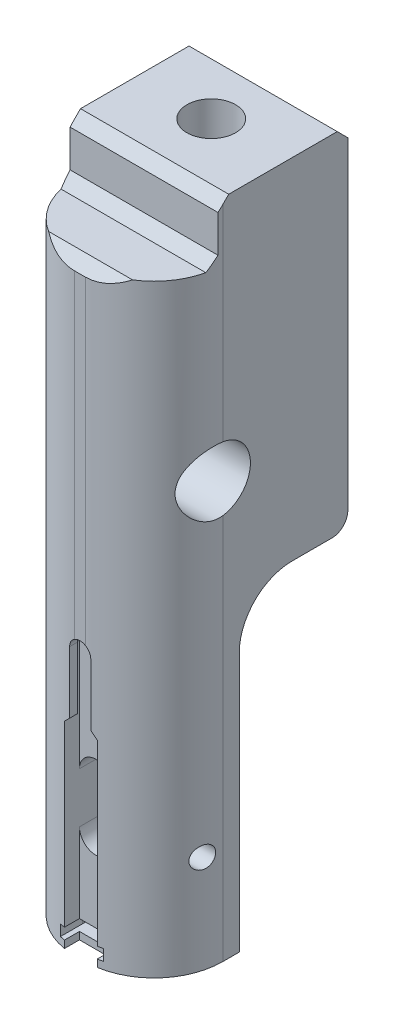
ISO-10303-21;
HEADER;
FILE_DESCRIPTION(('STEP AP214'),'2;1');
FILE_NAME('part.step','',(''),(''),'','','');
FILE_SCHEMA(('AUTOMOTIVE_DESIGN { 1 0 10303 214 1 1 1 1 }'));
ENDSEC;
DATA;
#1=APPLICATION_CONTEXT('core data for automotive mechanical design processes');
#2=APPLICATION_PROTOCOL_DEFINITION('international standard','automotive_design',2000,#1);
#3=PRODUCT_CONTEXT('',#1,'mechanical');
#4=PRODUCT('Part','Part','',(#3));
#5=PRODUCT_RELATED_PRODUCT_CATEGORY('part','',(#4));
#6=PRODUCT_DEFINITION_FORMATION('','',#4);
#7=PRODUCT_DEFINITION_CONTEXT('part definition',#1,'design');
#8=PRODUCT_DEFINITION('design','',#6,#7);
#9=PRODUCT_DEFINITION_SHAPE('','',#8);
#10=(LENGTH_UNIT() NAMED_UNIT(*) SI_UNIT(.MILLI.,.METRE.));
#11=(NAMED_UNIT(*) PLANE_ANGLE_UNIT() SI_UNIT($,.RADIAN.));
#12=(NAMED_UNIT(*) SI_UNIT($,.STERADIAN.) SOLID_ANGLE_UNIT());
#13=UNCERTAINTY_MEASURE_WITH_UNIT(LENGTH_MEASURE(1.E-05),#10,'distance_accuracy_value','');
#14=(GEOMETRIC_REPRESENTATION_CONTEXT(3) GLOBAL_UNCERTAINTY_ASSIGNED_CONTEXT((#13)) GLOBAL_UNIT_ASSIGNED_CONTEXT((#10,
#11,#12)) REPRESENTATION_CONTEXT('',''));
#15=CARTESIAN_POINT('',(0.,0.,0.));
#16=DIRECTION('',(0.,0.,1.));
#17=DIRECTION('',(1.,0.,0.));
#18=AXIS2_PLACEMENT_3D('',#15,#16,#17);
#19=CARTESIAN_POINT('',(12.,52.,35.1));
#20=DIRECTION('',(0.,1.,0.));
#21=DIRECTION('',(0.,0.,1.));
#22=AXIS2_PLACEMENT_3D('',#19,#20,#21);
#23=PLANE('',#22);
#24=DIRECTION('',(1.,0.,0.));
#25=VECTOR('',#24,1.);
#26=CARTESIAN_POINT('',(12.,52.,33.6));
#27=LINE('',#26,#25);
#28=CARTESIAN_POINT('',(14.1,52.,33.6));
#29=VERTEX_POINT('',#28);
#30=CARTESIAN_POINT('',(13.9,52.,33.6));
#31=VERTEX_POINT('',#30);
#32=EDGE_CURVE('E793',#29,#31,#27,.F.);
#33=ORIENTED_EDGE('',*,*,#32,.F.);
#34=DIRECTION('',(0.,0.,1.));
#35=VECTOR('',#34,1.);
#36=CARTESIAN_POINT('',(14.1,52.,34.35));
#37=LINE('',#36,#35);
#38=CARTESIAN_POINT('',(14.1,52.,35.1));
#39=VERTEX_POINT('',#38);
#40=EDGE_CURVE('E700',#39,#29,#37,.F.);
#41=ORIENTED_EDGE('',*,*,#40,.F.);
#42=DIRECTION('',(1.,0.,0.));
#43=VECTOR('',#42,1.);
#44=CARTESIAN_POINT('',(12.,52.,35.1));
#45=LINE('',#44,#43);
#46=CARTESIAN_POINT('',(14.,52.,35.1));
#47=VERTEX_POINT('',#46);
#48=EDGE_CURVE('E791',#47,#39,#45,.T.);
#49=ORIENTED_EDGE('',*,*,#48,.F.);
#50=DIRECTION('',(1.,0.,0.));
#51=VECTOR('',#50,1.);
#52=CARTESIAN_POINT('',(12.,52.,35.1));
#53=LINE('',#52,#51);
#54=CARTESIAN_POINT('',(13.9,52.,35.1));
#55=VERTEX_POINT('',#54);
#56=EDGE_CURVE('E794',#55,#47,#53,.T.);
#57=ORIENTED_EDGE('',*,*,#56,.F.);
#58=DIRECTION('',(0.,0.,-1.));
#59=VECTOR('',#58,1.);
#60=CARTESIAN_POINT('',(13.9,52.,35.1));
#61=LINE('',#60,#59);
#62=EDGE_CURVE('E706',#31,#55,#61,.F.);
#63=ORIENTED_EDGE('',*,*,#62,.F.);
#64=EDGE_LOOP('',(#33,#41,#49,#57,#63));
#65=FACE_BOUND('',#64,.T.);
#66=ADVANCED_FACE('F14',(#65),#23,.F.);
#67=CARTESIAN_POINT('',(23.,0.,5.));
#68=DIRECTION('',(0.,0.,1.));
#69=DIRECTION('',(1.,0.,0.));
#70=AXIS2_PLACEMENT_3D('',#67,#68,#69);
#71=PLANE('',#70);
#72=DIRECTION('',(0.,1.,0.));
#73=VECTOR('',#72,1.);
#74=CARTESIAN_POINT('',(10.,0.,5.));
#75=LINE('',#74,#73);
#76=CARTESIAN_POINT('',(10.,61.,5.));
#77=VERTEX_POINT('',#76);
#78=CARTESIAN_POINT('',(10.,110.5,5.));
#79=VERTEX_POINT('',#78);
#80=EDGE_CURVE('E556',#77,#79,#75,.T.);
#81=ORIENTED_EDGE('',*,*,#80,.T.);
#82=DIRECTION('',(1.,0.,0.));
#83=VECTOR('',#82,1.);
#84=CARTESIAN_POINT('',(23.,110.5,5.));
#85=LINE('',#84,#83);
#86=CARTESIAN_POINT('',(25.,110.5,5.));
#87=VERTEX_POINT('',#86);
#88=EDGE_CURVE('E555',#87,#79,#85,.F.);
#89=ORIENTED_EDGE('',*,*,#88,.F.);
#90=DIRECTION('',(0.,1.,0.));
#91=VECTOR('',#90,1.);
#92=CARTESIAN_POINT('',(25.,107.963845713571,5.));
#93=LINE('',#92,#91);
#94=CARTESIAN_POINT('',(25.,106.09756440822,5.));
#95=VERTEX_POINT('',#94);
#96=EDGE_CURVE('E748',#87,#95,#93,.F.);
#97=ORIENTED_EDGE('',*,*,#96,.T.);
#98=DIRECTION('',(1.,0.,0.));
#99=VECTOR('',#98,1.);
#100=CARTESIAN_POINT('',(23.,106.09756440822,5.00000000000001));
#101=LINE('',#100,#99);
#102=CARTESIAN_POINT('',(23.,106.09756440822,5.00000000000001));
#103=VERTEX_POINT('',#102);
#104=EDGE_CURVE('E578',#95,#103,#101,.F.);
#105=ORIENTED_EDGE('',*,*,#104,.T.);
#106=DIRECTION('',(0.,1.,0.));
#107=VECTOR('',#106,1.);
#108=CARTESIAN_POINT('',(23.,0.,5.00000000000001));
#109=LINE('',#108,#107);
#110=CARTESIAN_POINT('',(23.,61.,5.00000000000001));
#111=VERTEX_POINT('',#110);
#112=EDGE_CURVE('E596',#103,#111,#109,.F.);
#113=ORIENTED_EDGE('',*,*,#112,.T.);
#114=DIRECTION('',(1.,0.,0.));
#115=VECTOR('',#114,1.);
#116=CARTESIAN_POINT('',(12.5,61.,5.));
#117=LINE('',#116,#115);
#118=EDGE_CURVE('E616',#77,#111,#117,.T.);
#119=ORIENTED_EDGE('',*,*,#118,.F.);
#120=EDGE_LOOP('',(#81,#89,#97,#105,#113,#119));
#121=FACE_BOUND('',#120,.T.);
#122=ADVANCED_FACE('F1320',(#121),#71,.F.);
#123=CARTESIAN_POINT('',(18.6,63.,11.8));
#124=DIRECTION('',(0.,-1.,0.));
#125=DIRECTION('',(0.,0.,-1.));
#126=AXIS2_PLACEMENT_3D('',#123,#124,#125);
#127=PLANE('',#126);
#128=CARTESIAN_POINT('',(14.,63.,11.8));
#129=DIRECTION('',(0.,-1.,0.));
#130=DIRECTION('',(0.,0.,-1.));
#131=AXIS2_PLACEMENT_3D('',#128,#129,#130);
#132=CIRCLE('',#131,4.6);
#133=CARTESIAN_POINT('',(14.,63.,7.2));
#134=VERTEX_POINT('',#133);
#135=EDGE_CURVE('E532',#134,#134,#132,.F.);
#136=ORIENTED_EDGE('',*,*,#135,.T.);
#137=EDGE_LOOP('',(#136));
#138=FACE_BOUND('',#137,.T.);
#139=CARTESIAN_POINT('',(14.,63.,11.8));
#140=DIRECTION('',(0.,-1.,0.));
#141=DIRECTION('',(0.,0.,-1.));
#142=AXIS2_PLACEMENT_3D('',#139,#140,#141);
#143=CIRCLE('',#142,3.05);
#144=CARTESIAN_POINT('',(14.,63.,8.75));
#145=VERTEX_POINT('',#144);
#146=EDGE_CURVE('E703',#145,#145,#143,.T.);
#147=ORIENTED_EDGE('',*,*,#146,.T.);
#148=EDGE_LOOP('',(#147));
#149=FACE_BOUND('',#148,.T.);
#150=ADVANCED_FACE('F1318',(#138,#149),#127,.F.);
#151=CARTESIAN_POINT('',(14.,0.,18.3));
#152=DIRECTION('',(0.,1.,0.));
#153=DIRECTION('',(0.,0.,1.));
#154=AXIS2_PLACEMENT_3D('',#151,#152,#153);
#155=PLANE('',#154);
#156=DIRECTION('',(1.,0.,0.));
#157=VECTOR('',#156,1.);
#158=CARTESIAN_POINT('',(17.65,0.,14.7));
#159=LINE('',#158,#157);
#160=CARTESIAN_POINT('',(15.3,0.,14.7));
#161=VERTEX_POINT('',#160);
#162=CARTESIAN_POINT('',(17.65,0.,14.7));
#163=VERTEX_POINT('',#162);
#164=EDGE_CURVE('E686',#161,#163,#159,.T.);
#165=ORIENTED_EDGE('',*,*,#164,.T.);
#166=DIRECTION('',(0.,0.,1.));
#167=VECTOR('',#166,1.);
#168=CARTESIAN_POINT('',(17.65,0.,20.5));
#169=LINE('',#168,#167);
#170=CARTESIAN_POINT('',(17.65,2.8421709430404E-11,17.0502525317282));
#171=VERTEX_POINT('',#170);
#172=EDGE_CURVE('E450',#163,#171,#169,.T.);
#173=ORIENTED_EDGE('',*,*,#172,.T.);
#174=CARTESIAN_POINT('',(14.,5.6843418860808E-11,22.));
#175=DIRECTION('',(0.,-1.,0.));
#176=DIRECTION('',(0.,0.,-1.));
#177=AXIS2_PLACEMENT_3D('',#174,#175,#176);
#178=CIRCLE('',#177,6.14999999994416);
#179=CARTESIAN_POINT('',(15.3,3.41853117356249E-11,15.9889684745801));
#180=VERTEX_POINT('',#179);
#181=EDGE_CURVE('E17',#180,#171,#178,.T.);
#182=ORIENTED_EDGE('',*,*,#181,.F.);
#183=DIRECTION('',(0.,0.,-1.));
#184=VECTOR('',#183,1.);
#185=CARTESIAN_POINT('',(15.3,0.,14.7));
#186=LINE('',#185,#184);
#187=EDGE_CURVE('E370',#180,#161,#186,.T.);
#188=ORIENTED_EDGE('',*,*,#187,.T.);
#189=EDGE_LOOP('',(#165,#173,#182,#188));
#190=FACE_BOUND('',#189,.T.);
#191=ADVANCED_FACE('F1313',(#190),#155,.F.);
#192=CARTESIAN_POINT('',(14.,1.0000000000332,22.));
#193=DIRECTION('',(0.,-1.,0.));
#194=DIRECTION('',(0.,0.,-1.));
#195=AXIS2_PLACEMENT_3D('',#192,#193,#194);
#196=CONICAL_SURFACE('',#195,5.14999999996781,0.785398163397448);
#197=CARTESIAN_POINT('',(17.65,9.47067317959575E-12,17.0502525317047));
#198=CARTESIAN_POINT('',(17.65,0.0863958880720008,17.1576133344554));
#199=CARTESIAN_POINT('',(17.65,0.172207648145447,17.2654489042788));
#200=CARTESIAN_POINT('',(17.65,0.342386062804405,17.4822107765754));
#201=CARTESIAN_POINT('',(17.65,0.426753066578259,17.5911368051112));
#202=CARTESIAN_POINT('',(17.65,0.593813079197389,17.8102802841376));
#203=CARTESIAN_POINT('',(17.65,0.676505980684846,17.9204978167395));
#204=CARTESIAN_POINT('',(17.65,0.83986787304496,18.1424628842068));
#205=CARTESIAN_POINT('',(17.65,0.920536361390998,18.2542107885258));
#206=CARTESIAN_POINT('',(17.65,1.00000000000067,18.3668195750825));
#207=B_SPLINE_CURVE_WITH_KNOTS('',3,(#197,#198,#199,#200,#201,#202,#203,#204,#205,#206),
.UNSPECIFIED.,.F.,.F.,(4,2,2,2,4),(0.,0.413422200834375,0.826743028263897,1.24009027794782,
1.65353913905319),.UNSPECIFIED.);
#208=CARTESIAN_POINT('',(17.65,1.00000000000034,18.3668195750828));
#209=VERTEX_POINT('',#208);
#210=EDGE_CURVE('E449',#171,#209,#207,.T.);
#211=ORIENTED_EDGE('',*,*,#210,.T.);
#212=CARTESIAN_POINT('',(14.,1.,22.));
#213=DIRECTION('',(0.,1.,0.));
#214=DIRECTION('',(0.,0.,1.));
#215=AXIS2_PLACEMENT_3D('',#212,#213,#214);
#216=CIRCLE('',#215,5.15);
#217=CARTESIAN_POINT('',(15.3,1.0000000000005,17.0167781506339));
#218=VERTEX_POINT('',#217);
#219=EDGE_CURVE('E396',#209,#218,#216,.T.);
#220=ORIENTED_EDGE('',*,*,#219,.T.);
#221=CARTESIAN_POINT('',(15.3,1.00000000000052,17.0167781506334));
#222=CARTESIAN_POINT('',(15.3,0.916901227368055,16.930899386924));
#223=CARTESIAN_POINT('',(15.3,0.833732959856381,16.8450879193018));
#224=CARTESIAN_POINT('',(15.3,0.667274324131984,16.6735837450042));
#225=CARTESIAN_POINT('',(15.3,0.583983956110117,16.5878910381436));
#226=CARTESIAN_POINT('',(15.3,0.4172977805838,16.4166083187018));
#227=CARTESIAN_POINT('',(15.3,0.333901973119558,16.3310183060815));
#228=CARTESIAN_POINT('',(15.3,0.167017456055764,16.1599286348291));
#229=CARTESIAN_POINT('',(15.3,0.0835287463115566,16.074428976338));
#230=CARTESIAN_POINT('',(15.3,1.15276892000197E-11,15.9889684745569));
#231=B_SPLINE_CURVE_WITH_KNOTS('',3,(#221,#222,#223,#224,#225,#226,#227,#228,#229,#230),
.UNSPECIFIED.,.F.,.F.,(4,2,2,2,4),(0.,0.35850390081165,0.717007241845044,1.07551044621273,
1.43401420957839),.UNSPECIFIED.);
#232=EDGE_CURVE('E669',#218,#180,#231,.T.);
#233=ORIENTED_EDGE('',*,*,#232,.T.);
#234=ORIENTED_EDGE('',*,*,#181,.T.);
#235=EDGE_LOOP('',(#211,#220,#233,#234));
#236=FACE_BOUND('',#235,.T.);
#237=ADVANCED_FACE('F1307',(#236),#196,.F.);
#238=CARTESIAN_POINT('',(14.,-5.15000000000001,22.));
#239=DIRECTION('',(0.,1.,0.));
#240=DIRECTION('',(0.,0.,1.));
#241=AXIS2_PLACEMENT_3D('',#238,#239,#240);
#242=CYLINDRICAL_SURFACE('',#241,5.15);
#243=ORIENTED_EDGE('',*,*,#219,.F.);
#244=DIRECTION('',(0.,1.,0.));
#245=VECTOR('',#244,1.);
#246=CARTESIAN_POINT('',(17.65,0.,18.366819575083));
#247=LINE('',#246,#245);
#248=CARTESIAN_POINT('',(17.65,3.7,18.366819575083));
#249=VERTEX_POINT('',#248);
#250=EDGE_CURVE('E446',#209,#249,#247,.T.);
#251=ORIENTED_EDGE('',*,*,#250,.T.);
#252=CARTESIAN_POINT('',(14.,3.7,22.));
#253=DIRECTION('',(0.,1.,0.));
#254=DIRECTION('',(0.,0.,1.));
#255=AXIS2_PLACEMENT_3D('',#252,#253,#254);
#256=CIRCLE('',#255,5.15);
#257=CARTESIAN_POINT('',(15.3,3.7,17.0167781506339));
#258=VERTEX_POINT('',#257);
#259=EDGE_CURVE('E733',#249,#258,#256,.T.);
#260=ORIENTED_EDGE('',*,*,#259,.T.);
#261=DIRECTION('',(0.,1.,0.));
#262=VECTOR('',#261,1.);
#263=CARTESIAN_POINT('',(15.3,0.,17.0167781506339));
#264=LINE('',#263,#262);
#265=EDGE_CURVE('E672',#258,#218,#264,.F.);
#266=ORIENTED_EDGE('',*,*,#265,.T.);
#267=EDGE_LOOP('',(#243,#251,#260,#266));
#268=FACE_BOUND('',#267,.T.);
#269=ADVANCED_FACE('F1312',(#268),#242,.F.);
#270=CARTESIAN_POINT('',(19.15,3.7,22.));
#271=DIRECTION('',(0.,1.,0.));
#272=DIRECTION('',(0.,0.,1.));
#273=AXIS2_PLACEMENT_3D('',#270,#271,#272);
#274=PLANE('',#273);
#275=DIRECTION('',(1.,0.,0.));
#276=VECTOR('',#275,1.);
#277=CARTESIAN_POINT('',(15.3,3.7,18.7958334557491));
#278=LINE('',#277,#276);
#279=CARTESIAN_POINT('',(12.7,3.7,18.7958334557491));
#280=VERTEX_POINT('',#279);
#281=CARTESIAN_POINT('',(15.3,3.7,18.7958334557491));
#282=VERTEX_POINT('',#281);
#283=EDGE_CURVE('E648',#280,#282,#278,.T.);
#284=ORIENTED_EDGE('',*,*,#283,.T.);
#285=DIRECTION('',(0.,0.,-1.));
#286=VECTOR('',#285,1.);
#287=CARTESIAN_POINT('',(15.3,3.7,14.7));
#288=LINE('',#287,#286);
#289=EDGE_CURVE('E659',#282,#258,#288,.T.);
#290=ORIENTED_EDGE('',*,*,#289,.T.);
#291=ORIENTED_EDGE('',*,*,#259,.F.);
#292=DIRECTION('',(0.,0.,1.));
#293=VECTOR('',#292,1.);
#294=CARTESIAN_POINT('',(17.65,3.7,20.5));
#295=LINE('',#294,#293);
#296=CARTESIAN_POINT('',(17.65,3.7,20.5));
#297=VERTEX_POINT('',#296);
#298=EDGE_CURVE('E448',#249,#297,#295,.T.);
#299=ORIENTED_EDGE('',*,*,#298,.T.);
#300=DIRECTION('',(1.,0.,0.));
#301=VECTOR('',#300,1.);
#302=CARTESIAN_POINT('',(19.15,3.7,20.5));
#303=LINE('',#302,#301);
#304=CARTESIAN_POINT('',(18.9267129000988,3.7,20.5));
#305=VERTEX_POINT('',#304);
#306=EDGE_CURVE('E395',#305,#297,#303,.F.);
#307=ORIENTED_EDGE('',*,*,#306,.F.);
#308=CARTESIAN_POINT('',(14.,3.7,22.));
#309=DIRECTION('',(0.,1.,0.));
#310=DIRECTION('',(0.,0.,1.));
#311=AXIS2_PLACEMENT_3D('',#308,#309,#310);
#312=CIRCLE('',#311,5.15);
#313=CARTESIAN_POINT('',(9.07328709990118,3.7,20.5));
#314=VERTEX_POINT('',#313);
#315=EDGE_CURVE('E390',#305,#314,#312,.F.);
#316=ORIENTED_EDGE('',*,*,#315,.T.);
#317=DIRECTION('',(1.,0.,0.));
#318=VECTOR('',#317,1.);
#319=CARTESIAN_POINT('',(19.15,3.7,20.5));
#320=LINE('',#319,#318);
#321=CARTESIAN_POINT('',(10.35,3.7,20.5));
#322=VERTEX_POINT('',#321);
#323=EDGE_CURVE('E382',#322,#314,#320,.F.);
#324=ORIENTED_EDGE('',*,*,#323,.F.);
#325=DIRECTION('',(0.,0.,-1.));
#326=VECTOR('',#325,1.);
#327=CARTESIAN_POINT('',(10.35,3.7,0.));
#328=LINE('',#327,#326);
#329=CARTESIAN_POINT('',(10.35,3.7,18.366819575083));
#330=VERTEX_POINT('',#329);
#331=EDGE_CURVE('E387',#322,#330,#328,.T.);
#332=ORIENTED_EDGE('',*,*,#331,.T.);
#333=CARTESIAN_POINT('',(14.,3.7,22.));
#334=DIRECTION('',(0.,1.,0.));
#335=DIRECTION('',(0.,0.,1.));
#336=AXIS2_PLACEMENT_3D('',#333,#334,#335);
#337=CIRCLE('',#336,5.15);
#338=CARTESIAN_POINT('',(12.7,3.7,17.0167781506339));
#339=VERTEX_POINT('',#338);
#340=EDGE_CURVE('E731',#330,#339,#337,.F.);
#341=ORIENTED_EDGE('',*,*,#340,.T.);
#342=DIRECTION('',(0.,0.,1.));
#343=VECTOR('',#342,1.);
#344=CARTESIAN_POINT('',(12.7,3.7,18.7958334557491));
#345=LINE('',#344,#343);
#346=EDGE_CURVE('E638',#339,#280,#345,.T.);
#347=ORIENTED_EDGE('',*,*,#346,.T.);
#348=EDGE_LOOP('',(#284,#290,#291,#299,#307,#316,#324,#332,#341,#347));
#349=FACE_BOUND('',#348,.T.);
#350=CARTESIAN_POINT('',(14.,3.7,22.));
#351=DIRECTION('',(0.,1.,0.));
#352=DIRECTION('',(0.,0.,1.));
#353=AXIS2_PLACEMENT_3D('',#350,#351,#352);
#354=CIRCLE('',#353,2.05);
#355=CARTESIAN_POINT('',(14.,3.7,24.05));
#356=VERTEX_POINT('',#355);
#357=EDGE_CURVE('E1405',#356,#356,#354,.T.);
#358=ORIENTED_EDGE('',*,*,#357,.T.);
#359=EDGE_LOOP('',(#358));
#360=FACE_BOUND('',#359,.T.);
#361=ADVANCED_FACE('F385',(#349,#360),#274,.F.);
#362=CARTESIAN_POINT('',(14.,-5.15000000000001,22.));
#363=DIRECTION('',(0.,1.,0.));
#364=DIRECTION('',(0.,0.,1.));
#365=AXIS2_PLACEMENT_3D('',#362,#363,#364);
#366=CYLINDRICAL_SURFACE('',#365,5.15);
#367=ORIENTED_EDGE('',*,*,#340,.F.);
#368=DIRECTION('',(0.,1.,0.));
#369=VECTOR('',#368,1.);
#370=CARTESIAN_POINT('',(10.35,0.,18.366819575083));
#371=LINE('',#370,#369);
#372=CARTESIAN_POINT('',(10.35,0.99999999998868,18.3668195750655));
#373=VERTEX_POINT('',#372);
#374=EDGE_CURVE('E406',#330,#373,#371,.F.);
#375=ORIENTED_EDGE('',*,*,#374,.T.);
#376=CARTESIAN_POINT('',(14.,0.999999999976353,22.));
#377=DIRECTION('',(0.,-1.,0.));
#378=DIRECTION('',(1.,0.,0.));
#379=AXIS2_PLACEMENT_3D('',#376,#377,#378);
#380=CIRCLE('',#379,5.15000000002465);
#381=CARTESIAN_POINT('',(12.7,0.999999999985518,17.0167781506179));
#382=VERTEX_POINT('',#381);
#383=EDGE_CURVE('E727',#382,#373,#380,.F.);
#384=ORIENTED_EDGE('',*,*,#383,.F.);
#385=DIRECTION('',(0.,1.,0.));
#386=VECTOR('',#385,1.);
#387=CARTESIAN_POINT('',(12.7,0.,17.0167781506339));
#388=LINE('',#387,#386);
#389=EDGE_CURVE('E635',#382,#339,#388,.T.);
#390=ORIENTED_EDGE('',*,*,#389,.T.);
#391=EDGE_LOOP('',(#367,#375,#384,#390));
#392=FACE_BOUND('',#391,.T.);
#393=ADVANCED_FACE('F1267',(#392),#366,.F.);
#394=CARTESIAN_POINT('',(14.,1.0000000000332,22.));
#395=DIRECTION('',(0.,-1.,0.));
#396=DIRECTION('',(0.,0.,-1.));
#397=AXIS2_PLACEMENT_3D('',#394,#395,#396);
#398=CONICAL_SURFACE('',#397,5.14999999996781,0.785398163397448);
#399=CARTESIAN_POINT('',(10.35,0.999999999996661,18.3668195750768));
#400=CARTESIAN_POINT('',(10.35,0.92053636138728,18.2542107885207));
#401=CARTESIAN_POINT('',(10.35,0.83986787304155,18.1424628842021));
#402=CARTESIAN_POINT('',(10.35,0.676505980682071,17.9204978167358));
#403=CARTESIAN_POINT('',(10.35,0.593813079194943,17.8102802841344));
#404=CARTESIAN_POINT('',(10.35,0.426753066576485,17.5911368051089));
#405=CARTESIAN_POINT('',(10.35,0.342386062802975,17.4822107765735));
#406=CARTESIAN_POINT('',(10.35,0.172207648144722,17.2654489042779));
#407=CARTESIAN_POINT('',(10.35,0.0863958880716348,17.1576133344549));
#408=CARTESIAN_POINT('',(10.35,9.46983346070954E-12,17.0502525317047));
#409=B_SPLINE_CURVE_WITH_KNOTS('',3,(#399,#400,#401,#402,#403,#404,#405,#406,#407,#408),
.UNSPECIFIED.,.F.,.F.,(4,2,2,2,4),(0.,0.413448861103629,0.826796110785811,1.2401169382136,
1.65353913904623),.UNSPECIFIED.);
#410=CARTESIAN_POINT('',(10.35,3.31578170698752E-11,17.0502525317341));
#411=VERTEX_POINT('',#410);
#412=EDGE_CURVE('E432',#373,#411,#409,.T.);
#413=ORIENTED_EDGE('',*,*,#412,.T.);
#414=CARTESIAN_POINT('',(14.,5.6843418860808E-11,22.));
#415=DIRECTION('',(0.,-1.,0.));
#416=DIRECTION('',(0.,0.,-1.));
#417=AXIS2_PLACEMENT_3D('',#414,#415,#416);
#418=CIRCLE('',#417,6.14999999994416);
#419=CARTESIAN_POINT('',(12.7,2.8421709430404E-11,15.9889684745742));
#420=VERTEX_POINT('',#419);
#421=EDGE_CURVE('E730',#411,#420,#418,.T.);
#422=ORIENTED_EDGE('',*,*,#421,.T.);
#423=CARTESIAN_POINT('',(12.7,1.15269861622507E-11,15.9889684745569));
#424=CARTESIAN_POINT('',(12.7,0.0835287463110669,16.0744289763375));
#425=CARTESIAN_POINT('',(12.7,0.167017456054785,16.1599286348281));
#426=CARTESIAN_POINT('',(12.7,0.333901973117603,16.3310183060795));
#427=CARTESIAN_POINT('',(12.7,0.417297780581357,16.4166083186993));
#428=CARTESIAN_POINT('',(12.7,0.583983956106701,16.5878910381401));
#429=CARTESIAN_POINT('',(12.7,0.667274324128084,16.6735837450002));
#430=CARTESIAN_POINT('',(12.7,0.833732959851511,16.8450879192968));
#431=CARTESIAN_POINT('',(12.7,0.916901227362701,16.9308993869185));
#432=CARTESIAN_POINT('',(12.7,0.999999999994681,17.0167781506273));
#433=B_SPLINE_CURVE_WITH_KNOTS('',3,(#423,#424,#425,#426,#427,#428,#429,#430,#431,#432),
.UNSPECIFIED.,.F.,.F.,(4,2,2,2,4),(0.,0.358503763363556,0.717006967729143,1.07551030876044,
1.43401420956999),.UNSPECIFIED.);
#434=EDGE_CURVE('E639',#420,#382,#433,.T.);
#435=ORIENTED_EDGE('',*,*,#434,.T.);
#436=ORIENTED_EDGE('',*,*,#383,.T.);
#437=EDGE_LOOP('',(#413,#422,#435,#436));
#438=FACE_BOUND('',#437,.T.);
#439=ADVANCED_FACE('F1261',(#438),#398,.F.);
#440=CARTESIAN_POINT('',(14.,0.,18.3));
#441=DIRECTION('',(0.,1.,0.));
#442=DIRECTION('',(0.,0.,1.));
#443=AXIS2_PLACEMENT_3D('',#440,#441,#442);
#444=PLANE('',#443);
#445=ORIENTED_EDGE('',*,*,#421,.F.);
#446=DIRECTION('',(0.,0.,-1.));
#447=VECTOR('',#446,1.);
#448=CARTESIAN_POINT('',(10.35,0.,0.));
#449=LINE('',#448,#447);
#450=CARTESIAN_POINT('',(10.35,0.,14.7));
#451=VERTEX_POINT('',#450);
#452=EDGE_CURVE('E427',#411,#451,#449,.T.);
#453=ORIENTED_EDGE('',*,*,#452,.T.);
#454=DIRECTION('',(1.,0.,0.));
#455=VECTOR('',#454,1.);
#456=CARTESIAN_POINT('',(12.7,0.,14.7));
#457=LINE('',#456,#455);
#458=CARTESIAN_POINT('',(12.7,0.,14.7));
#459=VERTEX_POINT('',#458);
#460=EDGE_CURVE('E627',#451,#459,#457,.T.);
#461=ORIENTED_EDGE('',*,*,#460,.T.);
#462=DIRECTION('',(0.,0.,1.));
#463=VECTOR('',#462,1.);
#464=CARTESIAN_POINT('',(12.7,0.,18.7958334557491));
#465=LINE('',#464,#463);
#466=EDGE_CURVE('E640',#459,#420,#465,.T.);
#467=ORIENTED_EDGE('',*,*,#466,.T.);
#468=EDGE_LOOP('',(#445,#453,#461,#467));
#469=FACE_BOUND('',#468,.T.);
#470=ADVANCED_FACE('F1266',(#469),#444,.F.);
#471=CARTESIAN_POINT('',(16.05,24.7,22.));
#472=DIRECTION('',(0.,1.,0.));
#473=DIRECTION('',(0.,0.,1.));
#474=AXIS2_PLACEMENT_3D('',#471,#472,#473);
#475=PLANE('',#474);
#476=CARTESIAN_POINT('',(14.,24.7,22.));
#477=DIRECTION('',(0.,1.,0.));
#478=DIRECTION('',(0.,0.,1.));
#479=AXIS2_PLACEMENT_3D('',#476,#477,#478);
#480=CIRCLE('',#479,2.05);
#481=CARTESIAN_POINT('',(12.6026811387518,24.7,20.5));
#482=VERTEX_POINT('',#481);
#483=CARTESIAN_POINT('',(15.3973188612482,24.7,20.5));
#484=VERTEX_POINT('',#483);
#485=EDGE_CURVE('E709',#482,#484,#480,.F.);
#486=ORIENTED_EDGE('',*,*,#485,.T.);
#487=DIRECTION('',(1.,0.,0.));
#488=VECTOR('',#487,1.);
#489=CARTESIAN_POINT('',(15.,24.7,20.5));
#490=LINE('',#489,#488);
#491=EDGE_CURVE('E711',#482,#484,#490,.T.);
#492=ORIENTED_EDGE('',*,*,#491,.F.);
#493=EDGE_LOOP('',(#486,#492));
#494=FACE_BOUND('',#493,.T.);
#495=ADVANCED_FACE('F1615',(#494),#475,.F.);
#496=CARTESIAN_POINT('',(14.,1.65000000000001,22.));
#497=DIRECTION('',(0.,1.,0.));
#498=DIRECTION('',(0.,0.,1.));
#499=AXIS2_PLACEMENT_3D('',#496,#497,#498);
#500=CYLINDRICAL_SURFACE('',#499,2.05);
#501=DIRECTION('',(0.,1.,0.));
#502=VECTOR('',#501,1.);
#503=CARTESIAN_POINT('',(12.6026811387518,18.5,20.5));
#504=LINE('',#503,#502);
#505=CARTESIAN_POINT('',(12.6026811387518,15.7327811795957,20.5));
#506=VERTEX_POINT('',#505);
#507=EDGE_CURVE('E1046',#506,#482,#504,.T.);
#508=ORIENTED_EDGE('',*,*,#507,.F.);
#509=CARTESIAN_POINT('',(12.6026811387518,15.7327811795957,20.5));
#510=CARTESIAN_POINT('',(12.5600293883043,15.7543170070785,20.53974677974));
#511=CARTESIAN_POINT('',(12.5191793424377,15.7761844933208,20.5811853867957));
#512=CARTESIAN_POINT('',(12.4411570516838,15.8200718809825,20.6673704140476));
#513=CARTESIAN_POINT('',(12.4039871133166,15.8420918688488,20.7121188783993));
#514=CARTESIAN_POINT('',(12.2976172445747,15.9079236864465,20.8518844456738));
#515=CARTESIAN_POINT('',(12.2342488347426,15.9511430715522,20.9517778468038));
#516=CARTESIAN_POINT('',(12.134504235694,16.0235030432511,21.1444141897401));
#517=CARTESIAN_POINT('',(12.0953357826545,16.0537815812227,21.2352937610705));
#518=CARTESIAN_POINT('',(12.0301921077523,16.1059223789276,21.4236370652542));
#519=CARTESIAN_POINT('',(12.00415447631,16.1278243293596,21.5210671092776));
#520=CARTESIAN_POINT('',(11.9737153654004,16.1538537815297,21.6827352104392));
#521=CARTESIAN_POINT('',(11.964854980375,16.1615710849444,21.7455819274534));
#522=CARTESIAN_POINT('',(11.9529929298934,16.1719490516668,21.8722737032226));
#523=CARTESIAN_POINT('',(11.949993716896,16.1746075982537,21.9361191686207));
#524=CARTESIAN_POINT('',(11.9500098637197,16.1745798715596,22.1002852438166));
#525=CARTESIAN_POINT('',(11.9574268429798,16.1679842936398,22.2006576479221));
#526=CARTESIAN_POINT('',(11.9864898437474,16.1428592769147,22.3978307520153));
#527=CARTESIAN_POINT('',(12.0081645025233,16.1243058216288,22.4946238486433));
#528=CARTESIAN_POINT('',(12.0640535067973,16.0785565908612,22.6811862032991));
#529=CARTESIAN_POINT('',(12.0981473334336,16.0514441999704,22.7710132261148));
#530=CARTESIAN_POINT('',(12.1775620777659,15.9917766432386,22.9435303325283));
#531=CARTESIAN_POINT('',(12.22288511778,15.9592204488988,23.0262190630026));
#532=CARTESIAN_POINT('',(12.331518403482,15.8863689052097,23.195957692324));
#533=CARTESIAN_POINT('',(12.3965185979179,15.8456509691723,23.2817448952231));
#534=CARTESIAN_POINT('',(12.539229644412,15.7645103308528,23.4422890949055));
#535=CARTESIAN_POINT('',(12.616952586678,15.7240879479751,23.5170354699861));
#536=CARTESIAN_POINT('',(12.7961453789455,15.6413664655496,23.6638713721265));
#537=CARTESIAN_POINT('',(12.8994186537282,15.5996080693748,23.7340960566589));
#538=CARTESIAN_POINT('',(13.1196079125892,15.5253817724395,23.8555758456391));
#539=CARTESIAN_POINT('',(13.2365087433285,15.4929036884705,23.9068517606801));
#540=CARTESIAN_POINT('',(13.4669945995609,15.4441525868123,23.9827882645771));
#541=CARTESIAN_POINT('',(13.5795116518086,15.4264826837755,24.0097684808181));
#542=CARTESIAN_POINT('',(13.8086888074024,15.4037765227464,24.0443283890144));
#543=CARTESIAN_POINT('',(13.9253436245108,15.3987246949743,24.0519319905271));
#544=CARTESIAN_POINT('',(14.1405491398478,15.4016021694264,24.0475742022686));
#545=CARTESIAN_POINT('',(14.2391957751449,15.4077014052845,24.0383712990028));
#546=CARTESIAN_POINT('',(14.4331934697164,15.4288667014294,24.0061178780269));
#547=CARTESIAN_POINT('',(14.5285442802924,15.4439334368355,23.9830663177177));
#548=CARTESIAN_POINT('',(14.713286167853,15.4817059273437,23.9243442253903));
#549=CARTESIAN_POINT('',(14.8026944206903,15.504388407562,23.888712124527));
#550=CARTESIAN_POINT('',(14.9742682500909,15.5557122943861,23.8062037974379));
#551=CARTESIAN_POINT('',(15.0564324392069,15.5843548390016,23.7593254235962));
#552=CARTESIAN_POINT('',(15.2227172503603,15.6497457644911,23.6488452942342));
#553=CARTESIAN_POINT('',(15.3056912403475,15.6870642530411,23.5838588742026));
#554=CARTESIAN_POINT('',(15.4602737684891,15.7641126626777,23.4425974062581));
#555=CARTESIAN_POINT('',(15.5318650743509,15.8038461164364,23.3663055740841));
#556=CARTESIAN_POINT('',(15.6727931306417,15.8885842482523,23.1911193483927));
#557=CARTESIAN_POINT('',(15.7401351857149,15.9334727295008,23.090551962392));
#558=CARTESIAN_POINT('',(15.8569161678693,16.0166538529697,22.8769900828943));
#559=CARTESIAN_POINT('',(15.9063788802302,16.0549552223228,22.7640123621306));
#560=CARTESIAN_POINT('',(15.9739619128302,16.1094328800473,22.5604279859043));
#561=CARTESIAN_POINT('',(15.9969695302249,16.1287991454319,22.47230016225));
#562=CARTESIAN_POINT('',(16.0310875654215,16.1579476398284,22.2923935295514));
#563=CARTESIAN_POINT('',(16.0422401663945,16.1677638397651,22.2006288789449));
#564=CARTESIAN_POINT('',(16.0490460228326,16.1737571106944,22.0723137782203));
#565=CARTESIAN_POINT('',(16.0500017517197,16.1745994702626,22.0361616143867));
#566=CARTESIAN_POINT('',(16.0499975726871,16.1745931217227,21.9498917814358));
#567=CARTESIAN_POINT('',(16.0481566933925,16.1729669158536,21.8997654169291));
#568=CARTESIAN_POINT('',(16.0408338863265,16.1665442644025,21.7999746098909));
#569=CARTESIAN_POINT('',(16.0353495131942,16.1617456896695,21.7503105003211));
#570=CARTESIAN_POINT('',(16.0135385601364,16.1428713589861,21.6024103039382));
#571=CARTESIAN_POINT('',(15.991854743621,16.1243183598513,21.5054711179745));
#572=CARTESIAN_POINT('',(15.9359484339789,16.0785613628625,21.3187898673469));
#573=CARTESIAN_POINT('',(15.9018561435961,16.0514475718,21.2289844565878));
#574=CARTESIAN_POINT('',(15.8224359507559,15.9917744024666,21.0564752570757));
#575=CARTESIAN_POINT('',(15.7771057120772,15.9592138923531,20.9737729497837));
#576=CARTESIAN_POINT('',(15.6800646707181,15.8941371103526,20.8221349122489));
#577=CARTESIAN_POINT('',(15.6291091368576,15.8618087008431,20.75262987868));
#578=CARTESIAN_POINT('',(15.5191407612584,15.7969814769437,20.6208661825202));
#579=CARTESIAN_POINT('',(15.4601563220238,15.7644836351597,20.5585833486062));
#580=CARTESIAN_POINT('',(15.3973188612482,15.7327811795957,20.5));
#581=B_SPLINE_CURVE_WITH_KNOTS('',3,(#509,#510,#511,#512,#513,#514,#515,#516,#517,#518,#519,
#520,#521,#522,#523,#524,#525,#526,#527,#528,#529,#530,#531,#532,#533,#534,#535,#536,#537,#538,
#539,#540,#541,#542,#543,#544,#545,#546,#547,#548,#549,#550,#551,#552,#553,#554,#555,#556,#557,
#558,#559,#560,#561,#562,#563,#564,#565,#566,#567,#568,#569,#570,#571,#572,#573,#574,#575,#576,
#577,#578,#579,#580),.UNSPECIFIED.,.F.,.F.,(4,2,2,2,2,2,2,2,2,2,2,2,2,2,2,2,2,2,2,2,2,2,2,2,2,2,
2,2,2,2,2,2,2,2,2,4),(0.,0.186326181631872,0.372768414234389,0.748657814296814,1.05802223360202,
1.36590207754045,1.55727627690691,1.74873053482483,2.04929075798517,2.35045652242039,
2.64877433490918,2.94714857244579,3.29109268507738,3.6353655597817,4.02824171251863,
4.4206850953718,4.76964201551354,5.11816813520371,5.41451979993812,5.71089377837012,
6.00637011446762,6.30190292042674,6.63604322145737,6.97068465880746,7.35616312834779,
7.74112688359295,8.01938919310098,8.29665802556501,8.40511933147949,8.55541137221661,
8.7058043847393,9.00719477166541,9.30550976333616,9.60388682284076,9.87939611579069,
10.1539549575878),.UNSPECIFIED.);
#582=CARTESIAN_POINT('',(15.3973188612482,15.7327811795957,20.5));
#583=VERTEX_POINT('',#582);
#584=EDGE_CURVE('E1181',#506,#583,#581,.T.);
#585=ORIENTED_EDGE('',*,*,#584,.T.);
#586=DIRECTION('',(0.,1.,0.));
#587=VECTOR('',#586,1.);
#588=CARTESIAN_POINT('',(15.3973188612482,18.5,20.5));
#589=LINE('',#588,#587);
#590=EDGE_CURVE('E714',#484,#583,#589,.F.);
#591=ORIENTED_EDGE('',*,*,#590,.F.);
#592=ORIENTED_EDGE('',*,*,#485,.F.);
#593=EDGE_LOOP('',(#508,#585,#591,#592));
#594=FACE_BOUND('',#593,.T.);
#595=ORIENTED_EDGE('',*,*,#357,.F.);
#596=EDGE_LOOP('',(#595));
#597=FACE_BOUND('',#596,.T.);
#598=ADVANCED_FACE('F1608',(#594,#597),#500,.F.);
#599=CARTESIAN_POINT('',(13.9,49.,35.1));
#600=DIRECTION('',(0.,0.,-1.));
#601=DIRECTION('',(-1.,0.,0.));
#602=AXIS2_PLACEMENT_3D('',#599,#600,#601);
#603=CYLINDRICAL_SURFACE('',#602,3.);
#604=CARTESIAN_POINT('',(13.9,49.,35.1));
#605=DIRECTION('',(0.,0.,-1.));
#606=DIRECTION('',(-1.,0.,0.));
#607=AXIS2_PLACEMENT_3D('',#604,#605,#606);
#608=CIRCLE('',#607,3.);
#609=CARTESIAN_POINT('',(10.9,49.,35.1));
#610=VERTEX_POINT('',#609);
#611=EDGE_CURVE('E697',#55,#610,#608,.F.);
#612=ORIENTED_EDGE('',*,*,#611,.T.);
#613=DIRECTION('',(0.,0.,-1.));
#614=VECTOR('',#613,1.);
#615=CARTESIAN_POINT('',(10.9,49.,35.1));
#616=LINE('',#615,#614);
#617=CARTESIAN_POINT('',(10.9,49.,33.6));
#618=VERTEX_POINT('',#617);
#619=EDGE_CURVE('E704',#610,#618,#616,.T.);
#620=ORIENTED_EDGE('',*,*,#619,.T.);
#621=CARTESIAN_POINT('',(13.9,49.,33.6));
#622=DIRECTION('',(0.,0.,-1.));
#623=DIRECTION('',(-1.,0.,0.));
#624=AXIS2_PLACEMENT_3D('',#621,#622,#623);
#625=CIRCLE('',#624,3.);
#626=EDGE_CURVE('E1486',#618,#31,#625,.T.);
#627=ORIENTED_EDGE('',*,*,#626,.T.);
#628=ORIENTED_EDGE('',*,*,#62,.T.);
#629=EDGE_LOOP('',(#612,#620,#627,#628));
#630=FACE_BOUND('',#629,.T.);
#631=ADVANCED_FACE('F1601',(#630),#603,.F.);
#632=CARTESIAN_POINT('',(14.1,49.,33.6));
#633=DIRECTION('',(0.,0.,1.));
#634=DIRECTION('',(1.,0.,0.));
#635=AXIS2_PLACEMENT_3D('',#632,#633,#634);
#636=CYLINDRICAL_SURFACE('',#635,3.);
#637=CARTESIAN_POINT('',(14.1,49.,33.6));
#638=DIRECTION('',(0.,0.,1.));
#639=DIRECTION('',(1.,0.,0.));
#640=AXIS2_PLACEMENT_3D('',#637,#638,#639);
#641=CIRCLE('',#640,3.);
#642=CARTESIAN_POINT('',(17.1,49.,33.6));
#643=VERTEX_POINT('',#642);
#644=EDGE_CURVE('E1060',#29,#643,#641,.F.);
#645=ORIENTED_EDGE('',*,*,#644,.T.);
#646=DIRECTION('',(0.,0.,-1.));
#647=VECTOR('',#646,1.);
#648=CARTESIAN_POINT('',(17.1,49.,33.6));
#649=LINE('',#648,#647);
#650=CARTESIAN_POINT('',(17.1,49.,35.1));
#651=VERTEX_POINT('',#650);
#652=EDGE_CURVE('E522',#643,#651,#649,.F.);
#653=ORIENTED_EDGE('',*,*,#652,.T.);
#654=CARTESIAN_POINT('',(14.1,49.,35.1));
#655=DIRECTION('',(0.,0.,1.));
#656=DIRECTION('',(1.,0.,0.));
#657=AXIS2_PLACEMENT_3D('',#654,#655,#656);
#658=CIRCLE('',#657,3.);
#659=EDGE_CURVE('E1016',#651,#39,#658,.T.);
#660=ORIENTED_EDGE('',*,*,#659,.T.);
#661=ORIENTED_EDGE('',*,*,#40,.T.);
#662=EDGE_LOOP('',(#645,#653,#660,#661));
#663=FACE_BOUND('',#662,.T.);
#664=ADVANCED_FACE('F1415',(#663),#636,.F.);
#665=CARTESIAN_POINT('',(14.,128.05,11.8));
#666=DIRECTION('',(0.,-1.,0.));
#667=DIRECTION('',(0.,0.,-1.));
#668=AXIS2_PLACEMENT_3D('',#665,#666,#667);
#669=CYLINDRICAL_SURFACE('',#668,3.05);
#670=ORIENTED_EDGE('',*,*,#146,.F.);
#671=EDGE_LOOP('',(#670));
#672=FACE_BOUND('',#671,.T.);
#673=CARTESIAN_POINT('',(14.,59.,11.8));
#674=DIRECTION('',(0.,-1.,0.));
#675=DIRECTION('',(0.,0.,-1.));
#676=AXIS2_PLACEMENT_3D('',#673,#674,#675);
#677=CIRCLE('',#676,3.05);
#678=CARTESIAN_POINT('',(14.,59.,8.75));
#679=VERTEX_POINT('',#678);
#680=EDGE_CURVE('E481',#679,#679,#677,.F.);
#681=ORIENTED_EDGE('',*,*,#680,.F.);
#682=EDGE_LOOP('',(#681));
#683=FACE_BOUND('',#682,.T.);
#684=ADVANCED_FACE('F1412',(#672,#683),#669,.F.);
#685=CARTESIAN_POINT('',(17.65,0.,20.5));
#686=DIRECTION('',(1.,0.,0.));
#687=DIRECTION('',(0.,0.,-1.));
#688=AXIS2_PLACEMENT_3D('',#685,#686,#687);
#689=PLANE('',#688);
#690=DIRECTION('',(0.,0.,-1.));
#691=VECTOR('',#690,1.);
#692=CARTESIAN_POINT('',(17.65,59.,20.5));
#693=LINE('',#692,#691);
#694=CARTESIAN_POINT('',(17.65,59.,10.5));
#695=VERTEX_POINT('',#694);
#696=CARTESIAN_POINT('',(17.65,59.,14.7));
#697=VERTEX_POINT('',#696);
#698=EDGE_CURVE('E480',#695,#697,#693,.F.);
#699=ORIENTED_EDGE('',*,*,#698,.F.);
#700=CARTESIAN_POINT('',(17.65,49.,10.5));
#701=DIRECTION('',(-1.,0.,0.));
#702=DIRECTION('',(0.,0.,1.));
#703=AXIS2_PLACEMENT_3D('',#700,#701,#702);
#704=CIRCLE('',#703,10.);
#705=CARTESIAN_POINT('',(17.65,58.0752410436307,14.7));
#706=VERTEX_POINT('',#705);
#707=EDGE_CURVE('E469',#706,#695,#704,.T.);
#708=ORIENTED_EDGE('',*,*,#707,.F.);
#709=DIRECTION('',(0.,1.,0.));
#710=VECTOR('',#709,1.);
#711=CARTESIAN_POINT('',(17.65,0.,14.7));
#712=LINE('',#711,#710);
#713=EDGE_CURVE('E675',#706,#697,#712,.T.);
#714=ORIENTED_EDGE('',*,*,#713,.T.);
#715=EDGE_LOOP('',(#699,#708,#714));
#716=FACE_BOUND('',#715,.T.);
#717=ADVANCED_FACE('F1378',(#716),#689,.F.);
#718=CARTESIAN_POINT('',(17.65,0.,14.7));
#719=DIRECTION('',(0.,0.,1.));
#720=DIRECTION('',(1.,0.,0.));
#721=AXIS2_PLACEMENT_3D('',#718,#719,#720);
#722=PLANE('',#721);
#723=ORIENTED_EDGE('',*,*,#713,.F.);
#724=DIRECTION('',(0.,1.,0.));
#725=VECTOR('',#724,1.);
#726=CARTESIAN_POINT('',(17.65,0.,14.7));
#727=LINE('',#726,#725);
#728=EDGE_CURVE('E452',#706,#163,#727,.F.);
#729=ORIENTED_EDGE('',*,*,#728,.T.);
#730=ORIENTED_EDGE('',*,*,#164,.F.);
#731=DIRECTION('',(0.,1.,0.));
#732=VECTOR('',#731,1.);
#733=CARTESIAN_POINT('',(15.3,0.,14.7));
#734=LINE('',#733,#732);
#735=CARTESIAN_POINT('',(15.3,59.,14.7));
#736=VERTEX_POINT('',#735);
#737=EDGE_CURVE('E668',#161,#736,#734,.T.);
#738=ORIENTED_EDGE('',*,*,#737,.T.);
#739=DIRECTION('',(1.,0.,0.));
#740=VECTOR('',#739,1.);
#741=CARTESIAN_POINT('',(2.,59.,14.7));
#742=LINE('',#741,#740);
#743=EDGE_CURVE('E664',#697,#736,#742,.F.);
#744=ORIENTED_EDGE('',*,*,#743,.F.);
#745=EDGE_LOOP('',(#723,#729,#730,#738,#744));
#746=FACE_BOUND('',#745,.T.);
#747=ADVANCED_FACE('F1381',(#746),#722,.F.);
#748=CARTESIAN_POINT('',(15.3,0.,14.7));
#749=DIRECTION('',(1.,0.,0.));
#750=DIRECTION('',(0.,0.,-1.));
#751=AXIS2_PLACEMENT_3D('',#748,#749,#750);
#752=PLANE('',#751);
#753=DIRECTION('',(0.,1.,0.));
#754=VECTOR('',#753,1.);
#755=CARTESIAN_POINT('',(15.3,0.,18.7958334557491));
#756=LINE('',#755,#754);
#757=CARTESIAN_POINT('',(15.3,59.,18.7958334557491));
#758=VERTEX_POINT('',#757);
#759=EDGE_CURVE('E656',#282,#758,#756,.T.);
#760=ORIENTED_EDGE('',*,*,#759,.T.);
#761=DIRECTION('',(0.,0.,-1.));
#762=VECTOR('',#761,1.);
#763=CARTESIAN_POINT('',(15.3,59.,20.5));
#764=LINE('',#763,#762);
#765=EDGE_CURVE('E653',#736,#758,#764,.F.);
#766=ORIENTED_EDGE('',*,*,#765,.F.);
#767=ORIENTED_EDGE('',*,*,#737,.F.);
#768=ORIENTED_EDGE('',*,*,#187,.F.);
#769=ORIENTED_EDGE('',*,*,#232,.F.);
#770=ORIENTED_EDGE('',*,*,#265,.F.);
#771=ORIENTED_EDGE('',*,*,#289,.F.);
#772=EDGE_LOOP('',(#760,#766,#767,#768,#769,#770,#771));
#773=FACE_BOUND('',#772,.T.);
#774=ADVANCED_FACE('F1572',(#773),#752,.F.);
#775=CARTESIAN_POINT('',(15.3,0.,18.7958334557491));
#776=DIRECTION('',(0.,0.,1.));
#777=DIRECTION('',(1.,0.,0.));
#778=AXIS2_PLACEMENT_3D('',#775,#776,#777);
#779=PLANE('',#778);
#780=DIRECTION('',(0.,1.,0.));
#781=VECTOR('',#780,1.);
#782=CARTESIAN_POINT('',(12.7,0.,18.7958334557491));
#783=LINE('',#782,#781);
#784=CARTESIAN_POINT('',(12.7,59.,18.7958334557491));
#785=VERTEX_POINT('',#784);
#786=EDGE_CURVE('E643',#280,#785,#783,.T.);
#787=ORIENTED_EDGE('',*,*,#786,.T.);
#788=DIRECTION('',(1.,0.,0.));
#789=VECTOR('',#788,1.);
#790=CARTESIAN_POINT('',(2.,59.,18.7958334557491));
#791=LINE('',#790,#789);
#792=EDGE_CURVE('E632',#758,#785,#791,.F.);
#793=ORIENTED_EDGE('',*,*,#792,.F.);
#794=ORIENTED_EDGE('',*,*,#759,.F.);
#795=ORIENTED_EDGE('',*,*,#283,.F.);
#796=EDGE_LOOP('',(#787,#793,#794,#795));
#797=FACE_BOUND('',#796,.T.);
#798=ADVANCED_FACE('F1244',(#797),#779,.F.);
#799=CARTESIAN_POINT('',(12.7,0.,18.7958334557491));
#800=DIRECTION('',(-1.,0.,0.));
#801=DIRECTION('',(0.,0.,1.));
#802=AXIS2_PLACEMENT_3D('',#799,#800,#801);
#803=PLANE('',#802);
#804=ORIENTED_EDGE('',*,*,#389,.F.);
#805=ORIENTED_EDGE('',*,*,#434,.F.);
#806=ORIENTED_EDGE('',*,*,#466,.F.);
#807=DIRECTION('',(0.,1.,0.));
#808=VECTOR('',#807,1.);
#809=CARTESIAN_POINT('',(12.7,0.,14.7));
#810=LINE('',#809,#808);
#811=CARTESIAN_POINT('',(12.7,59.,14.7));
#812=VERTEX_POINT('',#811);
#813=EDGE_CURVE('E617',#459,#812,#810,.T.);
#814=ORIENTED_EDGE('',*,*,#813,.T.);
#815=DIRECTION('',(0.,0.,-1.));
#816=VECTOR('',#815,1.);
#817=CARTESIAN_POINT('',(12.7,59.,20.5));
#818=LINE('',#817,#816);
#819=EDGE_CURVE('E622',#785,#812,#818,.T.);
#820=ORIENTED_EDGE('',*,*,#819,.F.);
#821=ORIENTED_EDGE('',*,*,#786,.F.);
#822=ORIENTED_EDGE('',*,*,#346,.F.);
#823=EDGE_LOOP('',(#804,#805,#806,#814,#820,#821,#822));
#824=FACE_BOUND('',#823,.T.);
#825=ADVANCED_FACE('F1239',(#824),#803,.F.);
#826=CARTESIAN_POINT('',(12.7,0.,14.7));
#827=DIRECTION('',(0.,0.,1.));
#828=DIRECTION('',(1.,0.,0.));
#829=AXIS2_PLACEMENT_3D('',#826,#827,#828);
#830=PLANE('',#829);
#831=ORIENTED_EDGE('',*,*,#813,.F.);
#832=ORIENTED_EDGE('',*,*,#460,.F.);
#833=DIRECTION('',(0.,1.,0.));
#834=VECTOR('',#833,1.);
#835=CARTESIAN_POINT('',(10.35,0.,14.7));
#836=LINE('',#835,#834);
#837=CARTESIAN_POINT('',(10.35,58.0752410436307,14.7));
#838=VERTEX_POINT('',#837);
#839=EDGE_CURVE('E424',#451,#838,#836,.T.);
#840=ORIENTED_EDGE('',*,*,#839,.T.);
#841=DIRECTION('',(0.,1.,0.));
#842=VECTOR('',#841,1.);
#843=CARTESIAN_POINT('',(10.35,55.7677669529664,14.7));
#844=LINE('',#843,#842);
#845=CARTESIAN_POINT('',(10.35,59.,14.7));
#846=VERTEX_POINT('',#845);
#847=EDGE_CURVE('E613',#838,#846,#844,.T.);
#848=ORIENTED_EDGE('',*,*,#847,.T.);
#849=DIRECTION('',(1.,0.,0.));
#850=VECTOR('',#849,1.);
#851=CARTESIAN_POINT('',(2.,59.,14.7));
#852=LINE('',#851,#850);
#853=EDGE_CURVE('E610',#812,#846,#852,.F.);
#854=ORIENTED_EDGE('',*,*,#853,.F.);
#855=EDGE_LOOP('',(#831,#832,#840,#848,#854));
#856=FACE_BOUND('',#855,.T.);
#857=ADVANCED_FACE('F1235',(#856),#830,.F.);
#858=CARTESIAN_POINT('',(10.35,55.7677669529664,17.2677669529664));
#859=DIRECTION('',(-1.,0.,0.));
#860=DIRECTION('',(0.,0.,1.));
#861=AXIS2_PLACEMENT_3D('',#858,#859,#860);
#862=PLANE('',#861);
#863=CARTESIAN_POINT('',(10.35,49.,10.5));
#864=DIRECTION('',(-1.,0.,0.));
#865=DIRECTION('',(0.,0.,1.));
#866=AXIS2_PLACEMENT_3D('',#863,#864,#865);
#867=CIRCLE('',#866,10.);
#868=CARTESIAN_POINT('',(10.35,59.,10.5));
#869=VERTEX_POINT('',#868);
#870=EDGE_CURVE('E1421',#869,#838,#867,.F.);
#871=ORIENTED_EDGE('',*,*,#870,.F.);
#872=DIRECTION('',(0.,0.,-1.));
#873=VECTOR('',#872,1.);
#874=CARTESIAN_POINT('',(10.35,59.,20.5));
#875=LINE('',#874,#873);
#876=EDGE_CURVE('E607',#846,#869,#875,.T.);
#877=ORIENTED_EDGE('',*,*,#876,.F.);
#878=ORIENTED_EDGE('',*,*,#847,.F.);
#879=EDGE_LOOP('',(#871,#877,#878));
#880=FACE_BOUND('',#879,.T.);
#881=ADVANCED_FACE('F1231',(#880),#862,.F.);
#882=CARTESIAN_POINT('',(12.5,60.,6.));
#883=DIRECTION('',(0.,-0.707106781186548,-0.707106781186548));
#884=DIRECTION('',(0.,0.707106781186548,-0.707106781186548));
#885=AXIS2_PLACEMENT_3D('',#882,#883,#884);
#886=PLANE('',#885);
#887=DIRECTION('',(0.,0.707106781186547,-0.707106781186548));
#888=VECTOR('',#887,1.);
#889=CARTESIAN_POINT('',(10.,59.,7.));
#890=LINE('',#889,#888);
#891=CARTESIAN_POINT('',(10.,59.,7.));
#892=VERTEX_POINT('',#891);
#893=EDGE_CURVE('E595',#892,#77,#890,.T.);
#894=ORIENTED_EDGE('',*,*,#893,.T.);
#895=ORIENTED_EDGE('',*,*,#118,.T.);
#896=DIRECTION('',(0.,-0.707106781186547,0.707106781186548));
#897=VECTOR('',#896,1.);
#898=CARTESIAN_POINT('',(23.,61.,5.));
#899=LINE('',#898,#897);
#900=CARTESIAN_POINT('',(23.,59.,7.));
#901=VERTEX_POINT('',#900);
#902=EDGE_CURVE('E592',#111,#901,#899,.T.);
#903=ORIENTED_EDGE('',*,*,#902,.T.);
#904=DIRECTION('',(1.,0.,0.));
#905=VECTOR('',#904,1.);
#906=CARTESIAN_POINT('',(2.,59.,7.));
#907=LINE('',#906,#905);
#908=EDGE_CURVE('E584',#892,#901,#907,.T.);
#909=ORIENTED_EDGE('',*,*,#908,.F.);
#910=EDGE_LOOP('',(#894,#895,#903,#909));
#911=FACE_BOUND('',#910,.T.);
#912=ADVANCED_FACE('F1227',(#911),#886,.T.);
#913=CARTESIAN_POINT('',(23.,0.,0.));
#914=DIRECTION('',(1.,0.,0.));
#915=DIRECTION('',(0.,0.,-1.));
#916=AXIS2_PLACEMENT_3D('',#913,#914,#915);
#917=PLANE('',#916);
#918=DIRECTION('',(0.,1.,0.));
#919=VECTOR('',#918,1.);
#920=CARTESIAN_POINT('',(23.,62.5,0.));
#921=LINE('',#920,#919);
#922=CARTESIAN_POINT('',(23.,106.09756440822,0.));
#923=VERTEX_POINT('',#922);
#924=CARTESIAN_POINT('',(23.,62.,0.));
#925=VERTEX_POINT('',#924);
#926=EDGE_CURVE('E485',#923,#925,#921,.F.);
#927=ORIENTED_EDGE('',*,*,#926,.T.);
#928=CARTESIAN_POINT('',(23.,62.,3.));
#929=DIRECTION('',(-1.,0.,0.));
#930=DIRECTION('',(0.,0.,1.));
#931=AXIS2_PLACEMENT_3D('',#928,#929,#930);
#932=CIRCLE('',#931,3.);
#933=CARTESIAN_POINT('',(23.,59.,3.));
#934=VERTEX_POINT('',#933);
#935=EDGE_CURVE('E457',#934,#925,#932,.F.);
#936=ORIENTED_EDGE('',*,*,#935,.F.);
#937=DIRECTION('',(0.,0.,-1.));
#938=VECTOR('',#937,1.);
#939=CARTESIAN_POINT('',(23.,59.,20.5));
#940=LINE('',#939,#938);
#941=EDGE_CURVE('E476',#901,#934,#940,.T.);
#942=ORIENTED_EDGE('',*,*,#941,.F.);
#943=ORIENTED_EDGE('',*,*,#902,.F.);
#944=ORIENTED_EDGE('',*,*,#112,.F.);
#945=DIRECTION('',(0.,0.,-1.));
#946=VECTOR('',#945,1.);
#947=CARTESIAN_POINT('',(23.,106.09756440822,0.));
#948=LINE('',#947,#946);
#949=EDGE_CURVE('E574',#103,#923,#948,.T.);
#950=ORIENTED_EDGE('',*,*,#949,.T.);
#951=EDGE_LOOP('',(#927,#936,#942,#943,#944,#950));
#952=FACE_BOUND('',#951,.T.);
#953=ADVANCED_FACE('F1223',(#952),#917,.F.);
#954=CARTESIAN_POINT('',(10.,0.,5.));
#955=DIRECTION('',(-1.,0.,0.));
#956=DIRECTION('',(0.,0.,1.));
#957=AXIS2_PLACEMENT_3D('',#954,#955,#956);
#958=PLANE('',#957);
#959=ORIENTED_EDGE('',*,*,#80,.F.);
#960=ORIENTED_EDGE('',*,*,#893,.F.);
#961=DIRECTION('',(0.,0.,-1.));
#962=VECTOR('',#961,1.);
#963=CARTESIAN_POINT('',(10.,59.,20.5));
#964=LINE('',#963,#962);
#965=CARTESIAN_POINT('',(10.,59.,3.));
#966=VERTEX_POINT('',#965);
#967=EDGE_CURVE('E581',#966,#892,#964,.F.);
#968=ORIENTED_EDGE('',*,*,#967,.F.);
#969=CARTESIAN_POINT('',(10.,62.,3.));
#970=DIRECTION('',(-1.,0.,0.));
#971=DIRECTION('',(0.,0.,1.));
#972=AXIS2_PLACEMENT_3D('',#969,#970,#971);
#973=CIRCLE('',#972,3.);
#974=CARTESIAN_POINT('',(10.,62.,0.));
#975=VERTEX_POINT('',#974);
#976=EDGE_CURVE('E475',#975,#966,#973,.T.);
#977=ORIENTED_EDGE('',*,*,#976,.F.);
#978=DIRECTION('',(0.,1.,0.));
#979=VECTOR('',#978,1.);
#980=CARTESIAN_POINT('',(10.,62.5,0.));
#981=LINE('',#980,#979);
#982=CARTESIAN_POINT('',(10.,109.160254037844,0.));
#983=VERTEX_POINT('',#982);
#984=EDGE_CURVE('E546',#975,#983,#981,.T.);
#985=ORIENTED_EDGE('',*,*,#984,.T.);
#986=DIRECTION('',(0.,-0.25881904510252,-0.965925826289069));
#987=VECTOR('',#986,1.);
#988=CARTESIAN_POINT('',(10.,110.5,5.));
#989=LINE('',#988,#987);
#990=EDGE_CURVE('E552',#79,#983,#989,.T.);
#991=ORIENTED_EDGE('',*,*,#990,.F.);
#992=EDGE_LOOP('',(#959,#960,#968,#977,#985,#991));
#993=FACE_BOUND('',#992,.T.);
#994=ADVANCED_FACE('F1219',(#993),#958,.F.);
#995=CARTESIAN_POINT('',(23.,110.5,5.));
#996=DIRECTION('',(0.,-0.965925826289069,0.25881904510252));
#997=DIRECTION('',(0.,-0.25881904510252,-0.965925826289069));
#998=AXIS2_PLACEMENT_3D('',#995,#996,#997);
#999=PLANE('',#998);
#1000=DIRECTION('',(0.,0.25881904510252,0.965925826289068));
#1001=VECTOR('',#1000,1.);
#1002=CARTESIAN_POINT('',(25.,109.160254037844,0.));
#1003=LINE('',#1002,#1001);
#1004=CARTESIAN_POINT('',(25.,109.160254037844,0.));
#1005=VERTEX_POINT('',#1004);
#1006=EDGE_CURVE('E757',#1005,#87,#1003,.T.);
#1007=ORIENTED_EDGE('',*,*,#1006,.T.);
#1008=ORIENTED_EDGE('',*,*,#88,.T.);
#1009=ORIENTED_EDGE('',*,*,#990,.T.);
#1010=DIRECTION('',(1.,0.,0.));
#1011=VECTOR('',#1010,1.);
#1012=CARTESIAN_POINT('',(14.,109.160254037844,0.));
#1013=LINE('',#1012,#1011);
#1014=EDGE_CURVE('E549',#983,#1005,#1013,.T.);
#1015=ORIENTED_EDGE('',*,*,#1014,.T.);
#1016=EDGE_LOOP('',(#1007,#1008,#1009,#1015));
#1017=FACE_BOUND('',#1016,.T.);
#1018=ADVANCED_FACE('F1215',(#1017),#999,.T.);
#1019=CARTESIAN_POINT('',(25.,107.963845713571,2.50000000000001));
#1020=DIRECTION('',(1.,0.,0.));
#1021=DIRECTION('',(0.,1.,0.));
#1022=AXIS2_PLACEMENT_3D('',#1019,#1020,#1021);
#1023=PLANE('',#1022);
#1024=ORIENTED_EDGE('',*,*,#1006,.F.);
#1025=DIRECTION('',(0.,1.,0.));
#1026=VECTOR('',#1025,1.);
#1027=CARTESIAN_POINT('',(25.,62.5,0.));
#1028=LINE('',#1027,#1026);
#1029=CARTESIAN_POINT('',(25.,106.09756440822,0.));
#1030=VERTEX_POINT('',#1029);
#1031=EDGE_CURVE('E561',#1005,#1030,#1028,.F.);
#1032=ORIENTED_EDGE('',*,*,#1031,.T.);
#1033=DIRECTION('',(0.,0.,-1.));
#1034=VECTOR('',#1033,1.);
#1035=CARTESIAN_POINT('',(25.,106.09756440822,0.));
#1036=LINE('',#1035,#1034);
#1037=EDGE_CURVE('E577',#1030,#95,#1036,.F.);
#1038=ORIENTED_EDGE('',*,*,#1037,.T.);
#1039=ORIENTED_EDGE('',*,*,#96,.F.);
#1040=EDGE_LOOP('',(#1024,#1032,#1038,#1039));
#1041=FACE_BOUND('',#1040,.T.);
#1042=ADVANCED_FACE('F1211',(#1041),#1023,.F.);
#1043=CARTESIAN_POINT('',(23.,106.09756440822,0.));
#1044=DIRECTION('',(0.,-1.,0.));
#1045=DIRECTION('',(0.,0.,-1.));
#1046=AXIS2_PLACEMENT_3D('',#1043,#1044,#1045);
#1047=PLANE('',#1046);
#1048=DIRECTION('',(1.,0.,0.));
#1049=VECTOR('',#1048,1.);
#1050=CARTESIAN_POINT('',(14.,106.09756440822,0.));
#1051=LINE('',#1050,#1049);
#1052=EDGE_CURVE('E568',#1030,#923,#1051,.F.);
#1053=ORIENTED_EDGE('',*,*,#1052,.T.);
#1054=ORIENTED_EDGE('',*,*,#949,.F.);
#1055=ORIENTED_EDGE('',*,*,#104,.F.);
#1056=ORIENTED_EDGE('',*,*,#1037,.F.);
#1057=EDGE_LOOP('',(#1053,#1054,#1055,#1056));
#1058=FACE_BOUND('',#1057,.T.);
#1059=ADVANCED_FACE('F1207',(#1058),#1047,.F.);
#1060=CARTESIAN_POINT('',(14.,129.6,11.8));
#1061=DIRECTION('',(0.,-1.,0.));
#1062=DIRECTION('',(0.,0.,-1.));
#1063=AXIS2_PLACEMENT_3D('',#1060,#1061,#1062);
#1064=CYLINDRICAL_SURFACE('',#1063,4.6);
#1065=CARTESIAN_POINT('',(14.,125.,11.8));
#1066=DIRECTION('',(0.,-1.,0.));
#1067=DIRECTION('',(0.,0.,-1.));
#1068=AXIS2_PLACEMENT_3D('',#1065,#1066,#1067);
#1069=CIRCLE('',#1068,4.6);
#1070=CARTESIAN_POINT('',(14.,125.,7.2));
#1071=VERTEX_POINT('',#1070);
#1072=EDGE_CURVE('E502',#1071,#1071,#1069,.F.);
#1073=ORIENTED_EDGE('',*,*,#1072,.T.);
#1074=EDGE_LOOP('',(#1073));
#1075=FACE_BOUND('',#1074,.T.);
#1076=ORIENTED_EDGE('',*,*,#135,.F.);
#1077=EDGE_LOOP('',(#1076));
#1078=FACE_BOUND('',#1077,.T.);
#1079=ADVANCED_FACE('F1201',(#1075,#1078),#1064,.F.);
#1080=CARTESIAN_POINT('',(10.9,18.5,26.9032668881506));
#1081=DIRECTION('',(1.,0.,0.));
#1082=DIRECTION('',(0.,0.,-1.));
#1083=AXIS2_PLACEMENT_3D('',#1080,#1081,#1082);
#1084=CYLINDRICAL_SURFACE('',#1083,2.);
#1085=CARTESIAN_POINT('',(17.1,18.5,26.9032668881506));
#1086=DIRECTION('',(1.,0.,0.));
#1087=DIRECTION('',(0.,0.,-1.));
#1088=AXIS2_PLACEMENT_3D('',#1085,#1086,#1087);
#1089=CIRCLE('',#1088,2.);
#1090=CARTESIAN_POINT('',(17.1,18.5,28.9032668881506));
#1091=VERTEX_POINT('',#1090);
#1092=CARTESIAN_POINT('',(17.1,18.5,24.9032668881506));
#1093=VERTEX_POINT('',#1092);
#1094=EDGE_CURVE('E521',#1091,#1093,#1089,.F.);
#1095=ORIENTED_EDGE('',*,*,#1094,.T.);
#1096=CARTESIAN_POINT('',(17.1,18.5,24.9032668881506));
#1097=CARTESIAN_POINT('',(17.1000106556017,18.4492405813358,24.9032571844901));
#1098=CARTESIAN_POINT('',(17.0987536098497,18.3984884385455,24.9051989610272));
#1099=CARTESIAN_POINT('',(17.093784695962,18.2974238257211,24.9129102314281));
#1100=CARTESIAN_POINT('',(17.0900741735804,18.2471111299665,24.9186776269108));
#1101=CARTESIAN_POINT('',(17.0803076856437,18.1475891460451,24.9339198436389));
#1102=CARTESIAN_POINT('',(17.0742657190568,18.0983750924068,24.9433725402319));
#1103=CARTESIAN_POINT('',(17.0599874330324,18.0011037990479,24.9658465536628));
#1104=CARTESIAN_POINT('',(17.0517509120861,17.9530466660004,24.9788681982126));
#1105=CARTESIAN_POINT('',(17.0240501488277,17.8112694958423,25.022997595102));
#1106=CARTESIAN_POINT('',(17.0015661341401,17.7196679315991,25.0592131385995));
#1107=CARTESIAN_POINT('',(16.9503722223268,17.5441207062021,25.1437709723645));
#1108=CARTESIAN_POINT('',(16.9216544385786,17.4601849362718,25.192128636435));
#1109=CARTESIAN_POINT('',(16.8575547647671,17.294645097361,25.3039258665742));
#1110=CARTESIAN_POINT('',(16.8218198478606,17.2137938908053,25.3682757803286));
#1111=CARTESIAN_POINT('',(16.7482722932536,17.0633264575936,25.5080828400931));
#1112=CARTESIAN_POINT('',(16.7104572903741,16.9937233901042,25.5835528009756));
#1113=CARTESIAN_POINT('',(16.6303560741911,16.8573364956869,25.7563228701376));
#1114=CARTESIAN_POINT('',(16.5882223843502,16.7924453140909,25.8552014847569));
#1115=CARTESIAN_POINT('',(16.5106515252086,16.6803057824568,26.0649295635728));
#1116=CARTESIAN_POINT('',(16.4752070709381,16.6330381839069,26.1757657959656));
#1117=CARTESIAN_POINT('',(16.4220055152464,16.5646783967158,26.3885788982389));
#1118=CARTESIAN_POINT('',(16.4023145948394,16.5405886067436,26.4890879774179));
#1119=CARTESIAN_POINT('',(16.3756009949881,16.5082694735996,26.6941659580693));
#1120=CARTESIAN_POINT('',(16.368548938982,16.5000033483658,26.7987248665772));
#1121=CARTESIAN_POINT('',(16.3685390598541,16.4999968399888,27.0019281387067));
#1122=CARTESIAN_POINT('',(16.3748107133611,16.5073529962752,27.1005743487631));
#1123=CARTESIAN_POINT('',(16.3986883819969,16.5361704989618,27.294426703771));
#1124=CARTESIAN_POINT('',(16.4163112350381,16.5576528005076,27.3896275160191));
#1125=CARTESIAN_POINT('',(16.4598641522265,16.6131287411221,27.5732307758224));
#1126=CARTESIAN_POINT('',(16.485720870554,16.6470122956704,27.6616850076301));
#1127=CARTESIAN_POINT('',(16.542691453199,16.7259959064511,27.8315409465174));
#1128=CARTESIAN_POINT('',(16.573806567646,16.7710986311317,27.9129409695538));
#1129=CARTESIAN_POINT('',(16.6431794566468,16.8788076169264,28.0792388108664));
#1130=CARTESIAN_POINT('',(16.681820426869,16.9429994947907,28.1629508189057));
#1131=CARTESIAN_POINT('',(16.7587866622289,17.0838213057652,28.3194389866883));
#1132=CARTESIAN_POINT('',(16.7971115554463,17.160464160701,28.392203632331));
#1133=CARTESIAN_POINT('',(16.8751345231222,17.3363867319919,28.5343351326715));
#1134=CARTESIAN_POINT('',(16.9143413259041,17.4373203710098,28.6019733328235));
#1135=CARTESIAN_POINT('',(16.9664680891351,17.5981893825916,28.6894553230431));
#1136=CARTESIAN_POINT('',(16.9827232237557,17.653360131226,28.7162767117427));
#1137=CARTESIAN_POINT('',(17.0125475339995,17.7665358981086,28.7649368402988));
#1138=CARTESIAN_POINT('',(17.0261187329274,17.8245387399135,28.7867793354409));
#1139=CARTESIAN_POINT('',(17.0480463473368,17.9326310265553,28.8217918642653));
#1140=CARTESIAN_POINT('',(17.0568989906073,17.9823477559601,28.8358090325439));
#1141=CARTESIAN_POINT('',(17.0722549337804,18.0830549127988,28.8600084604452));
#1142=CARTESIAN_POINT('',(17.0787588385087,18.1340450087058,28.870191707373));
#1143=CARTESIAN_POINT('',(17.0892844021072,18.2372717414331,28.8866278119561));
#1144=CARTESIAN_POINT('',(17.0932887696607,18.2895145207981,28.8928532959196));
#1145=CARTESIAN_POINT('',(17.0986539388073,18.3945020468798,28.9011802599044));
#1146=CARTESIAN_POINT('',(17.1000126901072,18.4472471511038,28.9032785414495));
#1147=CARTESIAN_POINT('',(17.1,18.5,28.9032668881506));
#1148=B_SPLINE_CURVE_WITH_KNOTS('',3,(#1096,#1097,#1098,#1099,#1100,#1101,#1102,#1103,#1104,
#1105,#1106,#1107,#1108,#1109,#1110,#1111,#1112,#1113,#1114,#1115,#1116,#1117,#1118,#1119,#1120,
#1121,#1122,#1123,#1124,#1125,#1126,#1127,#1128,#1129,#1130,#1131,#1132,#1133,#1134,#1135,#1136,
#1137,#1138,#1139,#1140,#1141,#1142,#1143,#1144,#1145,#1146,#1147),.UNSPECIFIED.,.F.,.F.,(4,2,2,
2,2,2,2,2,2,2,2,2,2,2,2,2,2,2,2,2,2,2,2,2,2,4),(0.,0.152213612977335,0.304343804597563,
0.455574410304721,0.606818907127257,0.908476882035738,1.21051874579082,1.53727693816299,
1.8644146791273,2.23927744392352,2.61372957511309,2.92760052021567,3.24074098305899,
3.53626644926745,3.83223129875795,4.12563021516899,4.41909898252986,4.75485051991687,
5.09095275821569,5.4716029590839,5.66173548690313,5.85172413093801,6.00875482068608,
6.16574504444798,6.32380959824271,6.48199659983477),.UNSPECIFIED.);
#1149=EDGE_CURVE('E1039',#1093,#1091,#1148,.T.);
#1150=ORIENTED_EDGE('',*,*,#1149,.T.);
#1151=EDGE_LOOP('',(#1095,#1150));
#1152=FACE_BOUND('',#1151,.T.);
#1153=CARTESIAN_POINT('',(27.5733220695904,16.5,26.9032668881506));
#1154=CARTESIAN_POINT('',(27.5424822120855,16.5000045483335,27.020644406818));
#1155=CARTESIAN_POINT('',(27.5099673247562,16.5103632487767,27.1376558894));
#1156=CARTESIAN_POINT('',(27.442667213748,16.5511271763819,27.3675497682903));
#1157=CARTESIAN_POINT('',(27.4078792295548,16.5815572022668,27.4804268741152));
#1158=CARTESIAN_POINT('',(27.3374574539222,16.6613600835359,27.6988157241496));
#1159=CARTESIAN_POINT('',(27.3018247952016,16.7107087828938,27.8043366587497));
#1160=CARTESIAN_POINT('',(27.2312615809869,16.8270443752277,28.0054062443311));
#1161=CARTESIAN_POINT('',(27.19633093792,16.8940290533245,28.1009561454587));
#1162=CARTESIAN_POINT('',(27.1286077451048,17.0448804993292,28.2804031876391));
#1163=CARTESIAN_POINT('',(27.0958407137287,17.1289129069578,28.3641711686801));
#1164=CARTESIAN_POINT('',(27.0348604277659,17.3114725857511,28.516183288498));
#1165=CARTESIAN_POINT('',(27.0066463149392,17.4099971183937,28.5844303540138));
#1166=CARTESIAN_POINT('',(26.9579331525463,17.614361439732,28.7001587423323));
#1167=CARTESIAN_POINT('',(26.9371495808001,17.7196895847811,28.7484207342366));
#1168=CARTESIAN_POINT('',(26.9032899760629,17.9381958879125,28.826233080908));
#1169=CARTESIAN_POINT('',(26.8902086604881,18.0513686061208,28.8557962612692));
#1170=CARTESIAN_POINT('',(26.87360975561,18.2724501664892,28.893181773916));
#1171=CARTESIAN_POINT('',(26.8694041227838,18.3800442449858,28.9025693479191));
#1172=CARTESIAN_POINT('',(26.8688149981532,18.5953471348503,28.903888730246));
#1173=CARTESIAN_POINT('',(26.8724293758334,18.7030559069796,28.8958252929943));
#1174=CARTESIAN_POINT('',(26.8868562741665,18.9106089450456,28.8633577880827));
#1175=CARTESIAN_POINT('',(26.8973479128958,19.0105913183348,28.8396818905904));
#1176=CARTESIAN_POINT('',(26.9244660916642,19.2050077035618,28.7776679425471));
#1177=CARTESIAN_POINT('',(26.9410934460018,19.2994409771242,28.7393279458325));
#1178=CARTESIAN_POINT('',(26.9800627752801,19.4835639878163,28.6478349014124));
#1179=CARTESIAN_POINT('',(27.0025749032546,19.5729951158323,28.594235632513));
#1180=CARTESIAN_POINT('',(27.0516977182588,19.7417468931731,28.4745013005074));
#1181=CARTESIAN_POINT('',(27.0783093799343,19.8210651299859,28.4083632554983));
#1182=CARTESIAN_POINT('',(27.1364307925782,19.9737612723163,28.259814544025));
#1183=CARTESIAN_POINT('',(27.168159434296,20.0462221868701,28.1765466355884));
#1184=CARTESIAN_POINT('',(27.2332412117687,20.1763263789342,27.9996244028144));
#1185=CARTESIAN_POINT('',(27.2665956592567,20.2339574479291,27.9059616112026));
#1186=CARTESIAN_POINT('',(27.3355069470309,20.3361594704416,27.7045429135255));
#1187=CARTESIAN_POINT('',(27.3710737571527,20.3797164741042,27.5962754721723));
#1188=CARTESIAN_POINT('',(27.440805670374,20.447382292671,27.3735790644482));
#1189=CARTESIAN_POINT('',(27.4749736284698,20.4715328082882,27.2591638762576));
#1190=CARTESIAN_POINT('',(27.5190547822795,20.4903483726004,27.1035683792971));
#1191=CARTESIAN_POINT('',(27.5301528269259,20.4939606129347,27.063667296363));
#1192=CARTESIAN_POINT('',(27.5520045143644,20.4987873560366,26.9836229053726));
#1193=CARTESIAN_POINT('',(27.5627581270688,20.5000016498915,26.943479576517));
#1194=CARTESIAN_POINT('',(27.6025867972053,20.4999954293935,26.7918678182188));
#1195=CARTESIAN_POINT('',(27.6303959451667,20.4906593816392,26.6799364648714));
#1196=CARTESIAN_POINT('',(27.682403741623,20.4531109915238,26.4582595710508));
#1197=CARTESIAN_POINT('',(27.7065958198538,20.4248647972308,26.3485183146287));
#1198=CARTESIAN_POINT('',(27.7509911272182,20.3498608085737,26.1345931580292));
#1199=CARTESIAN_POINT('',(27.771192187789,20.303092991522,26.0304123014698));
#1200=CARTESIAN_POINT('',(27.8075242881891,20.1921481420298,25.8310535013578));
#1201=CARTESIAN_POINT('',(27.8236573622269,20.1279798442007,25.735871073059));
#1202=CARTESIAN_POINT('',(27.8517846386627,19.9855122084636,25.5594532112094));
#1203=CARTESIAN_POINT('',(27.8638597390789,19.9075432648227,25.4779637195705));
#1204=CARTESIAN_POINT('',(27.8847224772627,19.7387467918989,25.329045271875));
#1205=CARTESIAN_POINT('',(27.893509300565,19.6479160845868,25.2616198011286));
#1206=CARTESIAN_POINT('',(27.9081729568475,19.4570324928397,25.1435623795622));
#1207=CARTESIAN_POINT('',(27.9140787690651,19.3570839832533,25.0927649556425));
#1208=CARTESIAN_POINT('',(27.9235332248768,19.1500924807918,25.0085806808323));
#1209=CARTESIAN_POINT('',(27.9270845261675,19.0430576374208,24.9751742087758));
#1210=CARTESIAN_POINT('',(27.9312698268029,18.8628491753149,24.9351022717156));
#1211=CARTESIAN_POINT('',(27.9324885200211,18.7908135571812,24.9231801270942));
#1212=CARTESIAN_POINT('',(27.9341073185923,18.6458625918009,24.9072608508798));
#1213=CARTESIAN_POINT('',(27.9345074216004,18.572947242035,24.9032637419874));
#1214=CARTESIAN_POINT('',(27.9345087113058,18.388274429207,24.9032717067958));
#1215=CARTESIAN_POINT('',(27.933572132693,18.2764740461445,24.9126602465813));
#1216=CARTESIAN_POINT('',(27.9297297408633,18.0559562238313,24.9499730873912));
#1217=CARTESIAN_POINT('',(27.9268217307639,17.9472423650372,24.9779180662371));
#1218=CARTESIAN_POINT('',(27.9187633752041,17.7361094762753,25.0515219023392));
#1219=CARTESIAN_POINT('',(27.9136138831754,17.6336880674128,25.097174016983));
#1220=CARTESIAN_POINT('',(27.9006773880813,17.4380483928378,25.2048198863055));
#1221=CARTESIAN_POINT('',(27.8928911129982,17.3448275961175,25.2668091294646));
#1222=CARTESIAN_POINT('',(27.8742415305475,17.1702618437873,25.4052040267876));
#1223=CARTESIAN_POINT('',(27.8633807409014,17.0889072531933,25.4815978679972));
#1224=CARTESIAN_POINT('',(27.8381736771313,16.9402205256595,25.6465187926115));
#1225=CARTESIAN_POINT('',(27.8238267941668,16.8728908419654,25.7350479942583));
#1226=CARTESIAN_POINT('',(27.7913491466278,16.7539062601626,25.9217178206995));
#1227=CARTESIAN_POINT('',(27.7732101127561,16.702286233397,26.0198791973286));
#1228=CARTESIAN_POINT('',(27.7331226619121,16.6161577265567,26.2226388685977));
#1229=CARTESIAN_POINT('',(27.7111771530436,16.5816362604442,26.3272322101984));
#1230=CARTESIAN_POINT('',(27.6701966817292,16.5372852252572,26.51073970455));
#1231=CARTESIAN_POINT('',(27.6520038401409,16.5232868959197,26.5888651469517));
#1232=CARTESIAN_POINT('',(27.6138987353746,16.5046426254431,26.7458041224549));
#1233=CARTESIAN_POINT('',(27.5939864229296,16.4999969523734,26.8246176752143));
#1234=CARTESIAN_POINT('',(27.5733220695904,16.5,26.9032668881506));
#1235=B_SPLINE_CURVE_WITH_KNOTS('',3,(#1153,#1154,#1155,#1156,#1157,#1158,#1159,#1160,#1161,
#1162,#1163,#1164,#1165,#1166,#1167,#1168,#1169,#1170,#1171,#1172,#1173,#1174,#1175,#1176,#1177,
#1178,#1179,#1180,#1181,#1182,#1183,#1184,#1185,#1186,#1187,#1188,#1189,#1190,#1191,#1192,#1193,
#1194,#1195,#1196,#1197,#1198,#1199,#1200,#1201,#1202,#1203,#1204,#1205,#1206,#1207,#1208,#1209,
#1210,#1211,#1212,#1213,#1214,#1215,#1216,#1217,#1218,#1219,#1220,#1221,#1222,#1223,#1224,#1225,
#1226,#1227,#1228,#1229,#1230,#1231,#1232,#1233,#1234),.UNSPECIFIED.,.T.,.F.,(4,2,2,2,2,2,2,2,2,
2,2,2,2,2,2,2,2,2,2,2,2,2,2,2,2,2,2,2,2,2,2,2,2,2,2,2,2,2,2,2,4),(0.,0.363780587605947,
0.72801148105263,1.09177885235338,1.45550056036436,1.82294187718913,2.19031384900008,
2.54154378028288,2.89253253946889,3.21512853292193,3.53763664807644,3.84607602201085,
4.15455634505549,4.47319499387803,4.79190951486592,5.13497686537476,5.4783257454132,
5.8426673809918,6.2062240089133,6.33088932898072,6.45556550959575,6.80094929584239,
7.14695302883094,7.4931442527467,7.83916201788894,8.17780364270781,8.51652908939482,
8.85177329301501,9.18663843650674,9.40530631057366,9.62397481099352,9.9588862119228,
10.2941714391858,10.6293291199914,10.9643943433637,11.2991859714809,11.634036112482,
11.9696242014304,12.3049570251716,12.5487024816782,12.7924549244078),.UNSPECIFIED.);
#1236=CARTESIAN_POINT('',(27.5733220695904,16.5,26.9032668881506));
#1237=VERTEX_POINT('',#1236);
#1238=EDGE_CURVE('E535',#1237,#1237,#1235,.T.);
#1239=ORIENTED_EDGE('',*,*,#1238,.F.);
#1240=EDGE_LOOP('',(#1239));
#1241=FACE_BOUND('',#1240,.T.);
#1242=ADVANCED_FACE('F1195',(#1152,#1241),#1084,.F.);
#1243=CARTESIAN_POINT('',(16.,0.,35.1));
#1244=DIRECTION('',(1.,0.,0.));
#1245=DIRECTION('',(0.,0.,-1.));
#1246=AXIS2_PLACEMENT_3D('',#1243,#1244,#1245);
#1247=PLANE('',#1246);
#1248=DIRECTION('',(0.,1.,0.));
#1249=VECTOR('',#1248,1.);
#1250=CARTESIAN_POINT('',(16.,62.5,36.5614813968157));
#1251=LINE('',#1250,#1249);
#1252=CARTESIAN_POINT('',(16.,50.,36.5614813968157));
#1253=VERTEX_POINT('',#1252);
#1254=CARTESIAN_POINT('',(16.,38.3,36.5614813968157));
#1255=VERTEX_POINT('',#1254);
#1256=EDGE_CURVE('E977',#1253,#1255,#1251,.F.);
#1257=ORIENTED_EDGE('',*,*,#1256,.F.);
#1258=DIRECTION('',(0.,0.,-1.));
#1259=VECTOR('',#1258,1.);
#1260=CARTESIAN_POINT('',(16.,50.,35.1));
#1261=LINE('',#1260,#1259);
#1262=CARTESIAN_POINT('',(16.,50.,35.1));
#1263=VERTEX_POINT('',#1262);
#1264=EDGE_CURVE('E528',#1263,#1253,#1261,.F.);
#1265=ORIENTED_EDGE('',*,*,#1264,.F.);
#1266=DIRECTION('',(0.,1.,0.));
#1267=VECTOR('',#1266,1.);
#1268=CARTESIAN_POINT('',(16.,0.,35.1));
#1269=LINE('',#1268,#1267);
#1270=CARTESIAN_POINT('',(16.,38.3,35.1));
#1271=VERTEX_POINT('',#1270);
#1272=EDGE_CURVE('E1008',#1263,#1271,#1269,.F.);
#1273=ORIENTED_EDGE('',*,*,#1272,.T.);
#1274=DIRECTION('',(0.,0.,1.));
#1275=VECTOR('',#1274,1.);
#1276=CARTESIAN_POINT('',(16.,38.3,33.6));
#1277=LINE('',#1276,#1275);
#1278=EDGE_CURVE('E525',#1255,#1271,#1277,.F.);
#1279=ORIENTED_EDGE('',*,*,#1278,.F.);
#1280=EDGE_LOOP('',(#1257,#1265,#1273,#1279));
#1281=FACE_BOUND('',#1280,.T.);
#1282=ADVANCED_FACE('F1200',(#1281),#1247,.F.);
#1283=CARTESIAN_POINT('',(16.55,37.75,33.6));
#1284=DIRECTION('',(-0.707106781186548,-0.707106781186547,0.));
#1285=DIRECTION('',(0.707106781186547,-0.707106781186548,0.));
#1286=AXIS2_PLACEMENT_3D('',#1283,#1284,#1285);
#1287=PLANE('',#1286);
#1288=CARTESIAN_POINT('',(15.,39.3,23.6));
#1289=DIRECTION('',(-0.707106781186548,-0.707106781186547,0.));
#1290=DIRECTION('',(-0.707106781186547,0.707106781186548,0.));
#1291=AXIS2_PLACEMENT_3D('',#1288,#1289,#1290);
#1292=ELLIPSE('',#1291,18.3847763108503,13.);
#1293=CARTESIAN_POINT('',(17.1,37.2,36.4292634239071));
#1294=VERTEX_POINT('',#1293);
#1295=EDGE_CURVE('E976',#1255,#1294,#1292,.F.);
#1296=ORIENTED_EDGE('',*,*,#1295,.F.);
#1297=ORIENTED_EDGE('',*,*,#1278,.T.);
#1298=DIRECTION('',(0.707106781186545,-0.70710678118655,0.));
#1299=VECTOR('',#1298,1.);
#1300=CARTESIAN_POINT('',(16.,38.3,35.1));
#1301=LINE('',#1300,#1299);
#1302=CARTESIAN_POINT('',(17.1,37.2,35.1));
#1303=VERTEX_POINT('',#1302);
#1304=EDGE_CURVE('E693',#1271,#1303,#1301,.T.);
#1305=ORIENTED_EDGE('',*,*,#1304,.T.);
#1306=DIRECTION('',(0.,0.,-1.));
#1307=VECTOR('',#1306,1.);
#1308=CARTESIAN_POINT('',(17.1,37.2,33.6));
#1309=LINE('',#1308,#1307);
#1310=EDGE_CURVE('E519',#1303,#1294,#1309,.F.);
#1311=ORIENTED_EDGE('',*,*,#1310,.T.);
#1312=EDGE_LOOP('',(#1296,#1297,#1305,#1311));
#1313=FACE_BOUND('',#1312,.T.);
#1314=ADVANCED_FACE('F1459',(#1313),#1287,.T.);
#1315=CARTESIAN_POINT('',(17.1,0.,33.6));
#1316=DIRECTION('',(1.,0.,0.));
#1317=DIRECTION('',(0.,0.,-1.));
#1318=AXIS2_PLACEMENT_3D('',#1315,#1316,#1317);
#1319=PLANE('',#1318);
#1320=ORIENTED_EDGE('',*,*,#1094,.F.);
#1321=DIRECTION('',(0.,0.,-1.));
#1322=VECTOR('',#1321,1.);
#1323=CARTESIAN_POINT('',(17.1,18.5,33.6));
#1324=LINE('',#1323,#1322);
#1325=CARTESIAN_POINT('',(17.1,18.5,33.6));
#1326=VERTEX_POINT('',#1325);
#1327=EDGE_CURVE('E1036',#1091,#1326,#1324,.F.);
#1328=ORIENTED_EDGE('',*,*,#1327,.T.);
#1329=DIRECTION('',(0.,1.,0.));
#1330=VECTOR('',#1329,1.);
#1331=CARTESIAN_POINT('',(17.1,0.,33.6));
#1332=LINE('',#1331,#1330);
#1333=CARTESIAN_POINT('',(17.1,3.48693161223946,33.6));
#1334=VERTEX_POINT('',#1333);
#1335=EDGE_CURVE('E721',#1326,#1334,#1332,.F.);
#1336=ORIENTED_EDGE('',*,*,#1335,.T.);
#1337=DIRECTION('',(0.,0.,1.));
#1338=VECTOR('',#1337,1.);
#1339=CARTESIAN_POINT('',(17.1,3.48693161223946,36.4292634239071));
#1340=LINE('',#1339,#1338);
#1341=CARTESIAN_POINT('',(17.1,3.48693161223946,36.4292634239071));
#1342=VERTEX_POINT('',#1341);
#1343=EDGE_CURVE('E1064',#1334,#1342,#1340,.T.);
#1344=ORIENTED_EDGE('',*,*,#1343,.T.);
#1345=DIRECTION('',(0.,1.,0.));
#1346=VECTOR('',#1345,1.);
#1347=CARTESIAN_POINT('',(17.1,62.5,36.4292634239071));
#1348=LINE('',#1347,#1346);
#1349=EDGE_CURVE('E973',#1294,#1342,#1348,.F.);
#1350=ORIENTED_EDGE('',*,*,#1349,.F.);
#1351=ORIENTED_EDGE('',*,*,#1310,.F.);
#1352=DIRECTION('',(0.,1.,0.));
#1353=VECTOR('',#1352,1.);
#1354=CARTESIAN_POINT('',(17.1,0.,35.1));
#1355=LINE('',#1354,#1353);
#1356=EDGE_CURVE('E696',#1303,#651,#1355,.T.);
#1357=ORIENTED_EDGE('',*,*,#1356,.T.);
#1358=ORIENTED_EDGE('',*,*,#652,.F.);
#1359=DIRECTION('',(0.,1.,0.));
#1360=VECTOR('',#1359,1.);
#1361=CARTESIAN_POINT('',(17.1,0.,33.6));
#1362=LINE('',#1361,#1360);
#1363=CARTESIAN_POINT('',(17.1,28.,33.6));
#1364=VERTEX_POINT('',#1363);
#1365=EDGE_CURVE('E1058',#643,#1364,#1362,.F.);
#1366=ORIENTED_EDGE('',*,*,#1365,.T.);
#1367=DIRECTION('',(0.,0.,-1.));
#1368=VECTOR('',#1367,1.);
#1369=CARTESIAN_POINT('',(17.1,28.,33.6));
#1370=LINE('',#1369,#1368);
#1371=CARTESIAN_POINT('',(17.1,28.,20.5));
#1372=VERTEX_POINT('',#1371);
#1373=EDGE_CURVE('E715',#1364,#1372,#1370,.T.);
#1374=ORIENTED_EDGE('',*,*,#1373,.T.);
#1375=DIRECTION('',(0.,1.,0.));
#1376=VECTOR('',#1375,1.);
#1377=CARTESIAN_POINT('',(17.1,18.5,20.5));
#1378=LINE('',#1377,#1376);
#1379=CARTESIAN_POINT('',(17.1,18.5,20.5));
#1380=VERTEX_POINT('',#1379);
#1381=EDGE_CURVE('E1051',#1380,#1372,#1378,.T.);
#1382=ORIENTED_EDGE('',*,*,#1381,.F.);
#1383=DIRECTION('',(0.,0.,-1.));
#1384=VECTOR('',#1383,1.);
#1385=CARTESIAN_POINT('',(17.1,18.5,33.6));
#1386=LINE('',#1385,#1384);
#1387=EDGE_CURVE('E1040',#1380,#1093,#1386,.F.);
#1388=ORIENTED_EDGE('',*,*,#1387,.T.);
#1389=EDGE_LOOP('',(#1320,#1328,#1336,#1344,#1350,#1351,#1357,#1358,#1366,#1374,#1382,#1388));
#1390=FACE_BOUND('',#1389,.T.);
#1391=ADVANCED_FACE('F1472',(#1390),#1319,.F.);
#1392=CARTESIAN_POINT('',(18.05,1.38693161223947,36.4292634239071));
#1393=DIRECTION('',(1.,0.,0.));
#1394=DIRECTION('',(0.,0.,-1.));
#1395=AXIS2_PLACEMENT_3D('',#1392,#1393,#1394);
#1396=PLANE('',#1395);
#1397=DIRECTION('',(0.,0.,-1.));
#1398=VECTOR('',#1397,1.);
#1399=CARTESIAN_POINT('',(18.05,1.38693161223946,36.4292634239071));
#1400=LINE('',#1399,#1398);
#1401=CARTESIAN_POINT('',(18.05,1.38693161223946,32.0292634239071));
#1402=VERTEX_POINT('',#1401);
#1403=CARTESIAN_POINT('',(18.05,1.38693161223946,36.2371476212));
#1404=VERTEX_POINT('',#1403);
#1405=EDGE_CURVE('E426',#1402,#1404,#1400,.F.);
#1406=ORIENTED_EDGE('',*,*,#1405,.T.);
#1407=DIRECTION('',(0.,1.,0.));
#1408=VECTOR('',#1407,1.);
#1409=CARTESIAN_POINT('',(18.05,62.5,36.2371476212));
#1410=LINE('',#1409,#1408);
#1411=CARTESIAN_POINT('',(18.05,3.48693161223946,36.2371476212));
#1412=VERTEX_POINT('',#1411);
#1413=EDGE_CURVE('E515',#1412,#1404,#1410,.F.);
#1414=ORIENTED_EDGE('',*,*,#1413,.F.);
#1415=DIRECTION('',(0.,0.,1.));
#1416=VECTOR('',#1415,1.);
#1417=CARTESIAN_POINT('',(18.05,3.48693161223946,36.4292634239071));
#1418=LINE('',#1417,#1416);
#1419=CARTESIAN_POINT('',(18.05,3.48693161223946,32.0292634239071));
#1420=VERTEX_POINT('',#1419);
#1421=EDGE_CURVE('E1061',#1412,#1420,#1418,.F.);
#1422=ORIENTED_EDGE('',*,*,#1421,.T.);
#1423=DIRECTION('',(0.,-1.,0.));
#1424=VECTOR('',#1423,1.);
#1425=CARTESIAN_POINT('',(18.05,2.43693161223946,32.0292634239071));
#1426=LINE('',#1425,#1424);
#1427=EDGE_CURVE('E718',#1402,#1420,#1426,.F.);
#1428=ORIENTED_EDGE('',*,*,#1427,.F.);
#1429=EDGE_LOOP('',(#1406,#1414,#1422,#1428));
#1430=FACE_BOUND('',#1429,.T.);
#1431=ADVANCED_FACE('F1505',(#1430),#1396,.F.);
#1432=CARTESIAN_POINT('',(8.,62.,3.));
#1433=DIRECTION('',(-1.,0.,0.));
#1434=DIRECTION('',(0.,0.,1.));
#1435=AXIS2_PLACEMENT_3D('',#1432,#1433,#1434);
#1436=CYLINDRICAL_SURFACE('',#1435,3.);
#1437=ORIENTED_EDGE('',*,*,#935,.T.);
#1438=DIRECTION('',(1.,0.,0.));
#1439=VECTOR('',#1438,1.);
#1440=CARTESIAN_POINT('',(14.,62.,0.));
#1441=LINE('',#1440,#1439);
#1442=CARTESIAN_POINT('',(28.,62.,0.));
#1443=VERTEX_POINT('',#1442);
#1444=EDGE_CURVE('E482',#925,#1443,#1441,.T.);
#1445=ORIENTED_EDGE('',*,*,#1444,.T.);
#1446=CARTESIAN_POINT('',(28.,62.,3.));
#1447=DIRECTION('',(-1.,0.,0.));
#1448=DIRECTION('',(0.,0.,1.));
#1449=AXIS2_PLACEMENT_3D('',#1446,#1447,#1448);
#1450=CIRCLE('',#1449,3.);
#1451=CARTESIAN_POINT('',(28.,59.,3.));
#1452=VERTEX_POINT('',#1451);
#1453=EDGE_CURVE('E966',#1443,#1452,#1450,.T.);
#1454=ORIENTED_EDGE('',*,*,#1453,.T.);
#1455=DIRECTION('',(1.,0.,0.));
#1456=VECTOR('',#1455,1.);
#1457=CARTESIAN_POINT('',(2.,59.,3.));
#1458=LINE('',#1457,#1456);
#1459=EDGE_CURVE('E472',#934,#1452,#1458,.T.);
#1460=ORIENTED_EDGE('',*,*,#1459,.F.);
#1461=EDGE_LOOP('',(#1437,#1445,#1454,#1460));
#1462=FACE_BOUND('',#1461,.T.);
#1463=ADVANCED_FACE('F1298',(#1462),#1436,.T.);
#1464=CARTESIAN_POINT('',(17.65,0.,20.5));
#1465=DIRECTION('',(-1.,0.,0.));
#1466=DIRECTION('',(0.,0.,1.));
#1467=AXIS2_PLACEMENT_3D('',#1464,#1465,#1466);
#1468=PLANE('',#1467);
#1469=DIRECTION('',(0.,1.,0.));
#1470=VECTOR('',#1469,1.);
#1471=CARTESIAN_POINT('',(17.65,0.,20.5));
#1472=LINE('',#1471,#1470);
#1473=CARTESIAN_POINT('',(17.65,49.,20.5));
#1474=VERTEX_POINT('',#1473);
#1475=EDGE_CURVE('E460',#1474,#297,#1472,.F.);
#1476=ORIENTED_EDGE('',*,*,#1475,.T.);
#1477=ORIENTED_EDGE('',*,*,#298,.F.);
#1478=ORIENTED_EDGE('',*,*,#250,.F.);
#1479=ORIENTED_EDGE('',*,*,#210,.F.);
#1480=ORIENTED_EDGE('',*,*,#172,.F.);
#1481=ORIENTED_EDGE('',*,*,#728,.F.);
#1482=CARTESIAN_POINT('',(17.65,49.,10.5));
#1483=DIRECTION('',(-1.,0.,0.));
#1484=DIRECTION('',(0.,0.,1.));
#1485=AXIS2_PLACEMENT_3D('',#1482,#1483,#1484);
#1486=CIRCLE('',#1485,10.);
#1487=EDGE_CURVE('E1390',#1474,#706,#1486,.T.);
#1488=ORIENTED_EDGE('',*,*,#1487,.F.);
#1489=EDGE_LOOP('',(#1476,#1477,#1478,#1479,#1480,#1481,#1488));
#1490=FACE_BOUND('',#1489,.T.);
#1491=ADVANCED_FACE('F1293',(#1490),#1468,.F.);
#1492=CARTESIAN_POINT('',(28.,49.,10.5));
#1493=DIRECTION('',(-1.,0.,0.));
#1494=DIRECTION('',(0.,0.,1.));
#1495=AXIS2_PLACEMENT_3D('',#1492,#1493,#1494);
#1496=CYLINDRICAL_SURFACE('',#1495,10.);
#1497=DIRECTION('',(1.,0.,0.));
#1498=VECTOR('',#1497,1.);
#1499=CARTESIAN_POINT('',(28.,49.,20.5));
#1500=LINE('',#1499,#1498);
#1501=CARTESIAN_POINT('',(28.,49.,20.5));
#1502=VERTEX_POINT('',#1501);
#1503=EDGE_CURVE('E442',#1502,#1474,#1500,.F.);
#1504=ORIENTED_EDGE('',*,*,#1503,.T.);
#1505=ORIENTED_EDGE('',*,*,#1487,.T.);
#1506=ORIENTED_EDGE('',*,*,#707,.T.);
#1507=DIRECTION('',(1.,0.,0.));
#1508=VECTOR('',#1507,1.);
#1509=CARTESIAN_POINT('',(2.,59.,10.5));
#1510=LINE('',#1509,#1508);
#1511=CARTESIAN_POINT('',(28.,59.,10.5));
#1512=VERTEX_POINT('',#1511);
#1513=EDGE_CURVE('E477',#1512,#695,#1510,.F.);
#1514=ORIENTED_EDGE('',*,*,#1513,.F.);
#1515=CARTESIAN_POINT('',(28.,49.,10.5));
#1516=DIRECTION('',(-1.,0.,0.));
#1517=DIRECTION('',(0.,0.,1.));
#1518=AXIS2_PLACEMENT_3D('',#1515,#1516,#1517);
#1519=CIRCLE('',#1518,10.);
#1520=EDGE_CURVE('E962',#1512,#1502,#1519,.F.);
#1521=ORIENTED_EDGE('',*,*,#1520,.T.);
#1522=EDGE_LOOP('',(#1504,#1505,#1506,#1514,#1521));
#1523=FACE_BOUND('',#1522,.T.);
#1524=ADVANCED_FACE('F1289',(#1523),#1496,.F.);
#1525=CARTESIAN_POINT('',(14.,-5.15000000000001,22.));
#1526=DIRECTION('',(0.,1.,0.));
#1527=DIRECTION('',(0.,0.,1.));
#1528=AXIS2_PLACEMENT_3D('',#1525,#1526,#1527);
#1529=CYLINDRICAL_SURFACE('',#1528,5.15);
#1530=DIRECTION('',(0.,1.,0.));
#1531=VECTOR('',#1530,1.);
#1532=CARTESIAN_POINT('',(9.07328709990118,0.,20.5));
#1533=LINE('',#1532,#1531);
#1534=CARTESIAN_POINT('',(9.07328709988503,0.999999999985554,20.5));
#1535=VERTEX_POINT('',#1534);
#1536=EDGE_CURVE('E412',#1535,#314,#1533,.T.);
#1537=ORIENTED_EDGE('',*,*,#1536,.T.);
#1538=ORIENTED_EDGE('',*,*,#315,.F.);
#1539=DIRECTION('',(0.,1.,0.));
#1540=VECTOR('',#1539,1.);
#1541=CARTESIAN_POINT('',(18.9267129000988,0.,20.5));
#1542=LINE('',#1541,#1540);
#1543=CARTESIAN_POINT('',(18.9267129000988,0.999999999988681,20.5));
#1544=VERTEX_POINT('',#1543);
#1545=EDGE_CURVE('E463',#305,#1544,#1542,.F.);
#1546=ORIENTED_EDGE('',*,*,#1545,.T.);
#1547=CARTESIAN_POINT('',(14.,0.999999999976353,22.));
#1548=DIRECTION('',(0.,-1.,0.));
#1549=DIRECTION('',(1.,0.,0.));
#1550=AXIS2_PLACEMENT_3D('',#1547,#1548,#1549);
#1551=CIRCLE('',#1550,5.15000000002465);
#1552=EDGE_CURVE('E438',#1535,#1544,#1551,.F.);
#1553=ORIENTED_EDGE('',*,*,#1552,.F.);
#1554=EDGE_LOOP('',(#1537,#1538,#1546,#1553));
#1555=FACE_BOUND('',#1554,.T.);
#1556=ADVANCED_FACE('F1285',(#1555),#1529,.F.);
#1557=CARTESIAN_POINT('',(10.35,0.,0.));
#1558=DIRECTION('',(1.,0.,0.));
#1559=DIRECTION('',(0.,0.,-1.));
#1560=AXIS2_PLACEMENT_3D('',#1557,#1558,#1559);
#1561=PLANE('',#1560);
#1562=ORIENTED_EDGE('',*,*,#839,.F.);
#1563=ORIENTED_EDGE('',*,*,#452,.F.);
#1564=ORIENTED_EDGE('',*,*,#412,.F.);
#1565=ORIENTED_EDGE('',*,*,#374,.F.);
#1566=ORIENTED_EDGE('',*,*,#331,.F.);
#1567=DIRECTION('',(0.,1.,0.));
#1568=VECTOR('',#1567,1.);
#1569=CARTESIAN_POINT('',(10.35,0.,20.5));
#1570=LINE('',#1569,#1568);
#1571=CARTESIAN_POINT('',(10.35,49.,20.5));
#1572=VERTEX_POINT('',#1571);
#1573=EDGE_CURVE('E403',#322,#1572,#1570,.T.);
#1574=ORIENTED_EDGE('',*,*,#1573,.T.);
#1575=CARTESIAN_POINT('',(10.35,49.,10.5));
#1576=DIRECTION('',(-1.,0.,0.));
#1577=DIRECTION('',(0.,0.,1.));
#1578=AXIS2_PLACEMENT_3D('',#1575,#1576,#1577);
#1579=CIRCLE('',#1578,10.);
#1580=EDGE_CURVE('E1419',#838,#1572,#1579,.F.);
#1581=ORIENTED_EDGE('',*,*,#1580,.F.);
#1582=EDGE_LOOP('',(#1562,#1563,#1564,#1565,#1566,#1574,#1581));
#1583=FACE_BOUND('',#1582,.T.);
#1584=ADVANCED_FACE('F401',(#1583),#1561,.F.);
#1585=CARTESIAN_POINT('',(9.94999999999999,1.38693161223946,36.4292634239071));
#1586=DIRECTION('',(0.,-1.,0.));
#1587=DIRECTION('',(0.,0.,-1.));
#1588=AXIS2_PLACEMENT_3D('',#1585,#1586,#1587);
#1589=PLANE('',#1588);
#1590=DIRECTION('',(0.,0.,1.));
#1591=VECTOR('',#1590,1.);
#1592=CARTESIAN_POINT('',(9.94999999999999,1.38693161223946,36.4292634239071));
#1593=LINE('',#1592,#1591);
#1594=CARTESIAN_POINT('',(9.94999999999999,1.38693161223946,32.0292634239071));
#1595=VERTEX_POINT('',#1594);
#1596=CARTESIAN_POINT('',(9.94999999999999,1.38693161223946,36.2371476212));
#1597=VERTEX_POINT('',#1596);
#1598=EDGE_CURVE('E1085',#1595,#1597,#1593,.T.);
#1599=ORIENTED_EDGE('',*,*,#1598,.T.);
#1600=CARTESIAN_POINT('',(13.,1.38693161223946,23.6));
#1601=DIRECTION('',(0.,-1.,0.));
#1602=DIRECTION('',(0.,0.,-1.));
#1603=AXIS2_PLACEMENT_3D('',#1600,#1601,#1602);
#1604=CIRCLE('',#1603,13.);
#1605=CARTESIAN_POINT('',(10.9,1.38693161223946,36.4292634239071));
#1606=VERTEX_POINT('',#1605);
#1607=EDGE_CURVE('E1093',#1606,#1597,#1604,.T.);
#1608=ORIENTED_EDGE('',*,*,#1607,.F.);
#1609=DIRECTION('',(0.,0.,1.));
#1610=VECTOR('',#1609,1.);
#1611=CARTESIAN_POINT('',(10.9,1.38693161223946,35.1));
#1612=LINE('',#1611,#1610);
#1613=CARTESIAN_POINT('',(10.9,1.38693161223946,33.6));
#1614=VERTEX_POINT('',#1613);
#1615=EDGE_CURVE('E943',#1606,#1614,#1612,.F.);
#1616=ORIENTED_EDGE('',*,*,#1615,.T.);
#1617=DIRECTION('',(-1.,0.,0.));
#1618=VECTOR('',#1617,1.);
#1619=CARTESIAN_POINT('',(10.9,1.38693161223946,33.6));
#1620=LINE('',#1619,#1618);
#1621=CARTESIAN_POINT('',(17.1,1.38693161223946,33.6));
#1622=VERTEX_POINT('',#1621);
#1623=EDGE_CURVE('E507',#1614,#1622,#1620,.F.);
#1624=ORIENTED_EDGE('',*,*,#1623,.T.);
#1625=DIRECTION('',(0.,0.,-1.));
#1626=VECTOR('',#1625,1.);
#1627=CARTESIAN_POINT('',(17.1,1.38693161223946,33.6));
#1628=LINE('',#1627,#1626);
#1629=CARTESIAN_POINT('',(17.1,1.38693161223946,36.4292634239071));
#1630=VERTEX_POINT('',#1629);
#1631=EDGE_CURVE('E533',#1622,#1630,#1628,.F.);
#1632=ORIENTED_EDGE('',*,*,#1631,.T.);
#1633=CARTESIAN_POINT('',(15.,1.38693161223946,23.6));
#1634=DIRECTION('',(0.,1.,0.));
#1635=DIRECTION('',(0.,0.,1.));
#1636=AXIS2_PLACEMENT_3D('',#1633,#1634,#1635);
#1637=CIRCLE('',#1636,13.);
#1638=EDGE_CURVE('E984',#1404,#1630,#1637,.F.);
#1639=ORIENTED_EDGE('',*,*,#1638,.F.);
#1640=ORIENTED_EDGE('',*,*,#1405,.F.);
#1641=CARTESIAN_POINT('',(14.,1.38693161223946,32.0292634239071));
#1642=DIRECTION('',(0.,-1.,0.));
#1643=DIRECTION('',(0.,0.,-1.));
#1644=AXIS2_PLACEMENT_3D('',#1641,#1642,#1643);
#1645=CIRCLE('',#1644,4.05);
#1646=EDGE_CURVE('E722',#1595,#1402,#1645,.T.);
#1647=ORIENTED_EDGE('',*,*,#1646,.F.);
#1648=EDGE_LOOP('',(#1599,#1608,#1616,#1624,#1632,#1639,#1640,#1647));
#1649=FACE_BOUND('',#1648,.T.);
#1650=ADVANCED_FACE('F1103',(#1649),#1589,.F.);
#1651=CARTESIAN_POINT('',(14.,3.48693161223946,32.0292634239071));
#1652=DIRECTION('',(0.,-1.,0.));
#1653=DIRECTION('',(0.,0.,-1.));
#1654=AXIS2_PLACEMENT_3D('',#1651,#1652,#1653);
#1655=CYLINDRICAL_SURFACE('',#1654,4.05);
#1656=CARTESIAN_POINT('',(14.,3.48693161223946,32.0292634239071));
#1657=DIRECTION('',(0.,-1.,0.));
#1658=DIRECTION('',(0.,0.,-1.));
#1659=AXIS2_PLACEMENT_3D('',#1656,#1657,#1658);
#1660=CIRCLE('',#1659,4.05);
#1661=CARTESIAN_POINT('',(9.94999999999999,3.48693161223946,32.0292634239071));
#1662=VERTEX_POINT('',#1661);
#1663=EDGE_CURVE('E1063',#1420,#1662,#1660,.F.);
#1664=ORIENTED_EDGE('',*,*,#1663,.T.);
#1665=DIRECTION('',(0.,1.,0.));
#1666=VECTOR('',#1665,1.);
#1667=CARTESIAN_POINT('',(9.94999999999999,3.48693161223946,32.0292634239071));
#1668=LINE('',#1667,#1666);
#1669=EDGE_CURVE('E935',#1662,#1595,#1668,.F.);
#1670=ORIENTED_EDGE('',*,*,#1669,.T.);
#1671=ORIENTED_EDGE('',*,*,#1646,.T.);
#1672=ORIENTED_EDGE('',*,*,#1427,.T.);
#1673=EDGE_LOOP('',(#1664,#1670,#1671,#1672));
#1674=FACE_BOUND('',#1673,.T.);
#1675=ADVANCED_FACE('F1502',(#1674),#1655,.F.);
#1676=CARTESIAN_POINT('',(10.9,0.,33.6));
#1677=DIRECTION('',(0.,0.,-1.));
#1678=DIRECTION('',(-1.,0.,0.));
#1679=AXIS2_PLACEMENT_3D('',#1676,#1677,#1678);
#1680=PLANE('',#1679);
#1681=DIRECTION('',(0.,1.,0.));
#1682=VECTOR('',#1681,1.);
#1683=CARTESIAN_POINT('',(10.9,0.,33.6));
#1684=LINE('',#1683,#1682);
#1685=CARTESIAN_POINT('',(10.9,18.5,33.6));
#1686=VERTEX_POINT('',#1685);
#1687=CARTESIAN_POINT('',(10.9,3.48693161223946,33.6));
#1688=VERTEX_POINT('',#1687);
#1689=EDGE_CURVE('E934',#1686,#1688,#1684,.F.);
#1690=ORIENTED_EDGE('',*,*,#1689,.T.);
#1691=DIRECTION('',(1.,0.,0.));
#1692=VECTOR('',#1691,1.);
#1693=CARTESIAN_POINT('',(18.05,3.48693161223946,33.6));
#1694=LINE('',#1693,#1692);
#1695=EDGE_CURVE('E1066',#1688,#1334,#1694,.T.);
#1696=ORIENTED_EDGE('',*,*,#1695,.T.);
#1697=ORIENTED_EDGE('',*,*,#1335,.F.);
#1698=CARTESIAN_POINT('',(14.,18.5,33.6));
#1699=DIRECTION('',(0.,0.,-1.));
#1700=DIRECTION('',(-1.,0.,0.));
#1701=AXIS2_PLACEMENT_3D('',#1698,#1699,#1700);
#1702=CIRCLE('',#1701,3.1);
#1703=EDGE_CURVE('E1038',#1326,#1686,#1702,.T.);
#1704=ORIENTED_EDGE('',*,*,#1703,.T.);
#1705=EDGE_LOOP('',(#1690,#1696,#1697,#1704));
#1706=FACE_BOUND('',#1705,.T.);
#1707=ADVANCED_FACE('F1435',(#1706),#1680,.F.);
#1708=CARTESIAN_POINT('',(18.05,3.48693161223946,36.4292634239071));
#1709=DIRECTION('',(0.,1.,0.));
#1710=DIRECTION('',(0.,0.,1.));
#1711=AXIS2_PLACEMENT_3D('',#1708,#1709,#1710);
#1712=PLANE('',#1711);
#1713=ORIENTED_EDGE('',*,*,#1421,.F.);
#1714=CARTESIAN_POINT('',(15.,3.48693161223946,23.6));
#1715=DIRECTION('',(0.,1.,0.));
#1716=DIRECTION('',(0.,0.,1.));
#1717=AXIS2_PLACEMENT_3D('',#1714,#1715,#1716);
#1718=CIRCLE('',#1717,13.);
#1719=EDGE_CURVE('E518',#1342,#1412,#1718,.T.);
#1720=ORIENTED_EDGE('',*,*,#1719,.F.);
#1721=ORIENTED_EDGE('',*,*,#1343,.F.);
#1722=ORIENTED_EDGE('',*,*,#1695,.F.);
#1723=DIRECTION('',(0.,0.,1.));
#1724=VECTOR('',#1723,1.);
#1725=CARTESIAN_POINT('',(10.9,3.48693161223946,35.1));
#1726=LINE('',#1725,#1724);
#1727=CARTESIAN_POINT('',(10.9,3.48693161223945,36.4292634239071));
#1728=VERTEX_POINT('',#1727);
#1729=EDGE_CURVE('E936',#1688,#1728,#1726,.T.);
#1730=ORIENTED_EDGE('',*,*,#1729,.T.);
#1731=CARTESIAN_POINT('',(13.,3.48693161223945,23.6));
#1732=DIRECTION('',(0.,-1.,0.));
#1733=DIRECTION('',(0.,0.,-1.));
#1734=AXIS2_PLACEMENT_3D('',#1731,#1732,#1733);
#1735=CIRCLE('',#1734,13.);
#1736=CARTESIAN_POINT('',(9.94999999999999,3.48693161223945,36.2371476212));
#1737=VERTEX_POINT('',#1736);
#1738=EDGE_CURVE('E1071',#1737,#1728,#1735,.F.);
#1739=ORIENTED_EDGE('',*,*,#1738,.F.);
#1740=DIRECTION('',(0.,0.,1.));
#1741=VECTOR('',#1740,1.);
#1742=CARTESIAN_POINT('',(9.94999999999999,3.48693161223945,36.4292634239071));
#1743=LINE('',#1742,#1741);
#1744=EDGE_CURVE('E1082',#1737,#1662,#1743,.F.);
#1745=ORIENTED_EDGE('',*,*,#1744,.T.);
#1746=ORIENTED_EDGE('',*,*,#1663,.F.);
#1747=EDGE_LOOP('',(#1713,#1720,#1721,#1722,#1730,#1739,#1745,#1746));
#1748=FACE_BOUND('',#1747,.T.);
#1749=ADVANCED_FACE('F1449',(#1748),#1712,.F.);
#1750=CARTESIAN_POINT('',(10.9,0.,33.6));
#1751=DIRECTION('',(0.,0.,-1.));
#1752=DIRECTION('',(-1.,0.,0.));
#1753=AXIS2_PLACEMENT_3D('',#1750,#1751,#1752);
#1754=PLANE('',#1753);
#1755=ORIENTED_EDGE('',*,*,#1365,.F.);
#1756=ORIENTED_EDGE('',*,*,#644,.F.);
#1757=ORIENTED_EDGE('',*,*,#32,.T.);
#1758=ORIENTED_EDGE('',*,*,#626,.F.);
#1759=DIRECTION('',(0.,1.,0.));
#1760=VECTOR('',#1759,1.);
#1761=CARTESIAN_POINT('',(10.9,0.,33.6));
#1762=LINE('',#1761,#1760);
#1763=CARTESIAN_POINT('',(10.9,28.,33.6));
#1764=VERTEX_POINT('',#1763);
#1765=EDGE_CURVE('E1033',#618,#1764,#1762,.F.);
#1766=ORIENTED_EDGE('',*,*,#1765,.T.);
#1767=CARTESIAN_POINT('',(14.,28.,33.6));
#1768=DIRECTION('',(0.,0.,-1.));
#1769=DIRECTION('',(-1.,0.,0.));
#1770=AXIS2_PLACEMENT_3D('',#1767,#1768,#1769);
#1771=CIRCLE('',#1770,3.1);
#1772=EDGE_CURVE('E717',#1764,#1364,#1771,.T.);
#1773=ORIENTED_EDGE('',*,*,#1772,.T.);
#1774=EDGE_LOOP('',(#1755,#1756,#1757,#1758,#1766,#1773));
#1775=FACE_BOUND('',#1774,.T.);
#1776=ADVANCED_FACE('F1818',(#1775),#1754,.F.);
#1777=CARTESIAN_POINT('',(14.,28.,33.6));
#1778=DIRECTION('',(0.,0.,-1.));
#1779=DIRECTION('',(-1.,0.,0.));
#1780=AXIS2_PLACEMENT_3D('',#1777,#1778,#1779);
#1781=CYLINDRICAL_SURFACE('',#1780,3.1);
#1782=ORIENTED_EDGE('',*,*,#1373,.F.);
#1783=ORIENTED_EDGE('',*,*,#1772,.F.);
#1784=DIRECTION('',(0.,0.,1.));
#1785=VECTOR('',#1784,1.);
#1786=CARTESIAN_POINT('',(10.9,28.,35.1));
#1787=LINE('',#1786,#1785);
#1788=CARTESIAN_POINT('',(10.9,28.,20.5));
#1789=VERTEX_POINT('',#1788);
#1790=EDGE_CURVE('E1045',#1764,#1789,#1787,.F.);
#1791=ORIENTED_EDGE('',*,*,#1790,.T.);
#1792=CARTESIAN_POINT('',(14.,28.,20.5));
#1793=DIRECTION('',(0.,0.,-1.));
#1794=DIRECTION('',(-1.,0.,0.));
#1795=AXIS2_PLACEMENT_3D('',#1792,#1793,#1794);
#1796=CIRCLE('',#1795,3.1);
#1797=EDGE_CURVE('E1050',#1372,#1789,#1796,.F.);
#1798=ORIENTED_EDGE('',*,*,#1797,.F.);
#1799=EDGE_LOOP('',(#1782,#1783,#1791,#1798));
#1800=FACE_BOUND('',#1799,.T.);
#1801=ADVANCED_FACE('F1816',(#1800),#1781,.F.);
#1802=CARTESIAN_POINT('',(15.,18.5,20.5));
#1803=DIRECTION('',(0.,0.,1.));
#1804=DIRECTION('',(1.,0.,0.));
#1805=AXIS2_PLACEMENT_3D('',#1802,#1803,#1804);
#1806=PLANE('',#1805);
#1807=CARTESIAN_POINT('',(14.,18.5,20.5));
#1808=DIRECTION('',(0.,0.,-1.));
#1809=DIRECTION('',(-1.,0.,0.));
#1810=AXIS2_PLACEMENT_3D('',#1807,#1808,#1809);
#1811=CIRCLE('',#1810,3.1);
#1812=CARTESIAN_POINT('',(10.9,18.5,20.5));
#1813=VERTEX_POINT('',#1812);
#1814=EDGE_CURVE('E1049',#1813,#506,#1811,.F.);
#1815=ORIENTED_EDGE('',*,*,#1814,.T.);
#1816=ORIENTED_EDGE('',*,*,#507,.T.);
#1817=ORIENTED_EDGE('',*,*,#491,.T.);
#1818=ORIENTED_EDGE('',*,*,#590,.T.);
#1819=CARTESIAN_POINT('',(14.,18.5,20.5));
#1820=DIRECTION('',(0.,0.,-1.));
#1821=DIRECTION('',(-1.,0.,0.));
#1822=AXIS2_PLACEMENT_3D('',#1819,#1820,#1821);
#1823=CIRCLE('',#1822,3.1);
#1824=EDGE_CURVE('E1043',#583,#1380,#1823,.F.);
#1825=ORIENTED_EDGE('',*,*,#1824,.T.);
#1826=ORIENTED_EDGE('',*,*,#1381,.T.);
#1827=ORIENTED_EDGE('',*,*,#1797,.T.);
#1828=DIRECTION('',(0.,1.,0.));
#1829=VECTOR('',#1828,1.);
#1830=CARTESIAN_POINT('',(10.9,0.,20.5));
#1831=LINE('',#1830,#1829);
#1832=EDGE_CURVE('E930',#1789,#1813,#1831,.F.);
#1833=ORIENTED_EDGE('',*,*,#1832,.T.);
#1834=EDGE_LOOP('',(#1815,#1816,#1817,#1818,#1825,#1826,#1827,#1833));
#1835=FACE_BOUND('',#1834,.T.);
#1836=ADVANCED_FACE('F1174',(#1835),#1806,.T.);
#1837=CARTESIAN_POINT('',(14.,18.5,33.6));
#1838=DIRECTION('',(0.,0.,-1.));
#1839=DIRECTION('',(-1.,0.,0.));
#1840=AXIS2_PLACEMENT_3D('',#1837,#1838,#1839);
#1841=CYLINDRICAL_SURFACE('',#1840,3.1);
#1842=CARTESIAN_POINT('',(10.9,18.5,24.9032668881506));
#1843=CARTESIAN_POINT('',(10.8999893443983,18.4492405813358,24.9032571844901));
#1844=CARTESIAN_POINT('',(10.9012463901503,18.3984884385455,24.9051989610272));
#1845=CARTESIAN_POINT('',(10.906215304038,18.2974238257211,24.9129102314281));
#1846=CARTESIAN_POINT('',(10.9099258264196,18.2471111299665,24.9186776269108));
#1847=CARTESIAN_POINT('',(10.9196923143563,18.1475891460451,24.9339198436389));
#1848=CARTESIAN_POINT('',(10.9257342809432,18.0983750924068,24.9433725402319));
#1849=CARTESIAN_POINT('',(10.9400125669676,18.0011037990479,24.9658465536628));
#1850=CARTESIAN_POINT('',(10.9482490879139,17.9530466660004,24.9788681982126));
#1851=CARTESIAN_POINT('',(10.9759498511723,17.8112694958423,25.022997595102));
#1852=CARTESIAN_POINT('',(10.9984338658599,17.7196679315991,25.0592131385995));
#1853=CARTESIAN_POINT('',(11.0496277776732,17.5441207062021,25.1437709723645));
#1854=CARTESIAN_POINT('',(11.0783455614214,17.4601849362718,25.192128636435));
#1855=CARTESIAN_POINT('',(11.1424452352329,17.294645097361,25.3039258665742));
#1856=CARTESIAN_POINT('',(11.1781801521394,17.2137938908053,25.3682757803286));
#1857=CARTESIAN_POINT('',(11.2517277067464,17.0633264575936,25.5080828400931));
#1858=CARTESIAN_POINT('',(11.2895427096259,16.9937233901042,25.5835528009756));
#1859=CARTESIAN_POINT('',(11.3696439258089,16.8573364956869,25.7563228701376));
#1860=CARTESIAN_POINT('',(11.4117776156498,16.7924453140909,25.8552014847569));
#1861=CARTESIAN_POINT('',(11.4893484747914,16.6803057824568,26.0649295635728));
#1862=CARTESIAN_POINT('',(11.5247929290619,16.6330381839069,26.1757657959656));
#1863=CARTESIAN_POINT('',(11.5779944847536,16.5646783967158,26.3885788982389));
#1864=CARTESIAN_POINT('',(11.5976854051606,16.5405886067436,26.4890879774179));
#1865=CARTESIAN_POINT('',(11.6243990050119,16.5082694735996,26.6941659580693));
#1866=CARTESIAN_POINT('',(11.631451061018,16.5000033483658,26.7987248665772));
#1867=CARTESIAN_POINT('',(11.6314609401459,16.4999968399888,27.0019281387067));
#1868=CARTESIAN_POINT('',(11.6251892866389,16.5073529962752,27.1005743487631));
#1869=CARTESIAN_POINT('',(11.6013116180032,16.5361704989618,27.294426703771));
#1870=CARTESIAN_POINT('',(11.5836887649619,16.5576528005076,27.3896275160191));
#1871=CARTESIAN_POINT('',(11.5401358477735,16.6131287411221,27.5732307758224));
#1872=CARTESIAN_POINT('',(11.514279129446,16.6470122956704,27.6616850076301));
#1873=CARTESIAN_POINT('',(11.457308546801,16.7259959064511,27.8315409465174));
#1874=CARTESIAN_POINT('',(11.426193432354,16.7710986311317,27.9129409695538));
#1875=CARTESIAN_POINT('',(11.3568205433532,16.8788076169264,28.0792388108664));
#1876=CARTESIAN_POINT('',(11.3181795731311,16.9429994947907,28.1629508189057));
#1877=CARTESIAN_POINT('',(11.2412133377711,17.0838213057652,28.3194389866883));
#1878=CARTESIAN_POINT('',(11.2028884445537,17.160464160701,28.392203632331));
#1879=CARTESIAN_POINT('',(11.1248654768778,17.3363867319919,28.5343351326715));
#1880=CARTESIAN_POINT('',(11.0856586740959,17.4373203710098,28.6019733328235));
#1881=CARTESIAN_POINT('',(11.0335319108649,17.5981893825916,28.6894553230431));
#1882=CARTESIAN_POINT('',(11.0172767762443,17.653360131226,28.7162767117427));
#1883=CARTESIAN_POINT('',(10.9874524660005,17.7665358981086,28.7649368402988));
#1884=CARTESIAN_POINT('',(10.9738812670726,17.8245387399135,28.7867793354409));
#1885=CARTESIAN_POINT('',(10.9519536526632,17.9326310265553,28.8217918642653));
#1886=CARTESIAN_POINT('',(10.9431010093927,17.9823477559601,28.8358090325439));
#1887=CARTESIAN_POINT('',(10.9277450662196,18.0830549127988,28.8600084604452));
#1888=CARTESIAN_POINT('',(10.9212411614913,18.1340450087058,28.870191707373));
#1889=CARTESIAN_POINT('',(10.9107155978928,18.2372717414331,28.8866278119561));
#1890=CARTESIAN_POINT('',(10.9067112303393,18.2895145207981,28.8928532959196));
#1891=CARTESIAN_POINT('',(10.9013460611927,18.3945020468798,28.9011802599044));
#1892=CARTESIAN_POINT('',(10.8999873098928,18.4472471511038,28.9032785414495));
#1893=CARTESIAN_POINT('',(10.9,18.5,28.9032668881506));
#1894=B_SPLINE_CURVE_WITH_KNOTS('',3,(#1842,#1843,#1844,#1845,#1846,#1847,#1848,#1849,#1850,
#1851,#1852,#1853,#1854,#1855,#1856,#1857,#1858,#1859,#1860,#1861,#1862,#1863,#1864,#1865,#1866,
#1867,#1868,#1869,#1870,#1871,#1872,#1873,#1874,#1875,#1876,#1877,#1878,#1879,#1880,#1881,#1882,
#1883,#1884,#1885,#1886,#1887,#1888,#1889,#1890,#1891,#1892,#1893),.UNSPECIFIED.,.F.,.F.,(4,2,2,
2,2,2,2,2,2,2,2,2,2,2,2,2,2,2,2,2,2,2,2,2,2,4),(0.,0.152213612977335,0.304343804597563,
0.455574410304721,0.606818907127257,0.908476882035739,1.21051874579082,1.53727693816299,
1.8644146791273,2.23927744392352,2.61372957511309,2.92760052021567,3.24074098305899,
3.53626644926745,3.83223129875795,4.125630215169,4.41909898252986,4.75485051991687,
5.09095275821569,5.4716029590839,5.66173548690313,5.85172413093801,6.00875482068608,
6.16574504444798,6.32380959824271,6.48199659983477),.UNSPECIFIED.);
#1895=CARTESIAN_POINT('',(10.9,18.5,24.9032668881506));
#1896=VERTEX_POINT('',#1895);
#1897=CARTESIAN_POINT('',(10.9,18.5,28.9032668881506));
#1898=VERTEX_POINT('',#1897);
#1899=EDGE_CURVE('E1096',#1896,#1898,#1894,.T.);
#1900=ORIENTED_EDGE('',*,*,#1899,.T.);
#1901=DIRECTION('',(0.,0.,1.));
#1902=VECTOR('',#1901,1.);
#1903=CARTESIAN_POINT('',(10.9,18.5,35.1));
#1904=LINE('',#1903,#1902);
#1905=EDGE_CURVE('E931',#1898,#1686,#1904,.T.);
#1906=ORIENTED_EDGE('',*,*,#1905,.T.);
#1907=ORIENTED_EDGE('',*,*,#1703,.F.);
#1908=ORIENTED_EDGE('',*,*,#1327,.F.);
#1909=ORIENTED_EDGE('',*,*,#1149,.F.);
#1910=ORIENTED_EDGE('',*,*,#1387,.F.);
#1911=ORIENTED_EDGE('',*,*,#1824,.F.);
#1912=ORIENTED_EDGE('',*,*,#584,.F.);
#1913=ORIENTED_EDGE('',*,*,#1814,.F.);
#1914=DIRECTION('',(0.,0.,1.));
#1915=VECTOR('',#1914,1.);
#1916=CARTESIAN_POINT('',(10.9,18.5,35.1));
#1917=LINE('',#1916,#1915);
#1918=EDGE_CURVE('E926',#1813,#1896,#1917,.T.);
#1919=ORIENTED_EDGE('',*,*,#1918,.T.);
#1920=EDGE_LOOP('',(#1900,#1906,#1907,#1908,#1909,#1910,#1911,#1912,#1913,#1919));
#1921=FACE_BOUND('',#1920,.T.);
#1922=ADVANCED_FACE('F1168',(#1921),#1841,.F.);
#1923=CARTESIAN_POINT('',(17.1,0.,35.1));
#1924=DIRECTION('',(0.,0.,1.));
#1925=DIRECTION('',(1.,0.,0.));
#1926=AXIS2_PLACEMENT_3D('',#1923,#1924,#1925);
#1927=PLANE('',#1926);
#1928=ORIENTED_EDGE('',*,*,#611,.F.);
#1929=ORIENTED_EDGE('',*,*,#56,.T.);
#1930=CARTESIAN_POINT('',(14.,50.,35.1));
#1931=DIRECTION('',(0.,0.,-1.));
#1932=DIRECTION('',(-1.,0.,0.));
#1933=AXIS2_PLACEMENT_3D('',#1930,#1931,#1932);
#1934=CIRCLE('',#1933,2.);
#1935=CARTESIAN_POINT('',(12.,50.,35.1));
#1936=VERTEX_POINT('',#1935);
#1937=EDGE_CURVE('E914',#1936,#47,#1934,.T.);
#1938=ORIENTED_EDGE('',*,*,#1937,.F.);
#1939=DIRECTION('',(0.,1.,0.));
#1940=VECTOR('',#1939,1.);
#1941=CARTESIAN_POINT('',(12.,0.,35.1));
#1942=LINE('',#1941,#1940);
#1943=CARTESIAN_POINT('',(12.,38.3,35.1));
#1944=VERTEX_POINT('',#1943);
#1945=EDGE_CURVE('E917',#1936,#1944,#1942,.F.);
#1946=ORIENTED_EDGE('',*,*,#1945,.T.);
#1947=DIRECTION('',(0.707106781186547,0.707106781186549,0.));
#1948=VECTOR('',#1947,1.);
#1949=CARTESIAN_POINT('',(11.45,37.75,35.1));
#1950=LINE('',#1949,#1948);
#1951=CARTESIAN_POINT('',(10.9,37.2,35.1));
#1952=VERTEX_POINT('',#1951);
#1953=EDGE_CURVE('E923',#1952,#1944,#1950,.T.);
#1954=ORIENTED_EDGE('',*,*,#1953,.F.);
#1955=DIRECTION('',(0.,1.,0.));
#1956=VECTOR('',#1955,1.);
#1957=CARTESIAN_POINT('',(10.9,0.,35.1));
#1958=LINE('',#1957,#1956);
#1959=EDGE_CURVE('E939',#1952,#610,#1958,.T.);
#1960=ORIENTED_EDGE('',*,*,#1959,.T.);
#1961=EDGE_LOOP('',(#1928,#1929,#1938,#1946,#1954,#1960));
#1962=FACE_BOUND('',#1961,.T.);
#1963=ADVANCED_FACE('F1173',(#1962),#1927,.F.);
#1964=CARTESIAN_POINT('',(17.1,0.,35.1));
#1965=DIRECTION('',(0.,0.,1.));
#1966=DIRECTION('',(1.,0.,0.));
#1967=AXIS2_PLACEMENT_3D('',#1964,#1965,#1966);
#1968=PLANE('',#1967);
#1969=CARTESIAN_POINT('',(14.,50.,35.1));
#1970=DIRECTION('',(0.,0.,-1.));
#1971=DIRECTION('',(-1.,0.,0.));
#1972=AXIS2_PLACEMENT_3D('',#1969,#1970,#1971);
#1973=CIRCLE('',#1972,2.);
#1974=EDGE_CURVE('E858',#47,#1263,#1973,.T.);
#1975=ORIENTED_EDGE('',*,*,#1974,.F.);
#1976=ORIENTED_EDGE('',*,*,#48,.T.);
#1977=ORIENTED_EDGE('',*,*,#659,.F.);
#1978=ORIENTED_EDGE('',*,*,#1356,.F.);
#1979=ORIENTED_EDGE('',*,*,#1304,.F.);
#1980=ORIENTED_EDGE('',*,*,#1272,.F.);
#1981=EDGE_LOOP('',(#1975,#1976,#1977,#1978,#1979,#1980));
#1982=FACE_BOUND('',#1981,.T.);
#1983=ADVANCED_FACE('F1469',(#1982),#1968,.F.);
#1984=CARTESIAN_POINT('',(21.,124.,23.5));
#1985=DIRECTION('',(0.,0.707106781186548,0.707106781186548));
#1986=DIRECTION('',(0.,-0.707106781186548,0.707106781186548));
#1987=AXIS2_PLACEMENT_3D('',#1984,#1985,#1986);
#1988=PLANE('',#1987);
#1989=DIRECTION('',(-1.,0.,0.));
#1990=VECTOR('',#1989,1.);
#1991=CARTESIAN_POINT('',(28.,123.,24.5));
#1992=LINE('',#1991,#1990);
#1993=CARTESIAN_POINT('',(0.0311912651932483,123.,24.5));
#1994=VERTEX_POINT('',#1993);
#1995=CARTESIAN_POINT('',(27.9688087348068,123.,24.5));
#1996=VERTEX_POINT('',#1995);
#1997=EDGE_CURVE('E887',#1994,#1996,#1992,.F.);
#1998=ORIENTED_EDGE('',*,*,#1997,.T.);
#1999=CARTESIAN_POINT('',(15.,123.9,23.6));
#2000=DIRECTION('',(0.,0.707106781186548,0.707106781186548));
#2001=DIRECTION('',(0.,0.707106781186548,-0.707106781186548));
#2002=AXIS2_PLACEMENT_3D('',#1999,#2000,#2001);
#2003=ELLIPSE('',#2002,18.3847763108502,13.);
#2004=CARTESIAN_POINT('',(28.,123.9,23.6));
#2005=VERTEX_POINT('',#2004);
#2006=EDGE_CURVE('E980',#2005,#1996,#2003,.F.);
#2007=ORIENTED_EDGE('',*,*,#2006,.F.);
#2008=DIRECTION('',(0.,0.707106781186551,-0.707106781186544));
#2009=VECTOR('',#2008,1.);
#2010=CARTESIAN_POINT('',(28.,123.9,23.6));
#2011=LINE('',#2010,#2009);
#2012=CARTESIAN_POINT('',(28.,125.,22.5));
#2013=VERTEX_POINT('',#2012);
#2014=EDGE_CURVE('E495',#2005,#2013,#2011,.T.);
#2015=ORIENTED_EDGE('',*,*,#2014,.T.);
#2016=DIRECTION('',(1.,0.,0.));
#2017=VECTOR('',#2016,1.);
#2018=CARTESIAN_POINT('',(14.,125.,22.5));
#2019=LINE('',#2018,#2017);
#2020=CARTESIAN_POINT('',(0.,125.,22.5));
#2021=VERTEX_POINT('',#2020);
#2022=EDGE_CURVE('E501',#2013,#2021,#2019,.F.);
#2023=ORIENTED_EDGE('',*,*,#2022,.T.);
#2024=DIRECTION('',(0.,-0.707106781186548,0.707106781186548));
#2025=VECTOR('',#2024,1.);
#2026=CARTESIAN_POINT('',(0.,124.,23.5));
#2027=LINE('',#2026,#2025);
#2028=CARTESIAN_POINT('',(0.,123.9,23.6));
#2029=VERTEX_POINT('',#2028);
#2030=EDGE_CURVE('E1004',#2021,#2029,#2027,.T.);
#2031=ORIENTED_EDGE('',*,*,#2030,.T.);
#2032=CARTESIAN_POINT('',(13.,123.9,23.6));
#2033=DIRECTION('',(0.,0.707106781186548,0.707106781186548));
#2034=DIRECTION('',(0.,-0.707106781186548,0.707106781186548));
#2035=AXIS2_PLACEMENT_3D('',#2032,#2033,#2034);
#2036=ELLIPSE('',#2035,18.3847763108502,13.);
#2037=EDGE_CURVE('E1007',#2029,#1994,#2036,.T.);
#2038=ORIENTED_EDGE('',*,*,#2037,.T.);
#2039=EDGE_LOOP('',(#1998,#2007,#2015,#2023,#2031,#2038));
#2040=FACE_BOUND('',#2039,.T.);
#2041=ADVANCED_FACE('F1833',(#2040),#1988,.T.);
#2042=CARTESIAN_POINT('',(10.35,49.,10.5));
#2043=DIRECTION('',(-1.,0.,0.));
#2044=DIRECTION('',(0.,0.,1.));
#2045=AXIS2_PLACEMENT_3D('',#2042,#2043,#2044);
#2046=CYLINDRICAL_SURFACE('',#2045,10.);
#2047=ORIENTED_EDGE('',*,*,#1580,.T.);
#2048=DIRECTION('',(1.,0.,0.));
#2049=VECTOR('',#2048,1.);
#2050=CARTESIAN_POINT('',(2.,49.,20.5));
#2051=LINE('',#2050,#2049);
#2052=CARTESIAN_POINT('',(0.,49.,20.5));
#2053=VERTEX_POINT('',#2052);
#2054=EDGE_CURVE('E411',#1572,#2053,#2051,.F.);
#2055=ORIENTED_EDGE('',*,*,#2054,.T.);
#2056=CARTESIAN_POINT('',(0.,49.,10.5));
#2057=DIRECTION('',(-1.,0.,0.));
#2058=DIRECTION('',(0.,0.,1.));
#2059=AXIS2_PLACEMENT_3D('',#2056,#2057,#2058);
#2060=CIRCLE('',#2059,10.);
#2061=CARTESIAN_POINT('',(0.,59.,10.5));
#2062=VERTEX_POINT('',#2061);
#2063=EDGE_CURVE('E888',#2053,#2062,#2060,.T.);
#2064=ORIENTED_EDGE('',*,*,#2063,.T.);
#2065=DIRECTION('',(1.,0.,0.));
#2066=VECTOR('',#2065,1.);
#2067=CARTESIAN_POINT('',(2.,59.,10.5));
#2068=LINE('',#2067,#2066);
#2069=EDGE_CURVE('E585',#869,#2062,#2068,.F.);
#2070=ORIENTED_EDGE('',*,*,#2069,.F.);
#2071=ORIENTED_EDGE('',*,*,#870,.T.);
#2072=EDGE_LOOP('',(#2047,#2055,#2064,#2070,#2071));
#2073=FACE_BOUND('',#2072,.T.);
#2074=ADVANCED_FACE('F1683',(#2073),#2046,.F.);
#2075=CARTESIAN_POINT('',(2.,59.,20.5));
#2076=DIRECTION('',(0.,-1.,0.));
#2077=DIRECTION('',(0.,0.,-1.));
#2078=AXIS2_PLACEMENT_3D('',#2075,#2076,#2077);
#2079=PLANE('',#2078);
#2080=ORIENTED_EDGE('',*,*,#1459,.T.);
#2081=DIRECTION('',(0.,0.,1.));
#2082=VECTOR('',#2081,1.);
#2083=CARTESIAN_POINT('',(28.,59.,18.3));
#2084=LINE('',#2083,#2082);
#2085=EDGE_CURVE('E963',#1452,#1512,#2084,.T.);
#2086=ORIENTED_EDGE('',*,*,#2085,.T.);
#2087=ORIENTED_EDGE('',*,*,#1513,.T.);
#2088=ORIENTED_EDGE('',*,*,#698,.T.);
#2089=ORIENTED_EDGE('',*,*,#743,.T.);
#2090=ORIENTED_EDGE('',*,*,#765,.T.);
#2091=ORIENTED_EDGE('',*,*,#792,.T.);
#2092=ORIENTED_EDGE('',*,*,#819,.T.);
#2093=ORIENTED_EDGE('',*,*,#853,.T.);
#2094=ORIENTED_EDGE('',*,*,#876,.T.);
#2095=ORIENTED_EDGE('',*,*,#2069,.T.);
#2096=DIRECTION('',(0.,0.,-1.));
#2097=VECTOR('',#2096,1.);
#2098=CARTESIAN_POINT('',(0.,59.,18.3));
#2099=LINE('',#2098,#2097);
#2100=CARTESIAN_POINT('',(0.,59.,3.));
#2101=VERTEX_POINT('',#2100);
#2102=EDGE_CURVE('E1687',#2062,#2101,#2099,.T.);
#2103=ORIENTED_EDGE('',*,*,#2102,.T.);
#2104=DIRECTION('',(-1.,0.,0.));
#2105=VECTOR('',#2104,1.);
#2106=CARTESIAN_POINT('',(8.,59.,3.));
#2107=LINE('',#2106,#2105);
#2108=EDGE_CURVE('E565',#966,#2101,#2107,.T.);
#2109=ORIENTED_EDGE('',*,*,#2108,.F.);
#2110=ORIENTED_EDGE('',*,*,#967,.T.);
#2111=ORIENTED_EDGE('',*,*,#908,.T.);
#2112=ORIENTED_EDGE('',*,*,#941,.T.);
#2113=EDGE_LOOP('',(#2080,#2086,#2087,#2088,#2089,#2090,#2091,#2092,#2093,#2094,#2095,#2103,
#2109,#2110,#2111,#2112));
#2114=FACE_BOUND('',#2113,.T.);
#2115=ORIENTED_EDGE('',*,*,#680,.T.);
#2116=EDGE_LOOP('',(#2115));
#2117=FACE_BOUND('',#2116,.T.);
#2118=ADVANCED_FACE('F1385',(#2114,#2117),#2079,.T.);
#2119=CARTESIAN_POINT('',(8.,62.,3.));
#2120=DIRECTION('',(-1.,0.,0.));
#2121=DIRECTION('',(0.,0.,1.));
#2122=AXIS2_PLACEMENT_3D('',#2119,#2120,#2121);
#2123=CYLINDRICAL_SURFACE('',#2122,3.);
#2124=ORIENTED_EDGE('',*,*,#976,.T.);
#2125=ORIENTED_EDGE('',*,*,#2108,.T.);
#2126=CARTESIAN_POINT('',(0.,62.,3.));
#2127=DIRECTION('',(-1.,0.,0.));
#2128=DIRECTION('',(0.,0.,1.));
#2129=AXIS2_PLACEMENT_3D('',#2126,#2127,#2128);
#2130=CIRCLE('',#2129,3.);
#2131=CARTESIAN_POINT('',(0.,62.,0.));
#2132=VERTEX_POINT('',#2131);
#2133=EDGE_CURVE('E1694',#2101,#2132,#2130,.F.);
#2134=ORIENTED_EDGE('',*,*,#2133,.T.);
#2135=DIRECTION('',(1.,0.,0.));
#2136=VECTOR('',#2135,1.);
#2137=CARTESIAN_POINT('',(14.,62.,0.));
#2138=LINE('',#2137,#2136);
#2139=EDGE_CURVE('E484',#2132,#975,#2138,.T.);
#2140=ORIENTED_EDGE('',*,*,#2139,.T.);
#2141=EDGE_LOOP('',(#2124,#2125,#2134,#2140));
#2142=FACE_BOUND('',#2141,.T.);
#2143=ADVANCED_FACE('F1844',(#2142),#2123,.T.);
#2144=CARTESIAN_POINT('',(14.,62.5,0.));
#2145=DIRECTION('',(0.,0.,1.));
#2146=DIRECTION('',(1.,0.,0.));
#2147=AXIS2_PLACEMENT_3D('',#2144,#2145,#2146);
#2148=PLANE('',#2147);
#2149=ORIENTED_EDGE('',*,*,#1031,.F.);
#2150=ORIENTED_EDGE('',*,*,#1014,.F.);
#2151=ORIENTED_EDGE('',*,*,#984,.F.);
#2152=ORIENTED_EDGE('',*,*,#2139,.F.);
#2153=DIRECTION('',(0.,1.,0.));
#2154=VECTOR('',#2153,1.);
#2155=CARTESIAN_POINT('',(0.,62.5,0.));
#2156=LINE('',#2155,#2154);
#2157=CARTESIAN_POINT('',(0.,123.,0.));
#2158=VERTEX_POINT('',#2157);
#2159=EDGE_CURVE('E997',#2132,#2158,#2156,.T.);
#2160=ORIENTED_EDGE('',*,*,#2159,.T.);
#2161=DIRECTION('',(1.,0.,0.));
#2162=VECTOR('',#2161,1.);
#2163=CARTESIAN_POINT('',(14.,123.,0.));
#2164=LINE('',#2163,#2162);
#2165=CARTESIAN_POINT('',(28.,123.,0.));
#2166=VERTEX_POINT('',#2165);
#2167=EDGE_CURVE('E571',#2166,#2158,#2164,.F.);
#2168=ORIENTED_EDGE('',*,*,#2167,.F.);
#2169=DIRECTION('',(0.,1.,0.));
#2170=VECTOR('',#2169,1.);
#2171=CARTESIAN_POINT('',(28.,62.5,0.));
#2172=LINE('',#2171,#2170);
#2173=EDGE_CURVE('E489',#2166,#1443,#2172,.F.);
#2174=ORIENTED_EDGE('',*,*,#2173,.T.);
#2175=ORIENTED_EDGE('',*,*,#1444,.F.);
#2176=ORIENTED_EDGE('',*,*,#926,.F.);
#2177=ORIENTED_EDGE('',*,*,#1052,.F.);
#2178=EDGE_LOOP('',(#2149,#2150,#2151,#2152,#2160,#2168,#2174,#2175,#2176,#2177));
#2179=FACE_BOUND('',#2178,.T.);
#2180=ADVANCED_FACE('F1757',(#2179),#2148,.F.);
#2181=CARTESIAN_POINT('',(14.,124.,1.));
#2182=DIRECTION('',(0.,0.707106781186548,-0.707106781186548));
#2183=DIRECTION('',(0.,0.707106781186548,0.707106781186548));
#2184=AXIS2_PLACEMENT_3D('',#2181,#2182,#2183);
#2185=PLANE('',#2184);
#2186=DIRECTION('',(0.,0.707106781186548,0.707106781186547));
#2187=VECTOR('',#2186,1.);
#2188=CARTESIAN_POINT('',(0.,123.,0.));
#2189=LINE('',#2188,#2187);
#2190=CARTESIAN_POINT('',(0.,125.,2.));
#2191=VERTEX_POINT('',#2190);
#2192=EDGE_CURVE('E543',#2158,#2191,#2189,.T.);
#2193=ORIENTED_EDGE('',*,*,#2192,.T.);
#2194=DIRECTION('',(1.,0.,0.));
#2195=VECTOR('',#2194,1.);
#2196=CARTESIAN_POINT('',(14.,125.,2.));
#2197=LINE('',#2196,#2195);
#2198=CARTESIAN_POINT('',(28.,125.,1.99999999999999));
#2199=VERTEX_POINT('',#2198);
#2200=EDGE_CURVE('E498',#2191,#2199,#2197,.T.);
#2201=ORIENTED_EDGE('',*,*,#2200,.T.);
#2202=DIRECTION('',(0.,-0.707106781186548,-0.707106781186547));
#2203=VECTOR('',#2202,1.);
#2204=CARTESIAN_POINT('',(28.,125.,2.));
#2205=LINE('',#2204,#2203);
#2206=EDGE_CURVE('E486',#2199,#2166,#2205,.T.);
#2207=ORIENTED_EDGE('',*,*,#2206,.T.);
#2208=ORIENTED_EDGE('',*,*,#2167,.T.);
#2209=EDGE_LOOP('',(#2193,#2201,#2207,#2208));
#2210=FACE_BOUND('',#2209,.T.);
#2211=ADVANCED_FACE('F1762',(#2210),#2185,.T.);
#2212=CARTESIAN_POINT('',(14.,125.,18.3));
#2213=DIRECTION('',(0.,-1.,0.));
#2214=DIRECTION('',(0.,0.,-1.));
#2215=AXIS2_PLACEMENT_3D('',#2212,#2213,#2214);
#2216=PLANE('',#2215);
#2217=DIRECTION('',(0.,0.,1.));
#2218=VECTOR('',#2217,1.);
#2219=CARTESIAN_POINT('',(28.,125.,18.3));
#2220=LINE('',#2219,#2218);
#2221=EDGE_CURVE('E490',#2013,#2199,#2220,.F.);
#2222=ORIENTED_EDGE('',*,*,#2221,.T.);
#2223=ORIENTED_EDGE('',*,*,#2200,.F.);
#2224=DIRECTION('',(0.,0.,-1.));
#2225=VECTOR('',#2224,1.);
#2226=CARTESIAN_POINT('',(0.,125.,18.3));
#2227=LINE('',#2226,#2225);
#2228=EDGE_CURVE('E539',#2191,#2021,#2227,.F.);
#2229=ORIENTED_EDGE('',*,*,#2228,.T.);
#2230=ORIENTED_EDGE('',*,*,#2022,.F.);
#2231=EDGE_LOOP('',(#2222,#2223,#2229,#2230));
#2232=FACE_BOUND('',#2231,.T.);
#2233=ORIENTED_EDGE('',*,*,#1072,.F.);
#2234=EDGE_LOOP('',(#2233));
#2235=FACE_BOUND('',#2234,.T.);
#2236=ADVANCED_FACE('F1772',(#2232,#2235),#2216,.F.);
#2237=CARTESIAN_POINT('',(10.9,0.,33.6));
#2238=DIRECTION('',(0.,0.,-1.));
#2239=DIRECTION('',(-1.,0.,0.));
#2240=AXIS2_PLACEMENT_3D('',#2237,#2238,#2239);
#2241=PLANE('',#2240);
#2242=DIRECTION('',(0.,1.,0.));
#2243=VECTOR('',#2242,1.);
#2244=CARTESIAN_POINT('',(10.9,0.,33.6));
#2245=LINE('',#2244,#2243);
#2246=CARTESIAN_POINT('',(10.9,0.,33.6));
#2247=VERTEX_POINT('',#2246);
#2248=EDGE_CURVE('E414',#1614,#2247,#2245,.F.);
#2249=ORIENTED_EDGE('',*,*,#2248,.T.);
#2250=DIRECTION('',(1.,0.,0.));
#2251=VECTOR('',#2250,1.);
#2252=CARTESIAN_POINT('',(14.,0.,33.6));
#2253=LINE('',#2252,#2251);
#2254=CARTESIAN_POINT('',(17.1,0.,33.6));
#2255=VERTEX_POINT('',#2254);
#2256=EDGE_CURVE('E948',#2247,#2255,#2253,.T.);
#2257=ORIENTED_EDGE('',*,*,#2256,.T.);
#2258=DIRECTION('',(0.,1.,0.));
#2259=VECTOR('',#2258,1.);
#2260=CARTESIAN_POINT('',(17.1,0.,33.6));
#2261=LINE('',#2260,#2259);
#2262=EDGE_CURVE('E536',#2255,#1622,#2261,.T.);
#2263=ORIENTED_EDGE('',*,*,#2262,.T.);
#2264=ORIENTED_EDGE('',*,*,#1623,.F.);
#2265=EDGE_LOOP('',(#2249,#2257,#2263,#2264));
#2266=FACE_BOUND('',#2265,.T.);
#2267=ADVANCED_FACE('F1113',(#2266),#2241,.F.);
#2268=CARTESIAN_POINT('',(17.1,0.,33.6));
#2269=DIRECTION('',(1.,0.,0.));
#2270=DIRECTION('',(0.,0.,-1.));
#2271=AXIS2_PLACEMENT_3D('',#2268,#2269,#2270);
#2272=PLANE('',#2271);
#2273=ORIENTED_EDGE('',*,*,#2262,.F.);
#2274=DIRECTION('',(0.,0.,1.));
#2275=VECTOR('',#2274,1.);
#2276=CARTESIAN_POINT('',(17.1,0.,18.3));
#2277=LINE('',#2276,#2275);
#2278=CARTESIAN_POINT('',(17.1,0.,36.4292634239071));
#2279=VERTEX_POINT('',#2278);
#2280=EDGE_CURVE('E951',#2255,#2279,#2277,.T.);
#2281=ORIENTED_EDGE('',*,*,#2280,.T.);
#2282=DIRECTION('',(0.,1.,0.));
#2283=VECTOR('',#2282,1.);
#2284=CARTESIAN_POINT('',(17.1,62.5,36.4292634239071));
#2285=LINE('',#2284,#2283);
#2286=EDGE_CURVE('E981',#1630,#2279,#2285,.F.);
#2287=ORIENTED_EDGE('',*,*,#2286,.F.);
#2288=ORIENTED_EDGE('',*,*,#1631,.F.);
#2289=EDGE_LOOP('',(#2273,#2281,#2287,#2288));
#2290=FACE_BOUND('',#2289,.T.);
#2291=ADVANCED_FACE('F867',(#2290),#2272,.F.);
#2292=CARTESIAN_POINT('',(15.,62.5,23.6));
#2293=DIRECTION('',(0.,1.,0.));
#2294=DIRECTION('',(0.,0.,1.));
#2295=AXIS2_PLACEMENT_3D('',#2292,#2293,#2294);
#2296=CYLINDRICAL_SURFACE('',#2295,13.);
#2297=ORIENTED_EDGE('',*,*,#1719,.T.);
#2298=ORIENTED_EDGE('',*,*,#1413,.T.);
#2299=ORIENTED_EDGE('',*,*,#1638,.T.);
#2300=ORIENTED_EDGE('',*,*,#2286,.T.);
#2301=CARTESIAN_POINT('',(15.,0.,23.6));
#2302=DIRECTION('',(0.,1.,0.));
#2303=DIRECTION('',(0.,0.,1.));
#2304=AXIS2_PLACEMENT_3D('',#2301,#2302,#2303);
#2305=CIRCLE('',#2304,13.);
#2306=CARTESIAN_POINT('',(28.,0.,23.6));
#2307=VERTEX_POINT('',#2306);
#2308=EDGE_CURVE('E1748',#2279,#2307,#2305,.T.);
#2309=ORIENTED_EDGE('',*,*,#2308,.T.);
#2310=DIRECTION('',(0.,1.,0.));
#2311=VECTOR('',#2310,1.);
#2312=CARTESIAN_POINT('',(28.,62.5,23.6));
#2313=LINE('',#2312,#2311);
#2314=CARTESIAN_POINT('',(28.,72.9667587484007,23.6));
#2315=VERTEX_POINT('',#2314);
#2316=EDGE_CURVE('E959',#2307,#2315,#2313,.T.);
#2317=ORIENTED_EDGE('',*,*,#2316,.T.);
#2318=CARTESIAN_POINT('',(28.,72.9667587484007,23.6));
#2319=CARTESIAN_POINT('',(28.0000209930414,72.9445224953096,23.7489302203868));
#2320=CARTESIAN_POINT('',(27.9974414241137,72.9278403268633,23.898680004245));
#2321=CARTESIAN_POINT('',(27.9870568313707,72.9055726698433,24.1990115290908));
#2322=CARTESIAN_POINT('',(27.9792452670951,72.9000011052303,24.3495940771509));
#2323=CARTESIAN_POINT('',(27.9573813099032,72.899998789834,24.6646861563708));
#2324=CARTESIAN_POINT('',(27.9428068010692,72.9066760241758,24.8291605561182));
#2325=CARTESIAN_POINT('',(27.9075395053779,72.9332013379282,25.1564445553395));
#2326=CARTESIAN_POINT('',(27.8868440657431,72.9530551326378,25.3192534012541));
#2327=CARTESIAN_POINT('',(27.8396486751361,73.0056325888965,25.6420723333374));
#2328=CARTESIAN_POINT('',(27.81314350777,73.0383678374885,25.8020797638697));
#2329=CARTESIAN_POINT('',(27.7548024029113,73.116273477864,26.1181047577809));
#2330=CARTESIAN_POINT('',(27.7229642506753,73.1614490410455,26.2741206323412));
#2331=CARTESIAN_POINT('',(27.6547067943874,73.263468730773,26.5804185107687));
#2332=CARTESIAN_POINT('',(27.6183093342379,73.3202579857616,26.7307236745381));
#2333=CARTESIAN_POINT('',(27.541485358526,73.4450699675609,27.0255504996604));
#2334=CARTESIAN_POINT('',(27.5010574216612,73.5130966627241,27.1700700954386));
#2335=CARTESIAN_POINT('',(27.3748469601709,73.7331142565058,27.5937148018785));
#2336=CARTESIAN_POINT('',(27.2840740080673,73.90113621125,27.8632033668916));
#2337=CARTESIAN_POINT('',(27.0891213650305,74.2885746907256,28.3892945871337));
#2338=CARTESIAN_POINT('',(26.9844478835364,74.5107698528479,28.6436668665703));
#2339=CARTESIAN_POINT('',(26.8282434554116,74.8731703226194,28.9952962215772));
#2340=CARTESIAN_POINT('',(26.7762702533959,74.9989288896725,29.1075920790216));
#2341=CARTESIAN_POINT('',(26.6737433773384,75.2597166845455,29.3216937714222));
#2342=CARTESIAN_POINT('',(26.6231899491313,75.3947475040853,29.4234977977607));
#2343=CARTESIAN_POINT('',(26.5216390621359,75.6823094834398,29.6220472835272));
#2344=CARTESIAN_POINT('',(26.4708166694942,75.8354074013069,29.7180627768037));
#2345=CARTESIAN_POINT('',(26.3737797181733,76.1505713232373,29.8966227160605));
#2346=CARTESIAN_POINT('',(26.3275629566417,76.3126329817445,29.9791736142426));
#2347=CARTESIAN_POINT('',(26.2413347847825,76.6447581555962,30.129926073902));
#2348=CARTESIAN_POINT('',(26.2013190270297,76.8148159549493,30.1981377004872));
#2349=CARTESIAN_POINT('',(26.1290226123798,77.1618567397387,30.3193636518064));
#2350=CARTESIAN_POINT('',(26.0967406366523,77.3388385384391,30.3723805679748));
#2351=CARTESIAN_POINT('',(26.0439280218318,77.6813419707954,30.4581299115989));
#2352=CARTESIAN_POINT('',(26.0225780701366,77.8463773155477,30.4923004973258));
#2353=CARTESIAN_POINT('',(25.9882298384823,78.1795661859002,30.5469312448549));
#2354=CARTESIAN_POINT('',(25.975230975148,78.347719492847,30.5673923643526));
#2355=CARTESIAN_POINT('',(25.9581426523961,78.685456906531,30.5942379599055));
#2356=CARTESIAN_POINT('',(25.9540456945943,78.8550396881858,30.6006342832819));
#2357=CARTESIAN_POINT('',(25.9549198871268,79.1941164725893,30.5992666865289));
#2358=CARTESIAN_POINT('',(25.9598901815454,79.363610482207,30.5915041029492));
#2359=CARTESIAN_POINT('',(25.9774146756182,79.6782510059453,30.5639487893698));
#2360=CARTESIAN_POINT('',(25.9888636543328,79.8236172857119,30.5459070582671));
#2361=CARTESIAN_POINT('',(26.0180307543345,80.112108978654,30.4995470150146));
#2362=CARTESIAN_POINT('',(26.0357508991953,80.2552336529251,30.4712253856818));
#2363=CARTESIAN_POINT('',(26.0769297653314,80.5382891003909,30.4046421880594));
#2364=CARTESIAN_POINT('',(26.1003878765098,80.6782202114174,30.3663816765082));
#2365=CARTESIAN_POINT('',(26.1523898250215,80.954169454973,30.2803236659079));
#2366=CARTESIAN_POINT('',(26.1809356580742,81.0901860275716,30.2325224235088));
#2367=CARTESIAN_POINT('',(26.2755412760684,81.5018459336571,30.0713301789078));
#2368=CARTESIAN_POINT('',(26.3488848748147,81.7700492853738,29.9427568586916));
#2369=CARTESIAN_POINT('',(26.5075365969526,82.2822599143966,29.6501442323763));
#2370=CARTESIAN_POINT('',(26.5928498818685,82.5262566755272,29.4860896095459));
#2371=CARTESIAN_POINT('',(26.7818922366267,83.0213399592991,29.0990896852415));
#2372=CARTESIAN_POINT('',(26.8864754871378,83.2681060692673,28.8710180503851));
#2373=CARTESIAN_POINT('',(27.0935918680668,83.7216307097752,28.3766866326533));
#2374=CARTESIAN_POINT('',(27.1961232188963,83.9283557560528,28.1103952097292));
#2375=CARTESIAN_POINT('',(27.3452457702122,84.2105906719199,27.6768264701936));
#2376=CARTESIAN_POINT('',(27.3956440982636,84.3023619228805,27.5212191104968));
#2377=CARTESIAN_POINT('',(27.4922830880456,84.4721754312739,27.2014852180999));
#2378=CARTESIAN_POINT('',(27.5385255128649,84.5502235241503,27.0373623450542));
#2379=CARTESIAN_POINT('',(27.62571505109,84.6916662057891,26.7018269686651));
#2380=CARTESIAN_POINT('',(27.6666690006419,84.7550797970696,26.5304242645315));
#2381=CARTESIAN_POINT('',(27.7423703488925,84.86653865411,26.1814465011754));
#2382=CARTESIAN_POINT('',(27.7771205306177,84.9145908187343,26.003874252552));
#2383=CARTESIAN_POINT('',(27.8458342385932,85.0025792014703,25.60809696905));
#2384=CARTESIAN_POINT('',(27.87826818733,85.0390032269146,25.388831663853));
#2385=CARTESIAN_POINT('',(27.9319968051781,85.0876997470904,24.9464866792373));
#2386=CARTESIAN_POINT('',(27.9533033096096,85.0999979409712,24.7234113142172));
#2387=CARTESIAN_POINT('',(27.97924213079,85.1000013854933,24.3496694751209));
#2388=CARTESIAN_POINT('',(27.9870489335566,85.094435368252,24.19918684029));
#2389=CARTESIAN_POINT('',(27.9974366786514,85.0721787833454,23.8988707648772));
#2390=CARTESIAN_POINT('',(28.0000177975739,85.0554885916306,23.7490373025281));
#2391=CARTESIAN_POINT('',(28.,85.0332412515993,23.6));
#2392=B_SPLINE_CURVE_WITH_KNOTS('',3,(#2318,#2319,#2320,#2321,#2322,#2323,#2324,#2325,#2326,
#2327,#2328,#2329,#2330,#2331,#2332,#2333,#2334,#2335,#2336,#2337,#2338,#2339,#2340,#2341,#2342,
#2343,#2344,#2345,#2346,#2347,#2348,#2349,#2350,#2351,#2352,#2353,#2354,#2355,#2356,#2357,#2358,
#2359,#2360,#2361,#2362,#2363,#2364,#2365,#2366,#2367,#2368,#2369,#2370,#2371,#2372,#2373,#2374,
#2375,#2376,#2377,#2378,#2379,#2380,#2381,#2382,#2383,#2384,#2385,#2386,#2387,#2388,#2389,#2390,
#2391),.UNSPECIFIED.,.F.,.F.,(4,2,2,2,2,2,2,2,2,2,2,2,2,2,2,2,2,2,2,2,2,2,2,2,2,2,2,2,2,2,2,2,2,
2,2,2,4),(0.,0.451600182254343,0.903765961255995,1.39886244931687,1.89417382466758,
2.38993176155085,2.88589609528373,3.37956913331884,3.87341687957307,4.86022337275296,
5.91625959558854,6.44508554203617,6.97400249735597,7.53645413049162,8.09863544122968,
8.66042081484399,9.2221103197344,9.73100788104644,10.2398698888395,10.7483030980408,
11.2566883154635,11.6969652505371,12.1373843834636,12.577756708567,13.0183021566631,
13.9334541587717,14.8490020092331,15.9004045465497,16.9526825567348,17.5147136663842,
18.0765052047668,18.6375631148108,19.1983686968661,19.8706552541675,20.5422252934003,
20.9941159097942,21.4459912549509),.UNSPECIFIED.);
#2393=CARTESIAN_POINT('',(28.,85.0332412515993,23.6));
#2394=VERTEX_POINT('',#2393);
#2395=EDGE_CURVE('E880',#2315,#2394,#2392,.T.);
#2396=ORIENTED_EDGE('',*,*,#2395,.T.);
#2397=DIRECTION('',(0.,1.,0.));
#2398=VECTOR('',#2397,1.);
#2399=CARTESIAN_POINT('',(28.,62.5,23.6));
#2400=LINE('',#2399,#2398);
#2401=EDGE_CURVE('E512',#2394,#2005,#2400,.T.);
#2402=ORIENTED_EDGE('',*,*,#2401,.T.);
#2403=ORIENTED_EDGE('',*,*,#2006,.T.);
#2404=DIRECTION('',(0.,1.,0.));
#2405=VECTOR('',#2404,1.);
#2406=CARTESIAN_POINT('',(27.9688087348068,114.,24.5));
#2407=LINE('',#2406,#2405);
#2408=CARTESIAN_POINT('',(27.9688087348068,116.,24.5));
#2409=VERTEX_POINT('',#2408);
#2410=EDGE_CURVE('E1011',#1996,#2409,#2407,.F.);
#2411=ORIENTED_EDGE('',*,*,#2410,.T.);
#2412=CARTESIAN_POINT('',(15.,116.9,23.6));
#2413=DIRECTION('',(0.,0.707106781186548,0.707106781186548));
#2414=DIRECTION('',(0.,0.707106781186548,-0.707106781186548));
#2415=AXIS2_PLACEMENT_3D('',#2412,#2413,#2414);
#2416=ELLIPSE('',#2415,18.3847763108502,13.);
#2417=CARTESIAN_POINT('',(27.6724109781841,114.,26.5));
#2418=VERTEX_POINT('',#2417);
#2419=EDGE_CURVE('E890',#2418,#2409,#2416,.T.);
#2420=ORIENTED_EDGE('',*,*,#2419,.F.);
#2421=CARTESIAN_POINT('',(15.,114.,23.6));
#2422=DIRECTION('',(0.,1.,0.));
#2423=DIRECTION('',(0.,0.,1.));
#2424=AXIS2_PLACEMENT_3D('',#2421,#2422,#2423);
#2425=CIRCLE('',#2424,13.);
#2426=CARTESIAN_POINT('',(21.9282032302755,114.,34.6));
#2427=VERTEX_POINT('',#2426);
#2428=EDGE_CURVE('E895',#2418,#2427,#2425,.F.);
#2429=ORIENTED_EDGE('',*,*,#2428,.T.);
#2430=CARTESIAN_POINT('',(15.,125.,23.6));
#2431=DIRECTION('',(0.,0.707106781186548,0.707106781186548));
#2432=DIRECTION('',(0.,0.707106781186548,-0.707106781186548));
#2433=AXIS2_PLACEMENT_3D('',#2430,#2431,#2432);
#2434=ELLIPSE('',#2433,18.3847763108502,13.);
#2435=CARTESIAN_POINT('',(15.,112.,36.6));
#2436=VERTEX_POINT('',#2435);
#2437=EDGE_CURVE('E897',#2436,#2427,#2434,.T.);
#2438=ORIENTED_EDGE('',*,*,#2437,.F.);
#2439=DIRECTION('',(0.,1.,0.));
#2440=VECTOR('',#2439,1.);
#2441=CARTESIAN_POINT('',(15.,62.5,36.6));
#2442=LINE('',#2441,#2440);
#2443=CARTESIAN_POINT('',(15.0000000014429,51.7320508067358,36.6));
#2444=VERTEX_POINT('',#2443);
#2445=EDGE_CURVE('E899',#2444,#2436,#2442,.T.);
#2446=ORIENTED_EDGE('',*,*,#2445,.F.);
#2447=CARTESIAN_POINT('',(16.,50.,36.5614813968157));
#2448=CARTESIAN_POINT('',(15.9999994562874,50.0562357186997,36.5614793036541));
#2449=CARTESIAN_POINT('',(15.9976265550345,50.1124439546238,36.5616647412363));
#2450=CARTESIAN_POINT('',(15.9881605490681,50.2244553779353,36.5623906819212));
#2451=CARTESIAN_POINT('',(15.9810677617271,50.280258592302,36.5629311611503));
#2452=CARTESIAN_POINT('',(15.9527984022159,50.4462384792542,36.5650512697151));
#2453=CARTESIAN_POINT('',(15.9246304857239,50.5553022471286,36.5671297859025));
#2454=CARTESIAN_POINT('',(15.850431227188,50.7671610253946,36.572206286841));
#2455=CARTESIAN_POINT('',(15.8043868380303,50.8699513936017,36.5752049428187));
#2456=CARTESIAN_POINT('',(15.6956717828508,51.0664343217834,36.5814863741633));
#2457=CARTESIAN_POINT('',(15.6329968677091,51.1601245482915,36.5847692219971));
#2458=CARTESIAN_POINT('',(15.5242054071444,51.2964089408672,36.5894846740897));
#2459=CARTESIAN_POINT('',(15.4831762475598,51.3431510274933,36.5910893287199));
#2460=CARTESIAN_POINT('',(15.3969264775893,51.4326386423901,36.5940106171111));
#2461=CARTESIAN_POINT('',(15.3517053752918,51.4753837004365,36.5953272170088));
#2462=CARTESIAN_POINT('',(15.2573450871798,51.556588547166,36.597538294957));
#2463=CARTESIAN_POINT('',(15.2081954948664,51.5950362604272,36.5984316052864));
#2464=CARTESIAN_POINT('',(15.1065206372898,51.6671852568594,36.5996635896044));
#2465=CARTESIAN_POINT('',(15.0539953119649,51.7008864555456,36.6000022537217));
#2466=CARTESIAN_POINT('',(15.0000000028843,51.7320508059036,36.6));
#2467=B_SPLINE_CURVE_WITH_KNOTS('',3,(#2447,#2448,#2449,#2450,#2451,#2452,#2453,#2454,#2455,
#2456,#2457,#2458,#2459,#2460,#2461,#2462,#2463,#2464,#2465,#2466),.UNSPECIFIED.,.F.,.F.,(4,2,2,
2,2,2,2,2,2,4),(0.,0.168602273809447,0.337193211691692,0.673436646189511,1.0099259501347,
1.34650131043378,1.53291809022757,1.71935677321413,1.90630682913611,2.09326021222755),.UNSPECIFIED.);
#2468=EDGE_CURVE('E850',#1253,#2444,#2467,.T.);
#2469=ORIENTED_EDGE('',*,*,#2468,.F.);
#2470=ORIENTED_EDGE('',*,*,#1256,.T.);
#2471=ORIENTED_EDGE('',*,*,#1295,.T.);
#2472=ORIENTED_EDGE('',*,*,#1349,.T.);
#2473=EDGE_LOOP('',(#2297,#2298,#2299,#2300,#2309,#2317,#2396,#2402,#2403,#2411,#2420,#2429,
#2438,#2446,#2469,#2470,#2471,#2472));
#2474=FACE_BOUND('',#2473,.T.);
#2475=ORIENTED_EDGE('',*,*,#1238,.T.);
#2476=EDGE_LOOP('',(#2475));
#2477=FACE_BOUND('',#2476,.T.);
#2478=ADVANCED_FACE('F861',(#2474,#2477),#2296,.T.);
#2479=CARTESIAN_POINT('',(28.,62.5,18.3));
#2480=DIRECTION('',(-1.,0.,0.));
#2481=DIRECTION('',(0.,0.,1.));
#2482=AXIS2_PLACEMENT_3D('',#2479,#2480,#2481);
#2483=PLANE('',#2482);
#2484=ORIENTED_EDGE('',*,*,#2316,.F.);
#2485=DIRECTION('',(0.,0.,1.));
#2486=VECTOR('',#2485,1.);
#2487=CARTESIAN_POINT('',(28.,0.,18.3));
#2488=LINE('',#2487,#2486);
#2489=CARTESIAN_POINT('',(28.,0.,20.5));
#2490=VERTEX_POINT('',#2489);
#2491=EDGE_CURVE('E1743',#2307,#2490,#2488,.F.);
#2492=ORIENTED_EDGE('',*,*,#2491,.T.);
#2493=DIRECTION('',(0.,1.,0.));
#2494=VECTOR('',#2493,1.);
#2495=CARTESIAN_POINT('',(28.,0.,20.5));
#2496=LINE('',#2495,#2494);
#2497=EDGE_CURVE('E445',#2490,#1502,#2496,.T.);
#2498=ORIENTED_EDGE('',*,*,#2497,.T.);
#2499=ORIENTED_EDGE('',*,*,#1520,.F.);
#2500=ORIENTED_EDGE('',*,*,#2085,.F.);
#2501=ORIENTED_EDGE('',*,*,#1453,.F.);
#2502=ORIENTED_EDGE('',*,*,#2173,.F.);
#2503=ORIENTED_EDGE('',*,*,#2206,.F.);
#2504=ORIENTED_EDGE('',*,*,#2221,.F.);
#2505=ORIENTED_EDGE('',*,*,#2014,.F.);
#2506=ORIENTED_EDGE('',*,*,#2401,.F.);
#2507=CARTESIAN_POINT('',(28.,79.,24.5));
#2508=DIRECTION('',(-1.,0.,0.));
#2509=DIRECTION('',(0.,0.,1.));
#2510=AXIS2_PLACEMENT_3D('',#2507,#2508,#2509);
#2511=CIRCLE('',#2510,6.1);
#2512=EDGE_CURVE('E464',#2315,#2394,#2511,.F.);
#2513=ORIENTED_EDGE('',*,*,#2512,.F.);
#2514=EDGE_LOOP('',(#2484,#2492,#2498,#2499,#2500,#2501,#2502,#2503,#2504,#2505,#2506,#2513));
#2515=FACE_BOUND('',#2514,.T.);
#2516=ADVANCED_FACE('F866',(#2515),#2483,.F.);
#2517=CARTESIAN_POINT('',(28.,0.,20.5));
#2518=DIRECTION('',(0.,0.,1.));
#2519=DIRECTION('',(1.,0.,0.));
#2520=AXIS2_PLACEMENT_3D('',#2517,#2518,#2519);
#2521=PLANE('',#2520);
#2522=ORIENTED_EDGE('',*,*,#2497,.F.);
#2523=DIRECTION('',(1.,0.,0.));
#2524=VECTOR('',#2523,1.);
#2525=CARTESIAN_POINT('',(14.,0.,20.5));
#2526=LINE('',#2525,#2524);
#2527=CARTESIAN_POINT('',(19.964268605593,2.8421709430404E-11,20.5));
#2528=VERTEX_POINT('',#2527);
#2529=EDGE_CURVE('E1741',#2490,#2528,#2526,.F.);
#2530=ORIENTED_EDGE('',*,*,#2529,.T.);
#2531=CARTESIAN_POINT('',(18.9267129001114,0.999999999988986,20.5));
#2532=CARTESIAN_POINT('',(19.0134853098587,0.91698821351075,20.5));
#2533=CARTESIAN_POINT('',(19.1001663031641,0.833880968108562,20.5));
#2534=CARTESIAN_POINT('',(19.2733670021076,0.667499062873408,20.5));
#2535=CARTESIAN_POINT('',(19.3598867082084,0.584224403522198,20.5));
#2536=CARTESIAN_POINT('',(19.5327868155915,0.417530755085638,20.5));
#2537=CARTESIAN_POINT('',(19.6191672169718,0.33411176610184,20.5));
#2538=CARTESIAN_POINT('',(19.7918056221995,0.167146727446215,20.5));
#2539=CARTESIAN_POINT('',(19.8780636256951,0.0836006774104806,20.5));
#2540=CARTESIAN_POINT('',(19.9642686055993,2.23632904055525E-11,20.5));
#2541=B_SPLINE_CURVE_WITH_KNOTS('',3,(#2531,#2532,#2533,#2534,#2535,#2536,#2537,#2538,#2539,
#2540),.UNSPECIFIED.,.F.,.F.,(4,2,2,2,4),(0.,0.360254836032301,0.720508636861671,
1.08076218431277,1.44101676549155),.UNSPECIFIED.);
#2542=EDGE_CURVE('E441',#1544,#2528,#2541,.T.);
#2543=ORIENTED_EDGE('',*,*,#2542,.F.);
#2544=ORIENTED_EDGE('',*,*,#1545,.F.);
#2545=ORIENTED_EDGE('',*,*,#306,.T.);
#2546=ORIENTED_EDGE('',*,*,#1475,.F.);
#2547=ORIENTED_EDGE('',*,*,#1503,.F.);
#2548=EDGE_LOOP('',(#2522,#2530,#2543,#2544,#2545,#2546,#2547));
#2549=FACE_BOUND('',#2548,.T.);
#2550=ADVANCED_FACE('F1143',(#2549),#2521,.F.);
#2551=CARTESIAN_POINT('',(14.,1.0000000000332,22.));
#2552=DIRECTION('',(0.,-1.,0.));
#2553=DIRECTION('',(0.,0.,-1.));
#2554=AXIS2_PLACEMENT_3D('',#2551,#2552,#2553);
#2555=CONICAL_SURFACE('',#2554,5.14999999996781,0.785398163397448);
#2556=CARTESIAN_POINT('',(8.03573139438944,1.14404841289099E-11,20.5));
#2557=CARTESIAN_POINT('',(8.12193637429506,0.0836006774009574,20.5));
#2558=CARTESIAN_POINT('',(8.20819437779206,0.16714672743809,20.5));
#2559=CARTESIAN_POINT('',(8.38083278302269,0.334111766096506,20.5));
#2560=CARTESIAN_POINT('',(8.4672131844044,0.417530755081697,20.5));
#2561=CARTESIAN_POINT('',(8.64011329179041,0.584224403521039,20.5));
#2562=CARTESIAN_POINT('',(8.72663299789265,0.667499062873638,20.5));
#2563=CARTESIAN_POINT('',(8.89983369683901,0.833880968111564,20.5));
#2564=CARTESIAN_POINT('',(8.98651469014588,0.916988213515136,20.5));
#2565=CARTESIAN_POINT('',(9.07328709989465,0.999999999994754,20.5));
#2566=B_SPLINE_CURVE_WITH_KNOTS('',3,(#2556,#2557,#2558,#2559,#2560,#2561,#2562,#2563,#2564,
#2565),.UNSPECIFIED.,.F.,.F.,(4,2,2,2,4),(0.,0.360254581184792,0.720508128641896,
1.08076192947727,1.44101676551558),.UNSPECIFIED.);
#2567=CARTESIAN_POINT('',(8.03573139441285,3.41422360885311E-11,20.5));
#2568=VERTEX_POINT('',#2567);
#2569=EDGE_CURVE('E416',#2568,#1535,#2566,.T.);
#2570=ORIENTED_EDGE('',*,*,#2569,.T.);
#2571=ORIENTED_EDGE('',*,*,#1552,.T.);
#2572=ORIENTED_EDGE('',*,*,#2542,.T.);
#2573=CARTESIAN_POINT('',(14.,5.6843418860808E-11,22.));
#2574=DIRECTION('',(0.,-1.,0.));
#2575=DIRECTION('',(0.,0.,-1.));
#2576=AXIS2_PLACEMENT_3D('',#2573,#2574,#2575);
#2577=CIRCLE('',#2576,6.14999999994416);
#2578=EDGE_CURVE('E1738',#2528,#2568,#2577,.T.);
#2579=ORIENTED_EDGE('',*,*,#2578,.T.);
#2580=EDGE_LOOP('',(#2570,#2571,#2572,#2579));
#2581=FACE_BOUND('',#2580,.T.);
#2582=ADVANCED_FACE('F1145',(#2581),#2555,.F.);
#2583=CARTESIAN_POINT('',(2.,0.,20.5));
#2584=DIRECTION('',(0.,0.,1.));
#2585=DIRECTION('',(1.,0.,0.));
#2586=AXIS2_PLACEMENT_3D('',#2583,#2584,#2585);
#2587=PLANE('',#2586);
#2588=ORIENTED_EDGE('',*,*,#1573,.F.);
#2589=ORIENTED_EDGE('',*,*,#323,.T.);
#2590=ORIENTED_EDGE('',*,*,#1536,.F.);
#2591=ORIENTED_EDGE('',*,*,#2569,.F.);
#2592=DIRECTION('',(1.,0.,0.));
#2593=VECTOR('',#2592,1.);
#2594=CARTESIAN_POINT('',(14.,0.,20.5));
#2595=LINE('',#2594,#2593);
#2596=CARTESIAN_POINT('',(0.,0.,20.5));
#2597=VERTEX_POINT('',#2596);
#2598=EDGE_CURVE('E1733',#2568,#2597,#2595,.F.);
#2599=ORIENTED_EDGE('',*,*,#2598,.T.);
#2600=DIRECTION('',(0.,1.,0.));
#2601=VECTOR('',#2600,1.);
#2602=CARTESIAN_POINT('',(0.,62.5,20.5));
#2603=LINE('',#2602,#2601);
#2604=EDGE_CURVE('E886',#2597,#2053,#2603,.T.);
#2605=ORIENTED_EDGE('',*,*,#2604,.T.);
#2606=ORIENTED_EDGE('',*,*,#2054,.F.);
#2607=EDGE_LOOP('',(#2588,#2589,#2590,#2591,#2599,#2605,#2606));
#2608=FACE_BOUND('',#2607,.T.);
#2609=ADVANCED_FACE('F409',(#2608),#2587,.F.);
#2610=CARTESIAN_POINT('',(10.9,0.,35.1));
#2611=DIRECTION('',(-1.,0.,0.));
#2612=DIRECTION('',(0.,0.,1.));
#2613=AXIS2_PLACEMENT_3D('',#2610,#2611,#2612);
#2614=PLANE('',#2613);
#2615=DIRECTION('',(0.,1.,0.));
#2616=VECTOR('',#2615,1.);
#2617=CARTESIAN_POINT('',(10.9,0.,36.4292634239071));
#2618=LINE('',#2617,#2616);
#2619=CARTESIAN_POINT('',(10.9,0.,36.4292634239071));
#2620=VERTEX_POINT('',#2619);
#2621=EDGE_CURVE('E32',#2620,#1606,#2618,.T.);
#2622=ORIENTED_EDGE('',*,*,#2621,.F.);
#2623=DIRECTION('',(0.,0.,1.));
#2624=VECTOR('',#2623,1.);
#2625=CARTESIAN_POINT('',(10.9,0.,18.3));
#2626=LINE('',#2625,#2624);
#2627=EDGE_CURVE('E1727',#2620,#2247,#2626,.F.);
#2628=ORIENTED_EDGE('',*,*,#2627,.T.);
#2629=ORIENTED_EDGE('',*,*,#2248,.F.);
#2630=ORIENTED_EDGE('',*,*,#1615,.F.);
#2631=EDGE_LOOP('',(#2622,#2628,#2629,#2630));
#2632=FACE_BOUND('',#2631,.T.);
#2633=ADVANCED_FACE('F1153',(#2632),#2614,.F.);
#2634=CARTESIAN_POINT('',(10.9,18.5,26.9032668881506));
#2635=DIRECTION('',(-1.,0.,0.));
#2636=DIRECTION('',(0.,0.,1.));
#2637=AXIS2_PLACEMENT_3D('',#2634,#2635,#2636);
#2638=CYLINDRICAL_SURFACE('',#2637,2.);
#2639=CARTESIAN_POINT('',(0.0654920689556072,18.5,24.9032668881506));
#2640=CARTESIAN_POINT('',(0.065491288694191,18.611725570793,24.9032717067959));
#2641=CARTESIAN_POINT('',(0.0664278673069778,18.7235259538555,24.9126602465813));
#2642=CARTESIAN_POINT('',(0.0702702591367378,18.9440437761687,24.9499730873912));
#2643=CARTESIAN_POINT('',(0.0731782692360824,19.0527576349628,24.9779180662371));
#2644=CARTESIAN_POINT('',(0.0812366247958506,19.2638905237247,25.0515219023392));
#2645=CARTESIAN_POINT('',(0.0863861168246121,19.3663119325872,25.097174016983));
#2646=CARTESIAN_POINT('',(0.0993226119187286,19.5619516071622,25.2048198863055));
#2647=CARTESIAN_POINT('',(0.107108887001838,19.6551724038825,25.2668091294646));
#2648=CARTESIAN_POINT('',(0.125758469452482,19.8297381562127,25.4052040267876));
#2649=CARTESIAN_POINT('',(0.136619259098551,19.9110927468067,25.4815978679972));
#2650=CARTESIAN_POINT('',(0.161826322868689,20.0597794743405,25.6465187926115));
#2651=CARTESIAN_POINT('',(0.176173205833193,20.1271091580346,25.7350479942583));
#2652=CARTESIAN_POINT('',(0.208650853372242,20.2460937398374,25.9217178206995));
#2653=CARTESIAN_POINT('',(0.226789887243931,20.297713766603,26.0198791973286));
#2654=CARTESIAN_POINT('',(0.266877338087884,20.3838422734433,26.2226388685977));
#2655=CARTESIAN_POINT('',(0.288822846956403,20.4183637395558,26.3272322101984));
#2656=CARTESIAN_POINT('',(0.329803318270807,20.4627147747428,26.51073970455));
#2657=CARTESIAN_POINT('',(0.347996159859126,20.4767131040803,26.5888651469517));
#2658=CARTESIAN_POINT('',(0.386101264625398,20.4953573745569,26.7458041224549));
#2659=CARTESIAN_POINT('',(0.406013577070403,20.5000030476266,26.8246176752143));
#2660=CARTESIAN_POINT('',(0.45751778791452,20.4999954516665,27.020644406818));
#2661=CARTESIAN_POINT('',(0.490032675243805,20.4896367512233,27.1376558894));
#2662=CARTESIAN_POINT('',(0.557332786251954,20.4488728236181,27.3675497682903));
#2663=CARTESIAN_POINT('',(0.592120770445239,20.4184427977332,27.4804268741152));
#2664=CARTESIAN_POINT('',(0.662542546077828,20.3386399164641,27.6988157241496));
#2665=CARTESIAN_POINT('',(0.698175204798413,20.2892912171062,27.8043366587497));
#2666=CARTESIAN_POINT('',(0.76873841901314,20.1729556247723,28.0054062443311));
#2667=CARTESIAN_POINT('',(0.803669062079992,20.1059709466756,28.1009561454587));
#2668=CARTESIAN_POINT('',(0.871392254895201,19.9551195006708,28.2804031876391));
#2669=CARTESIAN_POINT('',(0.904159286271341,19.8710870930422,28.3641711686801));
#2670=CARTESIAN_POINT('',(0.965139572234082,19.6885274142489,28.516183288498));
#2671=CARTESIAN_POINT('',(0.993353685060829,19.5900028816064,28.5844303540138));
#2672=CARTESIAN_POINT('',(1.04206684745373,19.3856385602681,28.7001587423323));
#2673=CARTESIAN_POINT('',(1.06285041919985,19.2803104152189,28.7484207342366));
#2674=CARTESIAN_POINT('',(1.09671002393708,19.0618041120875,28.826233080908));
#2675=CARTESIAN_POINT('',(1.10979133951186,18.9486313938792,28.8557962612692));
#2676=CARTESIAN_POINT('',(1.12639024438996,18.7275498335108,28.893181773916));
#2677=CARTESIAN_POINT('',(1.13059587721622,18.6199557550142,28.9025693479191));
#2678=CARTESIAN_POINT('',(1.13118500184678,18.4046528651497,28.903888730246));
#2679=CARTESIAN_POINT('',(1.12757062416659,18.2969440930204,28.8958252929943));
#2680=CARTESIAN_POINT('',(1.1131437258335,18.0893910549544,28.8633577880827));
#2681=CARTESIAN_POINT('',(1.10265208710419,17.9894086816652,28.8396818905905));
#2682=CARTESIAN_POINT('',(1.07553390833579,17.7949922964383,28.7776679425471));
#2683=CARTESIAN_POINT('',(1.05890655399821,17.7005590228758,28.7393279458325));
#2684=CARTESIAN_POINT('',(1.01993722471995,17.5164360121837,28.6478349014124));
#2685=CARTESIAN_POINT('',(0.997425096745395,17.4270048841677,28.594235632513));
#2686=CARTESIAN_POINT('',(0.948302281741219,17.2582531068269,28.4745013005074));
#2687=CARTESIAN_POINT('',(0.921690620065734,17.1789348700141,28.4083632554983));
#2688=CARTESIAN_POINT('',(0.863569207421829,17.0262387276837,28.259814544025));
#2689=CARTESIAN_POINT('',(0.831840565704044,16.95377781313,28.1765466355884));
#2690=CARTESIAN_POINT('',(0.766758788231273,16.8236736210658,27.9996244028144));
#2691=CARTESIAN_POINT('',(0.733404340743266,16.7660425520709,27.9059616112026));
#2692=CARTESIAN_POINT('',(0.664493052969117,16.6638405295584,27.7045429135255));
#2693=CARTESIAN_POINT('',(0.62892624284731,16.6202835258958,27.5962754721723));
#2694=CARTESIAN_POINT('',(0.559194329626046,16.5526177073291,27.3735790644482));
#2695=CARTESIAN_POINT('',(0.525026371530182,16.5284671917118,27.2591638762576));
#2696=CARTESIAN_POINT('',(0.480945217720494,16.5096516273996,27.1035683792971));
#2697=CARTESIAN_POINT('',(0.469847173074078,16.5060393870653,27.063667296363));
#2698=CARTESIAN_POINT('',(0.44799548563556,16.5012126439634,26.9836229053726));
#2699=CARTESIAN_POINT('',(0.43724187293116,16.4999983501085,26.943479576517));
#2700=CARTESIAN_POINT('',(0.397413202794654,16.5000045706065,26.7918678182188));
#2701=CARTESIAN_POINT('',(0.369604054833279,16.5093406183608,26.6799364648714));
#2702=CARTESIAN_POINT('',(0.317596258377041,16.5468890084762,26.4582595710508));
#2703=CARTESIAN_POINT('',(0.293404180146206,16.5751352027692,26.3485183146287));
#2704=CARTESIAN_POINT('',(0.249008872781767,16.6501391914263,26.1345931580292));
#2705=CARTESIAN_POINT('',(0.228807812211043,16.696907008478,26.0304123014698));
#2706=CARTESIAN_POINT('',(0.192475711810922,16.8078518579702,25.8310535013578));
#2707=CARTESIAN_POINT('',(0.176342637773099,16.8720201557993,25.735871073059));
#2708=CARTESIAN_POINT('',(0.148215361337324,17.0144877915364,25.5594532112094));
#2709=CARTESIAN_POINT('',(0.13614026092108,17.0924567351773,25.4779637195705));
#2710=CARTESIAN_POINT('',(0.115277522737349,17.2612532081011,25.329045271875));
#2711=CARTESIAN_POINT('',(0.106490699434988,17.3520839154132,25.2616198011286));
#2712=CARTESIAN_POINT('',(0.0918270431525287,17.5429675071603,25.1435623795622));
#2713=CARTESIAN_POINT('',(0.0859212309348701,17.6429160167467,25.0927649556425));
#2714=CARTESIAN_POINT('',(0.0764667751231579,17.8499075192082,25.0085806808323));
#2715=CARTESIAN_POINT('',(0.072915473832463,17.9569423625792,24.9751742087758));
#2716=CARTESIAN_POINT('',(0.0687301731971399,18.1371508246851,24.9351022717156));
#2717=CARTESIAN_POINT('',(0.067511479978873,18.2091864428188,24.9231801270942));
#2718=CARTESIAN_POINT('',(0.065892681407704,18.3541374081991,24.9072608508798));
#2719=CARTESIAN_POINT('',(0.0654925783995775,18.427052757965,24.9032637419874));
#2720=CARTESIAN_POINT('',(0.0654920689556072,18.5,24.9032668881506));
#2721=B_SPLINE_CURVE_WITH_KNOTS('',3,(#2639,#2640,#2641,#2642,#2643,#2644,#2645,#2646,#2647,
#2648,#2649,#2650,#2651,#2652,#2653,#2654,#2655,#2656,#2657,#2658,#2659,#2660,#2661,#2662,#2663,
#2664,#2665,#2666,#2667,#2668,#2669,#2670,#2671,#2672,#2673,#2674,#2675,#2676,#2677,#2678,#2679,
#2680,#2681,#2682,#2683,#2684,#2685,#2686,#2687,#2688,#2689,#2690,#2691,#2692,#2693,#2694,#2695,
#2696,#2697,#2698,#2699,#2700,#2701,#2702,#2703,#2704,#2705,#2706,#2707,#2708,#2709,#2710,#2711,
#2712,#2713,#2714,#2715,#2716,#2717,#2718,#2719,#2720),.UNSPECIFIED.,.T.,.F.,(4,2,2,2,2,2,2,2,2,
2,2,2,2,2,2,2,2,2,2,2,2,2,2,2,2,2,2,2,2,2,2,2,2,2,2,2,2,2,2,2,4),(0.,0.33491140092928,
0.67019662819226,1.00535430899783,1.34041953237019,1.67521116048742,2.01006130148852,
2.34564939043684,2.68098221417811,2.92472767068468,3.16848011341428,3.53226070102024,
3.89649159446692,4.26025896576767,4.62398067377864,4.99142199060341,5.35879396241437,
5.71002389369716,6.06101265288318,6.38360864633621,6.70611676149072,7.01455613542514,
7.32303645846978,7.64167510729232,7.96038962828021,8.30345697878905,8.64680585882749,
9.01114749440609,9.37470412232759,9.49936944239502,9.62404562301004,9.96942940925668,
10.3154331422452,10.661624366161,11.0076421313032,11.3462837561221,11.6850092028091,
12.0202534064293,12.355118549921,12.573786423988,12.7924549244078),.UNSPECIFIED.);
#2722=CARTESIAN_POINT('',(0.0654920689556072,18.5,24.9032668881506));
#2723=VERTEX_POINT('',#2722);
#2724=EDGE_CURVE('E820',#2723,#2723,#2721,.T.);
#2725=ORIENTED_EDGE('',*,*,#2724,.F.);
#2726=EDGE_LOOP('',(#2725));
#2727=FACE_BOUND('',#2726,.T.);
#2728=CARTESIAN_POINT('',(10.9,18.5,26.9032668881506));
#2729=DIRECTION('',(-1.,0.,0.));
#2730=DIRECTION('',(0.,0.,1.));
#2731=AXIS2_PLACEMENT_3D('',#2728,#2729,#2730);
#2732=CIRCLE('',#2731,2.);
#2733=EDGE_CURVE('E929',#1896,#1898,#2732,.F.);
#2734=ORIENTED_EDGE('',*,*,#2733,.T.);
#2735=ORIENTED_EDGE('',*,*,#1899,.F.);
#2736=EDGE_LOOP('',(#2734,#2735));
#2737=FACE_BOUND('',#2736,.T.);
#2738=ADVANCED_FACE('F1155',(#2727,#2737),#2638,.F.);
#2739=CARTESIAN_POINT('',(9.94999999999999,3.48693161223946,36.4292634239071));
#2740=DIRECTION('',(-1.,0.,0.));
#2741=DIRECTION('',(0.,0.,1.));
#2742=AXIS2_PLACEMENT_3D('',#2739,#2740,#2741);
#2743=PLANE('',#2742);
#2744=ORIENTED_EDGE('',*,*,#1744,.F.);
#2745=DIRECTION('',(0.,-1.,0.));
#2746=VECTOR('',#2745,1.);
#2747=CARTESIAN_POINT('',(9.94999999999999,62.5,36.2371476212));
#2748=LINE('',#2747,#2746);
#2749=EDGE_CURVE('E1086',#1597,#1737,#2748,.F.);
#2750=ORIENTED_EDGE('',*,*,#2749,.F.);
#2751=ORIENTED_EDGE('',*,*,#1598,.F.);
#2752=ORIENTED_EDGE('',*,*,#1669,.F.);
#2753=EDGE_LOOP('',(#2744,#2750,#2751,#2752));
#2754=FACE_BOUND('',#2753,.T.);
#2755=ADVANCED_FACE('F1159',(#2754),#2743,.F.);
#2756=CARTESIAN_POINT('',(10.9,0.,35.1));
#2757=DIRECTION('',(-1.,0.,0.));
#2758=DIRECTION('',(0.,0.,1.));
#2759=AXIS2_PLACEMENT_3D('',#2756,#2757,#2758);
#2760=PLANE('',#2759);
#2761=ORIENTED_EDGE('',*,*,#2733,.F.);
#2762=ORIENTED_EDGE('',*,*,#1918,.F.);
#2763=ORIENTED_EDGE('',*,*,#1832,.F.);
#2764=ORIENTED_EDGE('',*,*,#1790,.F.);
#2765=ORIENTED_EDGE('',*,*,#1765,.F.);
#2766=ORIENTED_EDGE('',*,*,#619,.F.);
#2767=ORIENTED_EDGE('',*,*,#1959,.F.);
#2768=DIRECTION('',(0.,0.,1.));
#2769=VECTOR('',#2768,1.);
#2770=CARTESIAN_POINT('',(10.9,37.2,34.35));
#2771=LINE('',#2770,#2769);
#2772=CARTESIAN_POINT('',(10.9,37.2,36.4292634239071));
#2773=VERTEX_POINT('',#2772);
#2774=EDGE_CURVE('E920',#2773,#1952,#2771,.F.);
#2775=ORIENTED_EDGE('',*,*,#2774,.F.);
#2776=DIRECTION('',(0.,-1.,0.));
#2777=VECTOR('',#2776,1.);
#2778=CARTESIAN_POINT('',(10.9,62.5,36.4292634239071));
#2779=LINE('',#2778,#2777);
#2780=EDGE_CURVE('E1089',#1728,#2773,#2779,.F.);
#2781=ORIENTED_EDGE('',*,*,#2780,.F.);
#2782=ORIENTED_EDGE('',*,*,#1729,.F.);
#2783=ORIENTED_EDGE('',*,*,#1689,.F.);
#2784=ORIENTED_EDGE('',*,*,#1905,.F.);
#2785=EDGE_LOOP('',(#2761,#2762,#2763,#2764,#2765,#2766,#2767,#2775,#2781,#2782,#2783,#2784));
#2786=FACE_BOUND('',#2785,.T.);
#2787=ADVANCED_FACE('F1444',(#2786),#2760,.F.);
#2788=CARTESIAN_POINT('',(11.45,37.75,34.35));
#2789=DIRECTION('',(0.707106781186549,-0.707106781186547,0.));
#2790=DIRECTION('',(0.707106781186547,0.707106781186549,0.));
#2791=AXIS2_PLACEMENT_3D('',#2788,#2789,#2790);
#2792=PLANE('',#2791);
#2793=CARTESIAN_POINT('',(13.,39.3,23.6));
#2794=DIRECTION('',(0.707106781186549,-0.707106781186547,0.));
#2795=DIRECTION('',(-0.707106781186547,-0.707106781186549,0.));
#2796=AXIS2_PLACEMENT_3D('',#2793,#2794,#2795);
#2797=ELLIPSE('',#2796,18.3847763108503,13.);
#2798=CARTESIAN_POINT('',(11.9999999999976,38.2999999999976,36.5614813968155));
#2799=VERTEX_POINT('',#2798);
#2800=EDGE_CURVE('E837',#2773,#2799,#2797,.F.);
#2801=ORIENTED_EDGE('',*,*,#2800,.F.);
#2802=ORIENTED_EDGE('',*,*,#2774,.T.);
#2803=ORIENTED_EDGE('',*,*,#1953,.T.);
#2804=DIRECTION('',(0.,0.,1.));
#2805=VECTOR('',#2804,1.);
#2806=CARTESIAN_POINT('',(12.,38.3,36.6));
#2807=LINE('',#2806,#2805);
#2808=EDGE_CURVE('E915',#1944,#2799,#2807,.T.);
#2809=ORIENTED_EDGE('',*,*,#2808,.T.);
#2810=EDGE_LOOP('',(#2801,#2802,#2803,#2809));
#2811=FACE_BOUND('',#2810,.T.);
#2812=ADVANCED_FACE('F1824',(#2811),#2792,.T.);
#2813=CARTESIAN_POINT('',(12.,0.,36.6));
#2814=DIRECTION('',(-1.,0.,0.));
#2815=DIRECTION('',(0.,0.,1.));
#2816=AXIS2_PLACEMENT_3D('',#2813,#2814,#2815);
#2817=PLANE('',#2816);
#2818=ORIENTED_EDGE('',*,*,#1945,.F.);
#2819=DIRECTION('',(0.,0.,-1.));
#2820=VECTOR('',#2819,1.);
#2821=CARTESIAN_POINT('',(12.,50.,35.85));
#2822=LINE('',#2821,#2820);
#2823=CARTESIAN_POINT('',(11.9999999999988,50.,36.5614813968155));
#2824=VERTEX_POINT('',#2823);
#2825=EDGE_CURVE('E911',#2824,#1936,#2822,.T.);
#2826=ORIENTED_EDGE('',*,*,#2825,.F.);
#2827=DIRECTION('',(0.,-1.,0.));
#2828=VECTOR('',#2827,1.);
#2829=CARTESIAN_POINT('',(11.9999999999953,62.5,36.5614813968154));
#2830=LINE('',#2829,#2828);
#2831=EDGE_CURVE('E835',#2799,#2824,#2830,.F.);
#2832=ORIENTED_EDGE('',*,*,#2831,.F.);
#2833=ORIENTED_EDGE('',*,*,#2808,.F.);
#2834=EDGE_LOOP('',(#2818,#2826,#2832,#2833));
#2835=FACE_BOUND('',#2834,.T.);
#2836=ADVANCED_FACE('F844',(#2835),#2817,.F.);
#2837=CARTESIAN_POINT('',(14.,50.,36.6000003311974));
#2838=DIRECTION('',(0.,0.,-1.));
#2839=DIRECTION('',(-1.,0.,0.));
#2840=AXIS2_PLACEMENT_3D('',#2837,#2838,#2839);
#2841=CYLINDRICAL_SURFACE('',#2840,2.);
#2842=ORIENTED_EDGE('',*,*,#2468,.T.);
#2843=CARTESIAN_POINT('',(14.,50.,36.6));
#2844=DIRECTION('',(0.,0.,-1.));
#2845=DIRECTION('',(-1.,0.,0.));
#2846=AXIS2_PLACEMENT_3D('',#2843,#2844,#2845);
#2847=CIRCLE('',#2846,2.);
#2848=CARTESIAN_POINT('',(13.,51.7320508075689,36.6));
#2849=VERTEX_POINT('',#2848);
#2850=EDGE_CURVE('E857',#2849,#2444,#2847,.T.);
#2851=ORIENTED_EDGE('',*,*,#2850,.F.);
#2852=CARTESIAN_POINT('',(12.,50.,36.5614813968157));
#2853=CARTESIAN_POINT('',(12.0000005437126,50.0562357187,36.5614793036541));
#2854=CARTESIAN_POINT('',(12.0023734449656,50.1124439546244,36.5616647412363));
#2855=CARTESIAN_POINT('',(12.011839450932,50.2244553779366,36.5623906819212));
#2856=CARTESIAN_POINT('',(12.0189322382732,50.2802585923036,36.5629311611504));
#2857=CARTESIAN_POINT('',(12.0472015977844,50.4462384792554,36.5650512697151));
#2858=CARTESIAN_POINT('',(12.0753695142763,50.5553022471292,36.5671297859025));
#2859=CARTESIAN_POINT('',(12.1495687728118,50.7671610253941,36.572206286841));
#2860=CARTESIAN_POINT('',(12.1956131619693,50.8699513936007,36.5752049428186));
#2861=CARTESIAN_POINT('',(12.3043282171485,51.0664343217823,36.5814863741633));
#2862=CARTESIAN_POINT('',(12.3670031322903,51.1601245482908,36.5847692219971));
#2863=CARTESIAN_POINT('',(12.4757945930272,51.2964089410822,36.5894846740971));
#2864=CARTESIAN_POINT('',(12.5168237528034,51.3431510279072,36.5910893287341));
#2865=CARTESIAN_POINT('',(12.6030735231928,51.4326386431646,36.5940106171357));
#2866=CARTESIAN_POINT('',(12.6482946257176,51.4753837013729,36.595327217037));
#2867=CARTESIAN_POINT('',(12.7426549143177,51.5565885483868,36.5975382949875));
#2868=CARTESIAN_POINT('',(12.7918045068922,51.5950362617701,36.5984316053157));
#2869=CARTESIAN_POINT('',(12.8934793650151,51.6671852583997,36.5996635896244));
#2870=CARTESIAN_POINT('',(12.9460046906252,51.7008864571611,36.6000022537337));
#2871=CARTESIAN_POINT('',(13.,51.7320508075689,36.6));
#2872=B_SPLINE_CURVE_WITH_KNOTS('',3,(#2852,#2853,#2854,#2855,#2856,#2857,#2858,#2859,#2860,
#2861,#2862,#2863,#2864,#2865,#2866,#2867,#2868,#2869,#2870,#2871),.UNSPECIFIED.,.F.,.F.,(4,2,2,
2,2,2,2,2,2,4),(0.,0.168602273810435,0.337193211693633,0.673436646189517,1.00992595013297,
1.34650131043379,1.53291809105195,1.71935677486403,1.90630683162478,2.09326021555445),.UNSPECIFIED.);
#2873=EDGE_CURVE('E827',#2824,#2849,#2872,.T.);
#2874=ORIENTED_EDGE('',*,*,#2873,.F.);
#2875=ORIENTED_EDGE('',*,*,#2825,.T.);
#2876=ORIENTED_EDGE('',*,*,#1937,.T.);
#2877=ORIENTED_EDGE('',*,*,#1974,.T.);
#2878=ORIENTED_EDGE('',*,*,#1264,.T.);
#2879=EDGE_LOOP('',(#2842,#2851,#2874,#2875,#2876,#2877,#2878));
#2880=FACE_BOUND('',#2879,.T.);
#2881=ADVANCED_FACE('F838',(#2880),#2841,.F.);
#2882=CARTESIAN_POINT('',(14.,62.5,36.6));
#2883=DIRECTION('',(0.,0.,1.));
#2884=DIRECTION('',(1.,0.,0.));
#2885=AXIS2_PLACEMENT_3D('',#2882,#2883,#2884);
#2886=PLANE('',#2885);
#2887=ORIENTED_EDGE('',*,*,#2850,.T.);
#2888=ORIENTED_EDGE('',*,*,#2445,.T.);
#2889=DIRECTION('',(1.,0.,0.));
#2890=VECTOR('',#2889,1.);
#2891=CARTESIAN_POINT('',(24.9407727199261,112.,36.6));
#2892=LINE('',#2891,#2890);
#2893=CARTESIAN_POINT('',(13.,112.,36.6));
#2894=VERTEX_POINT('',#2893);
#2895=EDGE_CURVE('E896',#2894,#2436,#2892,.T.);
#2896=ORIENTED_EDGE('',*,*,#2895,.F.);
#2897=DIRECTION('',(0.,-1.,0.));
#2898=VECTOR('',#2897,1.);
#2899=CARTESIAN_POINT('',(13.,62.5,36.6));
#2900=LINE('',#2899,#2898);
#2901=EDGE_CURVE('E834',#2849,#2894,#2900,.F.);
#2902=ORIENTED_EDGE('',*,*,#2901,.F.);
#2903=EDGE_LOOP('',(#2887,#2888,#2896,#2902));
#2904=FACE_BOUND('',#2903,.T.);
#2905=ADVANCED_FACE('F843',(#2904),#2886,.T.);
#2906=CARTESIAN_POINT('',(24.9407727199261,113.,35.6));
#2907=DIRECTION('',(0.,0.707106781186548,0.707106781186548));
#2908=DIRECTION('',(0.,-0.707106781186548,0.707106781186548));
#2909=AXIS2_PLACEMENT_3D('',#2906,#2907,#2908);
#2910=PLANE('',#2909);
#2911=CARTESIAN_POINT('',(13.,125.,23.6));
#2912=DIRECTION('',(0.,0.707106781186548,0.707106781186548));
#2913=DIRECTION('',(0.,-0.707106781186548,0.707106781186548));
#2914=AXIS2_PLACEMENT_3D('',#2911,#2912,#2913);
#2915=ELLIPSE('',#2914,18.3847763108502,13.);
#2916=CARTESIAN_POINT('',(6.07179676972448,114.,34.6));
#2917=VERTEX_POINT('',#2916);
#2918=EDGE_CURVE('E836',#2894,#2917,#2915,.F.);
#2919=ORIENTED_EDGE('',*,*,#2918,.F.);
#2920=ORIENTED_EDGE('',*,*,#2895,.T.);
#2921=ORIENTED_EDGE('',*,*,#2437,.T.);
#2922=DIRECTION('',(1.,0.,0.));
#2923=VECTOR('',#2922,1.);
#2924=CARTESIAN_POINT('',(28.,114.,34.6));
#2925=LINE('',#2924,#2923);
#2926=EDGE_CURVE('E894',#2427,#2917,#2925,.F.);
#2927=ORIENTED_EDGE('',*,*,#2926,.T.);
#2928=EDGE_LOOP('',(#2919,#2920,#2921,#2927));
#2929=FACE_BOUND('',#2928,.T.);
#2930=ADVANCED_FACE('F1709',(#2929),#2910,.T.);
#2931=CARTESIAN_POINT('',(28.,114.,36.6));
#2932=DIRECTION('',(0.,-1.,0.));
#2933=DIRECTION('',(0.,0.,-1.));
#2934=AXIS2_PLACEMENT_3D('',#2931,#2932,#2933);
#2935=PLANE('',#2934);
#2936=ORIENTED_EDGE('',*,*,#2428,.F.);
#2937=DIRECTION('',(1.,0.,0.));
#2938=VECTOR('',#2937,1.);
#2939=CARTESIAN_POINT('',(28.,114.,26.5));
#2940=LINE('',#2939,#2938);
#2941=CARTESIAN_POINT('',(0.327589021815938,114.,26.5));
#2942=VERTEX_POINT('',#2941);
#2943=EDGE_CURVE('E893',#2942,#2418,#2940,.T.);
#2944=ORIENTED_EDGE('',*,*,#2943,.F.);
#2945=CARTESIAN_POINT('',(13.,114.,23.6));
#2946=DIRECTION('',(0.,-1.,0.));
#2947=DIRECTION('',(0.,0.,-1.));
#2948=AXIS2_PLACEMENT_3D('',#2945,#2946,#2947);
#2949=CIRCLE('',#2948,13.);
#2950=EDGE_CURVE('E1715',#2917,#2942,#2949,.T.);
#2951=ORIENTED_EDGE('',*,*,#2950,.F.);
#2952=ORIENTED_EDGE('',*,*,#2926,.F.);
#2953=EDGE_LOOP('',(#2936,#2944,#2951,#2952));
#2954=FACE_BOUND('',#2953,.T.);
#2955=ADVANCED_FACE('F1716',(#2954),#2935,.F.);
#2956=CARTESIAN_POINT('',(28.,115.,25.5));
#2957=DIRECTION('',(0.,0.707106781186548,0.707106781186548));
#2958=DIRECTION('',(0.,-0.707106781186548,0.707106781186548));
#2959=AXIS2_PLACEMENT_3D('',#2956,#2957,#2958);
#2960=PLANE('',#2959);
#2961=CARTESIAN_POINT('',(13.,116.9,23.6));
#2962=DIRECTION('',(0.,0.707106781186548,0.707106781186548));
#2963=DIRECTION('',(0.,-0.707106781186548,0.707106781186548));
#2964=AXIS2_PLACEMENT_3D('',#2961,#2962,#2963);
#2965=ELLIPSE('',#2964,18.3847763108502,13.);
#2966=CARTESIAN_POINT('',(0.0311912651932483,116.,24.5));
#2967=VERTEX_POINT('',#2966);
#2968=EDGE_CURVE('E805',#2942,#2967,#2965,.F.);
#2969=ORIENTED_EDGE('',*,*,#2968,.F.);
#2970=ORIENTED_EDGE('',*,*,#2943,.T.);
#2971=ORIENTED_EDGE('',*,*,#2419,.T.);
#2972=DIRECTION('',(-1.,0.,0.));
#2973=VECTOR('',#2972,1.);
#2974=CARTESIAN_POINT('',(28.,116.,24.5));
#2975=LINE('',#2974,#2973);
#2976=EDGE_CURVE('E1013',#2409,#2967,#2975,.T.);
#2977=ORIENTED_EDGE('',*,*,#2976,.T.);
#2978=EDGE_LOOP('',(#2969,#2970,#2971,#2977));
#2979=FACE_BOUND('',#2978,.T.);
#2980=ADVANCED_FACE('F1931',(#2979),#2960,.T.);
#2981=CARTESIAN_POINT('',(28.,114.,24.5));
#2982=DIRECTION('',(0.,0.,-1.));
#2983=DIRECTION('',(-1.,0.,0.));
#2984=AXIS2_PLACEMENT_3D('',#2981,#2982,#2983);
#2985=PLANE('',#2984);
#2986=DIRECTION('',(0.,-1.,0.));
#2987=VECTOR('',#2986,1.);
#2988=CARTESIAN_POINT('',(0.031191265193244,62.5,24.5));
#2989=LINE('',#2988,#2987);
#2990=EDGE_CURVE('E1722',#2967,#1994,#2989,.F.);
#2991=ORIENTED_EDGE('',*,*,#2990,.F.);
#2992=ORIENTED_EDGE('',*,*,#2976,.F.);
#2993=ORIENTED_EDGE('',*,*,#2410,.F.);
#2994=ORIENTED_EDGE('',*,*,#1997,.F.);
#2995=EDGE_LOOP('',(#2991,#2992,#2993,#2994));
#2996=FACE_BOUND('',#2995,.T.);
#2997=ADVANCED_FACE('F1938',(#2996),#2985,.F.);
#2998=CARTESIAN_POINT('',(1424.88087348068,79.,24.5));
#2999=DIRECTION('',(-1.,0.,0.));
#3000=DIRECTION('',(0.,0.,1.));
#3001=AXIS2_PLACEMENT_3D('',#2998,#2999,#3000);
#3002=CYLINDRICAL_SURFACE('',#3001,6.1);
#3003=ORIENTED_EDGE('',*,*,#2395,.F.);
#3004=ORIENTED_EDGE('',*,*,#2512,.T.);
#3005=EDGE_LOOP('',(#3003,#3004));
#3006=FACE_BOUND('',#3005,.T.);
#3007=CARTESIAN_POINT('',(0.,79.,24.5));
#3008=DIRECTION('',(-1.,0.,0.));
#3009=DIRECTION('',(0.,0.,1.));
#3010=AXIS2_PLACEMENT_3D('',#3007,#3008,#3009);
#3011=CIRCLE('',#3010,6.1);
#3012=CARTESIAN_POINT('',(0.,85.0332412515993,23.6));
#3013=VERTEX_POINT('',#3012);
#3014=CARTESIAN_POINT('',(0.,72.9667587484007,23.6));
#3015=VERTEX_POINT('',#3014);
#3016=EDGE_CURVE('E542',#3013,#3015,#3011,.T.);
#3017=ORIENTED_EDGE('',*,*,#3016,.T.);
#3018=CARTESIAN_POINT('',(0.,85.0332412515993,23.6));
#3019=CARTESIAN_POINT('',(-2.09930413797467E-05,85.0554775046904,23.7489302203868));
#3020=CARTESIAN_POINT('',(0.00255857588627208,85.0721596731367,23.898680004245));
#3021=CARTESIAN_POINT('',(0.0129431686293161,85.0944273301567,24.1990115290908));
#3022=CARTESIAN_POINT('',(0.0207547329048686,85.0999988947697,24.3495940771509));
#3023=CARTESIAN_POINT('',(0.0426186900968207,85.100001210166,24.6646861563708));
#3024=CARTESIAN_POINT('',(0.057193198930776,85.0933239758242,24.8291605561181));
#3025=CARTESIAN_POINT('',(0.0924604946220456,85.0667986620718,25.1564445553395));
#3026=CARTESIAN_POINT('',(0.113155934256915,85.0469448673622,25.3192534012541));
#3027=CARTESIAN_POINT('',(0.160351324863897,84.9943674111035,25.6420723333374));
#3028=CARTESIAN_POINT('',(0.186856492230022,84.9616321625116,25.8020797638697));
#3029=CARTESIAN_POINT('',(0.245197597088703,84.883726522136,26.1181047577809));
#3030=CARTESIAN_POINT('',(0.277035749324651,84.8385509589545,26.2741206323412));
#3031=CARTESIAN_POINT('',(0.34529320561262,84.736531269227,26.5804185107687));
#3032=CARTESIAN_POINT('',(0.381690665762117,84.6797420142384,26.730723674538));
#3033=CARTESIAN_POINT('',(0.45851464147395,84.5549300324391,27.0255504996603));
#3034=CARTESIAN_POINT('',(0.498942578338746,84.4869033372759,27.1700700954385));
#3035=CARTESIAN_POINT('',(0.625153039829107,84.2668857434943,27.5937148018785));
#3036=CARTESIAN_POINT('',(0.715925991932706,84.0988637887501,27.8632033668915));
#3037=CARTESIAN_POINT('',(0.910878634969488,83.7114253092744,28.3892945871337));
#3038=CARTESIAN_POINT('',(1.01555211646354,83.4892301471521,28.6436668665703));
#3039=CARTESIAN_POINT('',(1.17175654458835,83.1268296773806,28.9952962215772));
#3040=CARTESIAN_POINT('',(1.22372974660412,83.0010711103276,29.1075920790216));
#3041=CARTESIAN_POINT('',(1.32625662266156,82.7402833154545,29.3216937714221));
#3042=CARTESIAN_POINT('',(1.37681005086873,82.6052524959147,29.4234977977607));
#3043=CARTESIAN_POINT('',(1.47836093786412,82.3176905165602,29.6220472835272));
#3044=CARTESIAN_POINT('',(1.52918333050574,82.1645925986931,29.7180627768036));
#3045=CARTESIAN_POINT('',(1.62622028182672,81.8494286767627,29.8966227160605));
#3046=CARTESIAN_POINT('',(1.67243704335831,81.6873670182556,29.9791736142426));
#3047=CARTESIAN_POINT('',(1.75866521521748,81.3552418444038,30.129926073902));
#3048=CARTESIAN_POINT('',(1.79868097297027,81.1851840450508,30.1981377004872));
#3049=CARTESIAN_POINT('',(1.87097738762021,80.8381432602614,30.3193636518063));
#3050=CARTESIAN_POINT('',(1.90325936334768,80.6611614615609,30.3723805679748));
#3051=CARTESIAN_POINT('',(1.95607197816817,80.3186580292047,30.4581299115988));
#3052=CARTESIAN_POINT('',(1.9774219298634,80.1536226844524,30.4923004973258));
#3053=CARTESIAN_POINT('',(2.01177016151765,79.8204338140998,30.5469312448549));
#3054=CARTESIAN_POINT('',(2.02476902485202,79.6522805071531,30.5673923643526));
#3055=CARTESIAN_POINT('',(2.04185734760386,79.314543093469,30.5942379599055));
#3056=CARTESIAN_POINT('',(2.04595430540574,79.1449603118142,30.6006342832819));
#3057=CARTESIAN_POINT('',(2.04508011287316,78.8058835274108,30.5992666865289));
#3058=CARTESIAN_POINT('',(2.04010981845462,78.6363895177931,30.5915041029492));
#3059=CARTESIAN_POINT('',(2.02258532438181,78.3217489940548,30.5639487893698));
#3060=CARTESIAN_POINT('',(2.01113634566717,78.1763827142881,30.5459070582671));
#3061=CARTESIAN_POINT('',(1.98196924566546,77.887891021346,30.4995470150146));
#3062=CARTESIAN_POINT('',(1.96424910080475,77.744766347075,30.4712253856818));
#3063=CARTESIAN_POINT('',(1.92307023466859,77.4617108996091,30.4046421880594));
#3064=CARTESIAN_POINT('',(1.89961212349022,77.3217797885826,30.3663816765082));
#3065=CARTESIAN_POINT('',(1.84761017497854,77.0458305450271,30.280323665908));
#3066=CARTESIAN_POINT('',(1.81906434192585,76.9098139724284,30.2325224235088));
#3067=CARTESIAN_POINT('',(1.72445872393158,76.498154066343,30.0713301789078));
#3068=CARTESIAN_POINT('',(1.65111512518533,76.2299507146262,29.9427568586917));
#3069=CARTESIAN_POINT('',(1.4924634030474,75.7177400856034,29.6501442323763));
#3070=CARTESIAN_POINT('',(1.40715011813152,75.4737433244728,29.4860896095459));
#3071=CARTESIAN_POINT('',(1.21810776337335,74.9786600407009,29.0990896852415));
#3072=CARTESIAN_POINT('',(1.11352451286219,74.7318939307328,28.8710180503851));
#3073=CARTESIAN_POINT('',(0.906408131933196,74.2783692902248,28.3766866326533));
#3074=CARTESIAN_POINT('',(0.803876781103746,74.0716442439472,28.1103952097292));
#3075=CARTESIAN_POINT('',(0.654754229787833,73.7894093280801,27.6768264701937));
#3076=CARTESIAN_POINT('',(0.604355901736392,73.6976380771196,27.5212191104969));
#3077=CARTESIAN_POINT('',(0.50771691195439,73.5278245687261,27.2014852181));
#3078=CARTESIAN_POINT('',(0.461474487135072,73.4497764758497,27.0373623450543));
#3079=CARTESIAN_POINT('',(0.374284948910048,73.3083337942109,26.7018269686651));
#3080=CARTESIAN_POINT('',(0.333330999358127,73.2449202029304,26.5304242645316));
#3081=CARTESIAN_POINT('',(0.257629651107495,73.13346134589,26.1814465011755));
#3082=CARTESIAN_POINT('',(0.222879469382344,73.0854091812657,26.003874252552));
#3083=CARTESIAN_POINT('',(0.154165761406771,72.9974207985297,25.6080969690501));
#3084=CARTESIAN_POINT('',(0.121731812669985,72.9609967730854,25.388831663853));
#3085=CARTESIAN_POINT('',(0.0680031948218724,72.9123002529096,24.9464866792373));
#3086=CARTESIAN_POINT('',(0.046696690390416,72.9000020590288,24.7234113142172));
#3087=CARTESIAN_POINT('',(0.0207578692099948,72.8999986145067,24.3496694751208));
#3088=CARTESIAN_POINT('',(0.0129510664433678,72.905564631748,24.19918684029));
#3089=CARTESIAN_POINT('',(0.00256332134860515,72.9278212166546,23.8988707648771));
#3090=CARTESIAN_POINT('',(-1.77975738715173E-05,72.9445114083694,23.7490373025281));
#3091=CARTESIAN_POINT('',(0.,72.9667587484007,23.6));
#3092=B_SPLINE_CURVE_WITH_KNOTS('',3,(#3018,#3019,#3020,#3021,#3022,#3023,#3024,#3025,#3026,
#3027,#3028,#3029,#3030,#3031,#3032,#3033,#3034,#3035,#3036,#3037,#3038,#3039,#3040,#3041,#3042,
#3043,#3044,#3045,#3046,#3047,#3048,#3049,#3050,#3051,#3052,#3053,#3054,#3055,#3056,#3057,#3058,
#3059,#3060,#3061,#3062,#3063,#3064,#3065,#3066,#3067,#3068,#3069,#3070,#3071,#3072,#3073,#3074,
#3075,#3076,#3077,#3078,#3079,#3080,#3081,#3082,#3083,#3084,#3085,#3086,#3087,#3088,#3089,#3090,
#3091),.UNSPECIFIED.,.F.,.F.,(4,2,2,2,2,2,2,2,2,2,2,2,2,2,2,2,2,2,2,2,2,2,2,2,2,2,2,2,2,2,2,2,2,
2,2,2,4),(0.,0.451600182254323,0.903765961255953,1.39886244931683,1.89417382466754,
2.38993176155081,2.88589609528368,3.37956913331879,3.87341687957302,4.86022337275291,
5.91625959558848,6.44508554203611,6.97400249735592,7.53645413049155,8.09863544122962,
8.66042081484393,9.22211031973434,9.73100788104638,10.2398698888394,10.7483030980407,
11.2566883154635,11.696965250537,12.1373843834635,12.577756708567,13.0183021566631,
13.9334541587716,14.8490020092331,15.9004045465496,16.9526825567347,17.5147136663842,
18.0765052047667,18.6375631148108,19.198368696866,19.8706552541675,20.5422252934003,
20.9941159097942,21.4459912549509),.UNSPECIFIED.);
#3093=EDGE_CURVE('E797',#3013,#3015,#3092,.T.);
#3094=ORIENTED_EDGE('',*,*,#3093,.F.);
#3095=EDGE_LOOP('',(#3017,#3094));
#3096=FACE_BOUND('',#3095,.T.);
#3097=ADVANCED_FACE('F807',(#3006,#3096),#3002,.F.);
#3098=CARTESIAN_POINT('',(0.,62.5,18.3));
#3099=DIRECTION('',(1.,0.,0.));
#3100=DIRECTION('',(0.,0.,-1.));
#3101=AXIS2_PLACEMENT_3D('',#3098,#3099,#3100);
#3102=PLANE('',#3101);
#3103=DIRECTION('',(0.,-1.,0.));
#3104=VECTOR('',#3103,1.);
#3105=CARTESIAN_POINT('',(0.,62.5,23.6));
#3106=LINE('',#3105,#3104);
#3107=EDGE_CURVE('E804',#2029,#3013,#3106,.T.);
#3108=ORIENTED_EDGE('',*,*,#3107,.F.);
#3109=ORIENTED_EDGE('',*,*,#2030,.F.);
#3110=ORIENTED_EDGE('',*,*,#2228,.F.);
#3111=ORIENTED_EDGE('',*,*,#2192,.F.);
#3112=ORIENTED_EDGE('',*,*,#2159,.F.);
#3113=ORIENTED_EDGE('',*,*,#2133,.F.);
#3114=ORIENTED_EDGE('',*,*,#2102,.F.);
#3115=ORIENTED_EDGE('',*,*,#2063,.F.);
#3116=ORIENTED_EDGE('',*,*,#2604,.F.);
#3117=DIRECTION('',(0.,0.,1.));
#3118=VECTOR('',#3117,1.);
#3119=CARTESIAN_POINT('',(0.,0.,18.3));
#3120=LINE('',#3119,#3118);
#3121=CARTESIAN_POINT('',(0.,0.,23.6));
#3122=VERTEX_POINT('',#3121);
#3123=EDGE_CURVE('E1729',#2597,#3122,#3120,.T.);
#3124=ORIENTED_EDGE('',*,*,#3123,.T.);
#3125=DIRECTION('',(0.,-1.,0.));
#3126=VECTOR('',#3125,1.);
#3127=CARTESIAN_POINT('',(0.,62.5,23.6));
#3128=LINE('',#3127,#3126);
#3129=EDGE_CURVE('E23',#3015,#3122,#3128,.T.);
#3130=ORIENTED_EDGE('',*,*,#3129,.F.);
#3131=ORIENTED_EDGE('',*,*,#3016,.F.);
#3132=EDGE_LOOP('',(#3108,#3109,#3110,#3111,#3112,#3113,#3114,#3115,#3116,#3124,#3130,#3131));
#3133=FACE_BOUND('',#3132,.T.);
#3134=ADVANCED_FACE('F1691',(#3133),#3102,.F.);
#3135=CARTESIAN_POINT('',(14.,0.,18.3));
#3136=DIRECTION('',(0.,1.,0.));
#3137=DIRECTION('',(0.,0.,1.));
#3138=AXIS2_PLACEMENT_3D('',#3135,#3136,#3137);
#3139=PLANE('',#3138);
#3140=CARTESIAN_POINT('',(13.,0.,23.6));
#3141=DIRECTION('',(0.,-1.,0.));
#3142=DIRECTION('',(0.,0.,-1.));
#3143=AXIS2_PLACEMENT_3D('',#3140,#3141,#3142);
#3144=CIRCLE('',#3143,13.);
#3145=EDGE_CURVE('E9',#3122,#2620,#3144,.F.);
#3146=ORIENTED_EDGE('',*,*,#3145,.F.);
#3147=ORIENTED_EDGE('',*,*,#3123,.F.);
#3148=ORIENTED_EDGE('',*,*,#2598,.F.);
#3149=ORIENTED_EDGE('',*,*,#2578,.F.);
#3150=ORIENTED_EDGE('',*,*,#2529,.F.);
#3151=ORIENTED_EDGE('',*,*,#2491,.F.);
#3152=ORIENTED_EDGE('',*,*,#2308,.F.);
#3153=ORIENTED_EDGE('',*,*,#2280,.F.);
#3154=ORIENTED_EDGE('',*,*,#2256,.F.);
#3155=ORIENTED_EDGE('',*,*,#2627,.F.);
#3156=EDGE_LOOP('',(#3146,#3147,#3148,#3149,#3150,#3151,#3152,#3153,#3154,#3155));
#3157=FACE_BOUND('',#3156,.T.);
#3158=ADVANCED_FACE('F815',(#3157),#3139,.F.);
#3159=CARTESIAN_POINT('',(13.,62.5,23.6));
#3160=DIRECTION('',(0.,-1.,0.));
#3161=DIRECTION('',(0.,0.,-1.));
#3162=AXIS2_PLACEMENT_3D('',#3159,#3160,#3161);
#3163=CYLINDRICAL_SURFACE('',#3162,13.);
#3164=ORIENTED_EDGE('',*,*,#3145,.T.);
#3165=ORIENTED_EDGE('',*,*,#2621,.T.);
#3166=ORIENTED_EDGE('',*,*,#1607,.T.);
#3167=ORIENTED_EDGE('',*,*,#2749,.T.);
#3168=ORIENTED_EDGE('',*,*,#1738,.T.);
#3169=ORIENTED_EDGE('',*,*,#2780,.T.);
#3170=ORIENTED_EDGE('',*,*,#2800,.T.);
#3171=ORIENTED_EDGE('',*,*,#2831,.T.);
#3172=ORIENTED_EDGE('',*,*,#2873,.T.);
#3173=ORIENTED_EDGE('',*,*,#2901,.T.);
#3174=ORIENTED_EDGE('',*,*,#2918,.T.);
#3175=ORIENTED_EDGE('',*,*,#2950,.T.);
#3176=ORIENTED_EDGE('',*,*,#2968,.T.);
#3177=ORIENTED_EDGE('',*,*,#2990,.T.);
#3178=ORIENTED_EDGE('',*,*,#2037,.F.);
#3179=ORIENTED_EDGE('',*,*,#3107,.T.);
#3180=ORIENTED_EDGE('',*,*,#3093,.T.);
#3181=ORIENTED_EDGE('',*,*,#3129,.T.);
#3182=EDGE_LOOP('',(#3164,#3165,#3166,#3167,#3168,#3169,#3170,#3171,#3172,#3173,#3174,#3175,
#3176,#3177,#3178,#3179,#3180,#3181));
#3183=FACE_BOUND('',#3182,.T.);
#3184=ORIENTED_EDGE('',*,*,#2724,.T.);
#3185=EDGE_LOOP('',(#3184));
#3186=FACE_BOUND('',#3185,.T.);
#3187=ADVANCED_FACE('F811',(#3183,#3186),#3163,.T.);
#3188=CLOSED_SHELL('',(#66,#122,#150,#191,#237,#269,#361,#393,#439,#470,#495,#598,#631,#664,
#684,#717,#747,#774,#798,#825,#857,#881,#912,#953,#994,#1018,#1042,#1059,#1079,#1242,#1282,
#1314,#1391,#1431,#1463,#1491,#1524,#1556,#1584,#1650,#1675,#1707,#1749,#1776,#1801,#1836,#1922,
#1963,#1983,#2041,#2074,#2118,#2143,#2180,#2211,#2236,#2267,#2291,#2478,#2516,#2550,#2582,#2609,
#2633,#2738,#2755,#2787,#2812,#2836,#2881,#2905,#2930,#2955,#2980,#2997,#3097,#3134,#3158,#3187));
#3189=MANIFOLD_SOLID_BREP('B1',#3188);
#3190=ADVANCED_BREP_SHAPE_REPRESENTATION('',(#18,#3189),#14);
#3191=SHAPE_DEFINITION_REPRESENTATION(#9,#3190);
ENDSEC;
END-ISO-10303-21;
